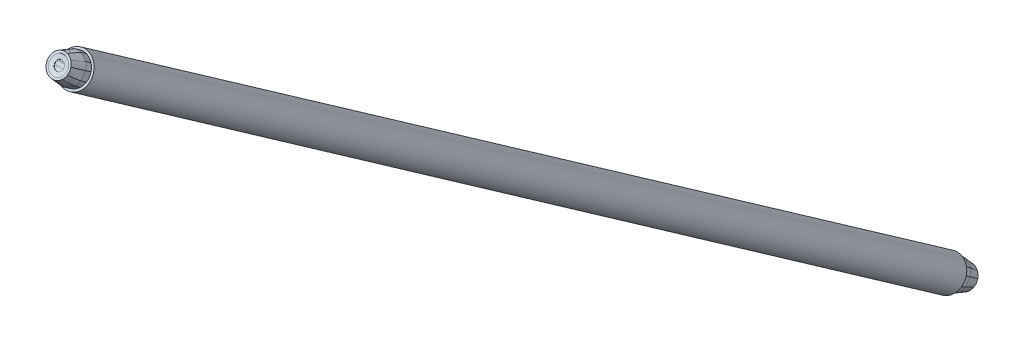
ISO-10303-21;
HEADER;
FILE_DESCRIPTION(('STEP AP214'),'2;1');
FILE_NAME('part.step','',(''),(''),'','','');
FILE_SCHEMA(('AUTOMOTIVE_DESIGN { 1 0 10303 214 1 1 1 1 }'));
ENDSEC;
DATA;
#1=APPLICATION_CONTEXT('core data for automotive mechanical design processes');
#2=APPLICATION_PROTOCOL_DEFINITION('international standard','automotive_design',2000,#1);
#3=PRODUCT_CONTEXT('',#1,'mechanical');
#4=PRODUCT('Part','Part','',(#3));
#5=PRODUCT_RELATED_PRODUCT_CATEGORY('part','',(#4));
#6=PRODUCT_DEFINITION_FORMATION('','',#4);
#7=PRODUCT_DEFINITION_CONTEXT('part definition',#1,'design');
#8=PRODUCT_DEFINITION('design','',#6,#7);
#9=PRODUCT_DEFINITION_SHAPE('','',#8);
#10=(LENGTH_UNIT() NAMED_UNIT(*) SI_UNIT(.MILLI.,.METRE.));
#11=(NAMED_UNIT(*) PLANE_ANGLE_UNIT() SI_UNIT($,.RADIAN.));
#12=(NAMED_UNIT(*) SI_UNIT($,.STERADIAN.) SOLID_ANGLE_UNIT());
#13=UNCERTAINTY_MEASURE_WITH_UNIT(LENGTH_MEASURE(1.E-05),#10,'distance_accuracy_value','');
#14=(GEOMETRIC_REPRESENTATION_CONTEXT(3) GLOBAL_UNCERTAINTY_ASSIGNED_CONTEXT((#13)) GLOBAL_UNIT_ASSIGNED_CONTEXT((#10,
#11,#12)) REPRESENTATION_CONTEXT('',''));
#15=CARTESIAN_POINT('',(0.,0.,0.));
#16=DIRECTION('',(0.,0.,1.));
#17=DIRECTION('',(1.,0.,0.));
#18=AXIS2_PLACEMENT_3D('',#15,#16,#17);
#19=CARTESIAN_POINT('',(-15.8255464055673,10.614087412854,162.067446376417));
#20=DIRECTION('',(0.,0.574518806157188,0.818491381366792));
#21=DIRECTION('',(0.,-0.818491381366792,0.574518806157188));
#22=AXIS2_PLACEMENT_3D('',#19,#20,#21);
#23=PLANE('',#22);
#24=CARTESIAN_POINT('',(-17.442816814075,23.8761400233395,152.758492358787));
#25=DIRECTION('',(0.,0.574518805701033,0.818491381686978));
#26=DIRECTION('',(0.,-0.818491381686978,0.574518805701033));
#27=AXIS2_PLACEMENT_3D('',#24,#25,#26);
#28=CIRCLE('',#27,0.999999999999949);
#29=CARTESIAN_POINT('',(-17.442816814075,23.0576486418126,153.333011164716));
#30=VERTEX_POINT('',#29);
#31=EDGE_CURVE('P0_E35',#30,#30,#28,.T.);
#32=ORIENTED_EDGE('',*,*,#31,.F.);
#33=EDGE_LOOP('',(#32));
#34=FACE_BOUND('',#33,.T.);
#35=ADVANCED_FACE('P0_F16',(#34),#23,.F.);
#36=CARTESIAN_POINT('',(-17.442816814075,23.7037843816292,152.512944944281));
#37=DIRECTION('',(0.,0.574518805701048,0.818491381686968));
#38=DIRECTION('',(0.,-0.818491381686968,0.574518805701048));
#39=AXIS2_PLACEMENT_3D('',#36,#37,#38);
#40=CYLINDRICAL_SURFACE('',#39,0.999999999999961);
#41=ORIENTED_EDGE('',*,*,#31,.T.);
#42=EDGE_LOOP('',(#41));
#43=FACE_BOUND('',#42,.T.);
#44=CARTESIAN_POINT('',(-17.442816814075,23.8306183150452,152.693639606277));
#45=DIRECTION('',(0.,0.574518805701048,0.818491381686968));
#46=DIRECTION('',(0.,-0.818491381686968,0.574518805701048));
#47=AXIS2_PLACEMENT_3D('',#44,#45,#46);
#48=CIRCLE('',#47,0.999999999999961);
#49=CARTESIAN_POINT('',(-17.442816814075,23.0121269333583,153.268158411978));
#50=VERTEX_POINT('',#49);
#51=EDGE_CURVE('P0_E285',#50,#50,#48,.T.);
#52=ORIENTED_EDGE('',*,*,#51,.F.);
#53=EDGE_LOOP('',(#52));
#54=FACE_BOUND('',#53,.T.);
#55=ADVANCED_FACE('P0_F433',(#43,#54),#40,.F.);
#56=CARTESIAN_POINT('',(-19.5615583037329,23.6121301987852,156.242559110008));
#57=CARTESIAN_POINT('',(-18.8619035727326,23.2815040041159,156.474633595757));
#58=CARTESIAN_POINT('',(-18.1622488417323,22.9508778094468,156.706708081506));
#59=CARTESIAN_POINT('',(-19.4047305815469,23.1667316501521,155.33343511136));
#60=CARTESIAN_POINT('',(-18.7914842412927,22.8593050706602,155.631421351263));
#61=CARTESIAN_POINT('',(-18.1213767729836,22.6016204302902,155.840937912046));
#62=CARTESIAN_POINT('',(-19.2479028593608,22.7213331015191,154.424311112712));
#63=CARTESIAN_POINT('',(-18.7161624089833,22.4077132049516,154.72950578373));
#64=CARTESIAN_POINT('',(-18.0766206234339,22.2191730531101,154.892893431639));
#65=CARTESIAN_POINT('',(-19.0910751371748,22.275934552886,153.515187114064));
#66=CARTESIAN_POINT('',(-18.6354076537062,21.9235482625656,153.762535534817));
#67=CARTESIAN_POINT('',(-18.027399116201,21.7985685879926,153.850261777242));
#68=(BOUNDED_SURFACE() B_SPLINE_SURFACE(3,2,((#56,#57,#58),(#59,#60,#61),(#62,#63,#64),(#65,#66,
#67)),.UNSPECIFIED.,.F.,.F.,.F.) B_SPLINE_SURFACE_WITH_KNOTS((4,4),(3,3),(0.,3.08825435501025),
(31.7031388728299,33.3189222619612),
.UNSPECIFIED.) GEOMETRIC_REPRESENTATION_ITEM() RATIONAL_B_SPLINE_SURFACE(((1.,1.,1.),(1.,
0.967456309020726,0.956608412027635),(1.,0.934912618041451,0.913216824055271),(1.,
0.902368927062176,0.869825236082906))) REPRESENTATION_ITEM('') SURFACE());
#69=CARTESIAN_POINT('',(-19.0910751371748,22.275934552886,153.515187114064));
#70=CARTESIAN_POINT('',(-19.0419065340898,22.2379022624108,153.541882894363));
#71=CARTESIAN_POINT('',(-18.9907643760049,22.2015807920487,153.567377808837));
#72=CARTESIAN_POINT('',(-18.8849252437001,22.1326029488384,153.615795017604));
#73=CARTESIAN_POINT('',(-18.8302287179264,22.0999461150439,153.638717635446));
#74=CARTESIAN_POINT('',(-18.7178881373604,22.0386554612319,153.681739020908));
#75=CARTESIAN_POINT('',(-18.6602568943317,22.0100059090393,153.70184883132));
#76=CARTESIAN_POINT('',(-18.5422544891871,21.9567748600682,153.739212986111));
#77=CARTESIAN_POINT('',(-18.4818832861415,21.9321934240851,153.756467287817));
#78=CARTESIAN_POINT('',(-18.3569951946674,21.8866067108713,153.788465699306));
#79=CARTESIAN_POINT('',(-18.2924083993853,21.8657296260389,153.803119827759));
#80=CARTESIAN_POINT('',(-18.161260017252,21.8286235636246,153.829165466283));
#81=CARTESIAN_POINT('',(-18.0946981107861,21.8123953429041,153.840556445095));
#82=CARTESIAN_POINT('',(-18.027399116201,21.7985685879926,153.850261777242));
#83=B_SPLINE_CURVE_WITH_KNOTS('',3,(#69,#70,#71,#72,#73,#74,#75,#76,#77,#78,#79,#80,#81,#82),
.UNSPECIFIED.,.F.,.F.,(4,2,2,2,2,2,4),(0.,0.202891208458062,0.405756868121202,0.607802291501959,
0.809850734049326,1.01791194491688,1.22600701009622),.UNSPECIFIED.);
#84=CARTESIAN_POINT('',(-19.0910751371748,22.275934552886,153.515187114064));
#85=VERTEX_POINT('',#84);
#86=CARTESIAN_POINT('',(-18.027399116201,21.7985685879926,153.850261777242));
#87=VERTEX_POINT('',#86);
#88=EDGE_CURVE('P0_E19',#85,#87,#83,.T.);
#89=DIRECTION('',(0.0437388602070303,-0.37375450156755,-0.926495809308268));
#90=VECTOR('',#89,1.);
#91=CARTESIAN_POINT('',(-18.0995180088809,22.4148343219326,155.377915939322));
#92=LINE('',#91,#90);
#93=CARTESIAN_POINT('',(-18.1622488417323,22.9508778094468,156.706708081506));
#94=VERTEX_POINT('',#93);
#95=EDGE_CURVE('P0_E275',#94,#87,#92,.T.);
#96=DIRECTION('',(-0.866025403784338,0.409245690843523,-0.287259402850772));
#97=VECTOR('',#96,1.);
#98=CARTESIAN_POINT('',(-18.8619035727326,23.281504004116,156.474633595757));
#99=LINE('',#98,#97);
#100=CARTESIAN_POINT('',(-19.561558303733,23.6121301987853,156.242559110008));
#101=VERTEX_POINT('',#100);
#102=EDGE_CURVE('P0_E299',#94,#101,#99,.T.);
#103=DIRECTION('',(-0.153086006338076,0.434771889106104,0.887433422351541));
#104=VECTOR('',#103,1.);
#105=CARTESIAN_POINT('',(-19.3263167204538,22.9440323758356,154.878873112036));
#106=LINE('',#105,#104);
#107=EDGE_CURVE('P0_E279',#85,#101,#106,.T.);
#108=ORIENTED_EDGE('',*,*,#88,.T.);
#109=ORIENTED_EDGE('',*,*,#95,.F.);
#110=ORIENTED_EDGE('',*,*,#102,.T.);
#111=ORIENTED_EDGE('',*,*,#107,.F.);
#112=EDGE_LOOP('',(#108,#109,#110,#111));
#113=FACE_BOUND('',#112,.T.);
#114=ADVANCED_FACE('P0_F418',(#113),#68,.T.);
#115=CARTESIAN_POINT('',(-15.1822488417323,27.1755304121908,153.741322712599));
#116=CARTESIAN_POINT('',(-15.2531620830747,27.2090409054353,153.717800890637));
#117=CARTESIAN_POINT('',(-15.324075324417,27.2425513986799,153.694279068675));
#118=CARTESIAN_POINT('',(-15.3566797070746,26.4810160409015,153.022734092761));
#119=CARTESIAN_POINT('',(-15.4184954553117,26.5103767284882,152.994536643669));
#120=CARTESIAN_POINT('',(-15.4809030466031,26.5389123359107,152.96642030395));
#121=CARTESIAN_POINT('',(-15.5333629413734,25.7775336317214,152.294866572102));
#122=CARTESIAN_POINT('',(-15.5849267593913,25.8070729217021,152.266469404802));
#123=CARTESIAN_POINT('',(-15.6377307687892,25.8352732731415,152.238561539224));
#124=CARTESIAN_POINT('',(-15.7123424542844,25.0649083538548,151.55753925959));
#125=CARTESIAN_POINT('',(-15.752466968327,25.0990831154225,151.5335511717));
#126=CARTESIAN_POINT('',(-15.7945584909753,25.1316342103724,151.510702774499));
#127=(BOUNDED_SURFACE() B_SPLINE_SURFACE(3,2,((#115,#116,#117),(#118,#119,#120),(#121,#122,
#123),(#124,#125,#126)),.UNSPECIFIED.,.F.,.F.,.F.) B_SPLINE_SURFACE_WITH_KNOTS((4,4),(3,3),(0.,
3.08825435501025),(21.8446714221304,22.0084385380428),
.UNSPECIFIED.) GEOMETRIC_REPRESENTATION_ITEM() RATIONAL_B_SPLINE_SURFACE(((1.,1.,1.),
(0.993625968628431,0.996701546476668,1.),(0.987251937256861,0.993403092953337,1.),
(0.980877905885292,0.990104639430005,1.))) REPRESENTATION_ITEM('') SURFACE());
#128=CARTESIAN_POINT('',(-15.7123424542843,25.0649083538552,151.55753925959));
#129=CARTESIAN_POINT('',(-15.7217991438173,25.072962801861,151.551885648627));
#130=CARTESIAN_POINT('',(-15.7313397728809,25.0809511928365,151.546278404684));
#131=CARTESIAN_POINT('',(-15.749757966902,25.0961119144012,151.535636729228));
#132=CARTESIAN_POINT('',(-15.7586219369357,25.1032953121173,151.530594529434));
#133=CARTESIAN_POINT('',(-15.7764878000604,25.1175498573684,151.520588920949));
#134=CARTESIAN_POINT('',(-15.7854897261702,25.1246209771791,151.515625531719));
#135=CARTESIAN_POINT('',(-15.7945584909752,25.1316342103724,151.510702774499));
#136=B_SPLINE_CURVE_WITH_KNOTS('',3,(#128,#129,#130,#131,#132,#133,#134,#135),.UNSPECIFIED.,.F.,
.F.,(4,2,2,4),(0.,0.040943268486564,0.0783630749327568,0.11579198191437),.UNSPECIFIED.);
#137=CARTESIAN_POINT('',(-15.7123424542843,25.0649083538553,151.55753925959));
#138=VERTEX_POINT('',#137);
#139=CARTESIAN_POINT('',(-15.7945584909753,25.1316342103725,151.510702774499));
#140=VERTEX_POINT('',#139);
#141=EDGE_CURVE('P0_E295',#138,#140,#136,.T.);
#142=DIRECTION('',(-0.153086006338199,-0.686851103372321,-0.710492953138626));
#143=VECTOR('',#142,1.);
#144=CARTESIAN_POINT('',(-15.5593169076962,26.1870928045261,152.602490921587));
#145=LINE('',#144,#143);
#146=CARTESIAN_POINT('',(-15.3240753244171,27.24255139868,153.694279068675));
#147=VERTEX_POINT('',#146);
#148=EDGE_CURVE('P0_E294',#147,#140,#145,.T.);
#149=DIRECTION('',(0.866025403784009,-0.409245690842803,0.28725940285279));
#150=VECTOR('',#149,1.);
#151=CARTESIAN_POINT('',(-15.2531620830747,27.2090409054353,153.717800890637));
#152=LINE('',#151,#150);
#153=CARTESIAN_POINT('',(-15.1822488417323,27.1755304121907,153.741322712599));
#154=VERTEX_POINT('',#153);
#155=EDGE_CURVE('P0_E296',#147,#154,#152,.T.);
#156=DIRECTION('',(0.171943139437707,0.684609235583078,0.708340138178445));
#157=VECTOR('',#156,1.);
#158=CARTESIAN_POINT('',(-15.4447370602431,26.1304066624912,152.659971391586));
#159=LINE('',#158,#157);
#160=EDGE_CURVE('P0_E268',#138,#154,#159,.T.);
#161=ORIENTED_EDGE('',*,*,#141,.T.);
#162=ORIENTED_EDGE('',*,*,#148,.F.);
#163=ORIENTED_EDGE('',*,*,#155,.T.);
#164=ORIENTED_EDGE('',*,*,#160,.F.);
#165=EDGE_LOOP('',(#161,#162,#163,#164));
#166=FACE_BOUND('',#165,.T.);
#167=ADVANCED_FACE('P0_F412',(#166),#127,.T.);
#168=CARTESIAN_POINT('',(-15.324075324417,27.2425513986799,153.694279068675));
#169=CARTESIAN_POINT('',(-16.0237300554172,27.573177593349,153.462204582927));
#170=CARTESIAN_POINT('',(-16.7233847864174,27.9038037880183,153.230130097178));
#171=CARTESIAN_POINT('',(-15.4809030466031,26.5389123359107,152.96642030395));
#172=CARTESIAN_POINT('',(-16.0941493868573,26.9236425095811,152.778565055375));
#173=CARTESIAN_POINT('',(-16.7642568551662,27.2082638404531,152.607423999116));
#174=CARTESIAN_POINT('',(-15.6377307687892,25.8352732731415,152.238561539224));
#175=CARTESIAN_POINT('',(-16.1694712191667,26.2288876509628,152.047331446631));
#176=CARTESIAN_POINT('',(-16.8090130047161,26.4466265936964,151.925542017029));
#177=CARTESIAN_POINT('',(-15.7945584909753,25.1316342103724,151.510702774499));
#178=CARTESIAN_POINT('',(-16.250225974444,25.4840205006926,151.263354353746));
#179=CARTESIAN_POINT('',(-16.8582345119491,25.6090001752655,151.175628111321));
#180=(BOUNDED_SURFACE() B_SPLINE_SURFACE(3,2,((#168,#169,#170),(#171,#172,#173),(#174,#175,
#176),(#177,#178,#179)),.UNSPECIFIED.,.F.,.F.,.F.) B_SPLINE_SURFACE_WITH_KNOTS((4,4),(3,3),(0.,
3.08825435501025),(22.0084385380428,23.624221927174),
.UNSPECIFIED.) GEOMETRIC_REPRESENTATION_ITEM() RATIONAL_B_SPLINE_SURFACE(((1.,1.,1.),(1.,
0.967456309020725,0.956608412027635),(1.,0.934912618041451,0.913216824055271),(1.,
0.902368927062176,0.869825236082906))) REPRESENTATION_ITEM('') SURFACE());
#181=CARTESIAN_POINT('',(-15.7945584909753,25.1316342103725,151.510702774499));
#182=CARTESIAN_POINT('',(-15.8437270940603,25.1696665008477,151.4840069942));
#183=CARTESIAN_POINT('',(-15.8948692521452,25.2059879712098,151.458512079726));
#184=CARTESIAN_POINT('',(-16.00070838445,25.27496581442,151.41009487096));
#185=CARTESIAN_POINT('',(-16.0554049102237,25.3076226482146,151.387172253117));
#186=CARTESIAN_POINT('',(-16.1677454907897,25.3689133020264,151.344150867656));
#187=CARTESIAN_POINT('',(-16.2253767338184,25.3975628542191,151.324041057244));
#188=CARTESIAN_POINT('',(-16.343379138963,25.4507939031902,151.286676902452));
#189=CARTESIAN_POINT('',(-16.4037503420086,25.4753753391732,151.269422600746));
#190=CARTESIAN_POINT('',(-16.5286384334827,25.520962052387,151.237424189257));
#191=CARTESIAN_POINT('',(-16.5932252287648,25.5418391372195,151.222770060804));
#192=CARTESIAN_POINT('',(-16.7243736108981,25.5789451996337,151.19672442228));
#193=CARTESIAN_POINT('',(-16.790935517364,25.5951734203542,151.185333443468));
#194=CARTESIAN_POINT('',(-16.8582345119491,25.6090001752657,151.175628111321));
#195=B_SPLINE_CURVE_WITH_KNOTS('',3,(#181,#182,#183,#184,#185,#186,#187,#188,#189,#190,#191,
#192,#193,#194),.UNSPECIFIED.,.F.,.F.,(4,2,2,2,2,2,4),(0.,0.202891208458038,0.405756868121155,
0.607802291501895,0.809850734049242,1.01791194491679,1.22600701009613),.UNSPECIFIED.);
#196=CARTESIAN_POINT('',(-16.8582345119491,25.6090001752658,151.175628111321));
#197=VERTEX_POINT('',#196);
#198=EDGE_CURVE('P0_E304',#140,#197,#195,.T.);
#199=DIRECTION('',(-0.0437388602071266,-0.744325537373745,-0.666383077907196));
#200=VECTOR('',#199,1.);
#201=CARTESIAN_POINT('',(-16.7861156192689,26.8362825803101,152.274394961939));
#202=LINE('',#201,#200);
#203=CARTESIAN_POINT('',(-16.7233847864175,27.9038037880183,153.230130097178));
#204=VERTEX_POINT('',#203);
#205=EDGE_CURVE('P0_E264',#204,#197,#202,.T.);
#206=DIRECTION('',(0.866025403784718,-0.409245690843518,0.287259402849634));
#207=VECTOR('',#206,1.);
#208=CARTESIAN_POINT('',(-16.0237300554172,27.5731775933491,153.462204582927));
#209=LINE('',#208,#207);
#210=EDGE_CURVE('P0_E132',#204,#147,#209,.T.);
#211=ORIENTED_EDGE('',*,*,#198,.T.);
#212=ORIENTED_EDGE('',*,*,#205,.F.);
#213=ORIENTED_EDGE('',*,*,#210,.T.);
#214=ORIENTED_EDGE('',*,*,#148,.T.);
#215=EDGE_LOOP('',(#211,#212,#213,#214));
#216=FACE_BOUND('',#215,.T.);
#217=ADVANCED_FACE('P0_F417',(#216),#180,.T.);
#218=CARTESIAN_POINT('',(-17.4428168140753,20.2279456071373,147.561072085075));
#219=DIRECTION('',(0.,-0.818491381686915,0.574518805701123));
#220=DIRECTION('',(0.,0.574518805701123,0.818491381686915));
#221=AXIS2_PLACEMENT_3D('',#218,#219,#220);
#222=SPHERICAL_SURFACE('',#221,6.35000000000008);
#223=CARTESIAN_POINT('',(-17.4428168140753,20.2279456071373,147.561072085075));
#224=DIRECTION('',(0.,0.574518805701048,0.818491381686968));
#225=DIRECTION('',(0.,-0.818491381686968,0.574518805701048));
#226=AXIS2_PLACEMENT_3D('',#223,#224,#225);
#227=SPHERICAL_SURFACE('',#226,6.35000000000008);
#228=ORIENTED_EDGE('',*,*,#51,.T.);
#229=EDGE_LOOP('',(#228));
#230=FACE_BOUND('',#229,.T.);
#231=CARTESIAN_POINT('',(-17.4428168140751,23.7037843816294,152.512944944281));
#232=DIRECTION('',(0.,-0.574518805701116,-0.81849138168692));
#233=DIRECTION('',(0.,0.81849138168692,-0.574518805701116));
#234=AXIS2_PLACEMENT_3D('',#231,#232,#233);
#235=CIRCLE('',#234,1.92873015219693);
#236=CARTESIAN_POINT('',(-17.4428168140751,25.2824333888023,151.404853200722));
#237=VERTEX_POINT('',#236);
#238=EDGE_CURVE('P0_E259',#237,#237,#235,.F.);
#239=ORIENTED_EDGE('',*,*,#238,.F.);
#240=EDGE_LOOP('',(#239));
#241=FACE_BOUND('',#240,.T.);
#242=ADVANCED_FACE('P0_F464',(#230,#241),#227,.F.);
#243=CARTESIAN_POINT('',(-19.7033847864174,23.6791511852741,156.195515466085));
#244=CARTESIAN_POINT('',(-19.6324715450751,23.6456406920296,156.219037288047));
#245=CARTESIAN_POINT('',(-19.5615583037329,23.6121301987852,156.242559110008));
#246=CARTESIAN_POINT('',(-19.5289539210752,23.2393699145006,155.298123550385));
#247=CARTESIAN_POINT('',(-19.4671381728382,23.2028724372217,155.316153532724));
#248=CARTESIAN_POINT('',(-19.4047305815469,23.1667316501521,155.33343511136));
#249=CARTESIAN_POINT('',(-19.3522706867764,22.793909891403,154.389143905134));
#250=CARTESIAN_POINT('',(-19.3007068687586,22.7571638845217,154.407273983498));
#251=CARTESIAN_POINT('',(-19.2479028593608,22.7213331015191,154.424311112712));
#252=CARTESIAN_POINT('',(-19.1732911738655,22.3426604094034,153.468350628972));
#253=CARTESIAN_POINT('',(-19.1331666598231,22.3084856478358,153.492338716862));
#254=CARTESIAN_POINT('',(-19.0910751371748,22.275934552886,153.515187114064));
#255=(BOUNDED_SURFACE() B_SPLINE_SURFACE(3,2,((#243,#244,#245),(#246,#247,#248),(#249,#250,
#251),(#252,#253,#254)),.UNSPECIFIED.,.F.,.F.,.F.) B_SPLINE_SURFACE_WITH_KNOTS((4,4),(3,3),(0.,
3.08825435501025),(31.5393717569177,31.7031388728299),
.UNSPECIFIED.) GEOMETRIC_REPRESENTATION_ITEM() RATIONAL_B_SPLINE_SURFACE(((1.,1.,1.),
(0.993625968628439,0.996701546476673,1.),(0.987251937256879,0.993403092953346,1.),
(0.980877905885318,0.990104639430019,1.))) REPRESENTATION_ITEM('') SURFACE());
#256=CARTESIAN_POINT('',(-19.0910751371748,22.275934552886,153.515187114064));
#257=CARTESIAN_POINT('',(-19.1009954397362,22.2836063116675,153.50980212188));
#258=CARTESIAN_POINT('',(-19.1108357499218,22.2913473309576,153.504368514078));
#259=CARTESIAN_POINT('',(-19.1295137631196,22.306293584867,153.493877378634));
#260=CARTESIAN_POINT('',(-19.1383648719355,22.3134875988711,153.488827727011));
#261=CARTESIAN_POINT('',(-19.1559311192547,22.3279894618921,153.478648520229));
#262=CARTESIAN_POINT('',(-19.1646462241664,22.3352973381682,153.473518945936));
#263=CARTESIAN_POINT('',(-19.1732911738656,22.3426604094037,153.468350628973));
#264=B_SPLINE_CURVE_WITH_KNOTS('',3,(#256,#257,#258,#259,#260,#261,#262,#263),.UNSPECIFIED.,.F.,
.F.,(4,2,2,4),(0.,0.040943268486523,0.0783630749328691,0.115791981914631),.UNSPECIFIED.);
#265=CARTESIAN_POINT('',(-19.1732911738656,22.3426604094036,153.468350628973));
#266=VERTEX_POINT('',#265);
#267=EDGE_CURVE('P0_E384',#85,#266,#264,.T.);
#268=DIRECTION('',(-0.866025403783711,0.409245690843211,-0.287259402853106));
#269=VECTOR('',#268,1.);
#270=CARTESIAN_POINT('',(-19.6324715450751,23.6456406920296,156.219037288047));
#271=LINE('',#270,#269);
#272=CARTESIAN_POINT('',(-19.7033847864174,23.6791511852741,156.195515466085));
#273=VERTEX_POINT('',#272);
#274=EDGE_CURVE('P0_E282',#101,#273,#271,.T.);
#275=DIRECTION('',(-0.171943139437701,0.433509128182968,0.884593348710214));
#276=VECTOR('',#275,1.);
#277=CARTESIAN_POINT('',(-19.4408965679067,23.0173565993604,154.845096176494));
#278=LINE('',#277,#276);
#279=EDGE_CURVE('P0_E251',#266,#273,#278,.T.);
#280=ORIENTED_EDGE('',*,*,#267,.F.);
#281=ORIENTED_EDGE('',*,*,#107,.T.);
#282=ORIENTED_EDGE('',*,*,#274,.T.);
#283=ORIENTED_EDGE('',*,*,#279,.F.);
#284=EDGE_LOOP('',(#280,#281,#282,#283));
#285=FACE_BOUND('',#284,.T.);
#286=ADVANCED_FACE('P0_F466',(#285),#255,.T.);
#287=CARTESIAN_POINT('',(-18.1622488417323,22.9508778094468,156.706708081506));
#288=CARTESIAN_POINT('',(-17.442816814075,22.8108623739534,156.804988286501));
#289=CARTESIAN_POINT('',(-16.7233847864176,22.9508778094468,156.706708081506));
#290=CARTESIAN_POINT('',(-18.1213767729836,22.6016204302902,155.840937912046));
#291=CARTESIAN_POINT('',(-17.4422239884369,22.4691007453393,155.939137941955));
#292=CARTESIAN_POINT('',(-16.7629475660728,22.6035126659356,155.844897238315));
#293=CARTESIAN_POINT('',(-18.0766206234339,22.2191730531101,154.892893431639));
#294=CARTESIAN_POINT('',(-17.4415720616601,22.0932675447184,154.986967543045));
#295=CARTESIAN_POINT('',(-16.8064583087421,22.2214840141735,154.897086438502));
#296=CARTESIAN_POINT('',(-18.027399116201,21.7985685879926,153.850261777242));
#297=CARTESIAN_POINT('',(-17.4408517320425,21.6780003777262,153.934891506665));
#298=CARTESIAN_POINT('',(-16.8545389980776,21.7993307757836,153.849726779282));
#299=(BOUNDED_SURFACE() B_SPLINE_SURFACE(3,2,((#287,#288,#289),(#290,#291,#292),(#293,#294,
#295),(#296,#297,#298)),.UNSPECIFIED.,.F.,.F.,.F.) B_SPLINE_SURFACE_WITH_KNOTS((4,4),(3,3),(0.,
3.08825435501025),(33.3189222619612,34.7709385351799),
.UNSPECIFIED.) GEOMETRIC_REPRESENTATION_ITEM() RATIONAL_B_SPLINE_SURFACE(((1.,0.972875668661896,
1.),(0.956608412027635,0.928777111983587,0.954632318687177),(0.913216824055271,
0.884678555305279,0.909264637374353),(0.869825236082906,0.84057999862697,0.86389695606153))) REPRESENTATION_ITEM('') SURFACE());
#300=CARTESIAN_POINT('',(-16.8545389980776,21.7993307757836,153.849726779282));
#301=CARTESIAN_POINT('',(-16.9145220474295,21.7869139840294,153.858442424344));
#302=CARTESIAN_POINT('',(-16.9750912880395,21.776403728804,153.865819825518));
#303=CARTESIAN_POINT('',(-17.0970414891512,21.7592408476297,153.877866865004));
#304=CARTESIAN_POINT('',(-17.1584224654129,21.7525882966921,153.882536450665));
#305=CARTESIAN_POINT('',(-17.2865576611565,21.7428100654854,153.889400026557));
#306=CARTESIAN_POINT('',(-17.3533491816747,21.7400088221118,153.89136628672));
#307=CARTESIAN_POINT('',(-17.4869873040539,21.7389762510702,153.892091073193));
#308=CARTESIAN_POINT('',(-17.5538339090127,21.7407452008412,153.890849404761));
#309=CARTESIAN_POINT('',(-17.6890651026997,21.7489621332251,153.885081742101));
#310=CARTESIAN_POINT('',(-17.757437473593,21.7555454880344,153.880460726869));
#311=CARTESIAN_POINT('',(-17.893247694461,21.7734883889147,153.867866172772));
#312=CARTESIAN_POINT('',(-17.9606854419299,21.7848484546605,153.859892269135));
#313=CARTESIAN_POINT('',(-18.0273991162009,21.7985685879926,153.850261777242));
#314=B_SPLINE_CURVE_WITH_KNOTS('',3,(#300,#301,#302,#303,#304,#305,#306,#307,#308,#309,#310,
#311,#312,#313),.UNSPECIFIED.,.F.,.F.,(4,2,2,2,2,2,4),(0.,0.185563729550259,0.371131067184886,
0.571532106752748,0.771945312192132,0.978221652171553,1.18452043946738),.UNSPECIFIED.);
#315=CARTESIAN_POINT('',(-16.8545389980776,21.7993307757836,153.849726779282));
#316=VERTEX_POINT('',#315);
#317=EDGE_CURVE('P0_E391',#316,#87,#314,.T.);
#318=DIRECTION('',(-0.0425394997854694,-0.373501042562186,-0.926653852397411));
#319=VECTOR('',#318,1.);
#320=CARTESIAN_POINT('',(-16.7841734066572,22.4171476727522,155.38252680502));
#321=LINE('',#320,#319);
#322=CARTESIAN_POINT('',(-16.7233847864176,22.9508778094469,156.706708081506));
#323=VERTEX_POINT('',#322);
#324=EDGE_CURVE('P0_E247',#323,#316,#321,.T.);
#325=CARTESIAN_POINT('',(-17.4428168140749,25.4273407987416,154.968419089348));
#326=DIRECTION('',(0.,-0.574518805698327,-0.818491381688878));
#327=DIRECTION('',(0.,0.818491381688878,-0.574518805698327));
#328=AXIS2_PLACEMENT_3D('',#325,#326,#327);
#329=CIRCLE('',#328,3.11000000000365);
#330=EDGE_CURVE('P0_E276',#323,#94,#329,.T.);
#331=ORIENTED_EDGE('',*,*,#317,.F.);
#332=ORIENTED_EDGE('',*,*,#324,.F.);
#333=ORIENTED_EDGE('',*,*,#330,.T.);
#334=ORIENTED_EDGE('',*,*,#95,.T.);
#335=EDGE_LOOP('',(#331,#332,#333,#334));
#336=FACE_BOUND('',#335,.T.);
#337=ADVANCED_FACE('P0_F524',(#336),#299,.T.);
#338=CARTESIAN_POINT('',(-15.1822488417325,23.679151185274,156.195515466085));
#339=CARTESIAN_POINT('',(-14.6743859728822,24.1191015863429,155.886703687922));
#340=CARTESIAN_POINT('',(-14.462816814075,24.699067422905,155.479611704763));
#341=CARTESIAN_POINT('',(-15.3542749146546,23.2376671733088,155.283643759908));
#342=CARTESIAN_POINT('',(-14.8790674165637,23.6617337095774,155.037802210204));
#343=CARTESIAN_POINT('',(-14.6724741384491,24.2182460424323,154.699738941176));
#344=CARTESIAN_POINT('',(-15.5263009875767,22.7961831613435,154.371772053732));
#345=CARTESIAN_POINT('',(-15.0926185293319,23.1845462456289,154.152114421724));
#346=CARTESIAN_POINT('',(-14.9008439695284,23.6945099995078,153.85026033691));
#347=CARTESIAN_POINT('',(-15.6983270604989,22.3546991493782,153.459900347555));
#348=CARTESIAN_POINT('',(-15.3156286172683,22.6862223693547,153.227196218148));
#349=CARTESIAN_POINT('',(-15.1505485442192,23.1218455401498,152.92142182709));
#350=(BOUNDED_SURFACE() B_SPLINE_SURFACE(3,2,((#338,#339,#340),(#341,#342,#343),(#344,#345,
#346),(#347,#348,#349)),.UNSPECIFIED.,.F.,.F.,.F.) B_SPLINE_SURFACE_WITH_KNOTS((4,4),(3,3),(0.,
3.08825435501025),(17.1610883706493,18.6131046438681),
.UNSPECIFIED.) GEOMETRIC_REPRESENTATION_ITEM() RATIONAL_B_SPLINE_SURFACE(((1.,0.972875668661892,
1.),(1.,0.952671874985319,0.959030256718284),(1.,0.932468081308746,0.918060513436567),(1.,
0.912264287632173,0.877090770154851))) REPRESENTATION_ITEM('') SURFACE());
#351=CARTESIAN_POINT('',(-15.150548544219,23.1218455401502,152.921421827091));
#352=CARTESIAN_POINT('',(-15.1688735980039,23.0734738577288,152.955375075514));
#353=CARTESIAN_POINT('',(-15.1894938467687,23.0256847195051,152.98891942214));
#354=CARTESIAN_POINT('',(-15.2351767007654,22.9315578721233,153.054989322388));
#355=CARTESIAN_POINT('',(-15.2602387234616,22.8852199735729,153.087515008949));
#356=CARTESIAN_POINT('',(-15.3136794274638,22.7959111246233,153.150203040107));
#357=CARTESIAN_POINT('',(-15.3419056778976,22.7528790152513,153.180408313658));
#358=CARTESIAN_POINT('',(-15.4021943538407,22.6686546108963,153.239527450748));
#359=CARTESIAN_POINT('',(-15.4342567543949,22.6274623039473,153.268441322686));
#360=CARTESIAN_POINT('',(-15.5028237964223,22.5462201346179,153.325467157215));
#361=CARTESIAN_POINT('',(-15.5394138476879,22.5062185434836,153.353545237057));
#362=CARTESIAN_POINT('',(-15.6162119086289,22.4286064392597,153.408023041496));
#363=CARTESIAN_POINT('',(-15.656420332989,22.390996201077,153.434422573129));
#364=CARTESIAN_POINT('',(-15.6983270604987,22.3546991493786,153.459900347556));
#365=B_SPLINE_CURVE_WITH_KNOTS('',3,(#351,#352,#353,#354,#355,#356,#357,#358,#359,#360,#361,
#362,#363,#364),.UNSPECIFIED.,.F.,.F.,(4,2,2,2,2,2,4),(0.,0.18557769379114,0.371131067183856,
0.549984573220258,0.72883691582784,0.911814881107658,1.09481384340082),.UNSPECIFIED.);
#366=CARTESIAN_POINT('',(-15.150548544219,23.1218455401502,152.921421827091));
#367=VERTEX_POINT('',#366);
#368=CARTESIAN_POINT('',(-15.6983270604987,22.3546991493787,153.459900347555));
#369=VERTEX_POINT('',#368);
#370=EDGE_CURVE('P0_E263',#367,#369,#365,.T.);
#371=DIRECTION('',(-0.223071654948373,-0.511585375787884,-0.829770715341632));
#372=VECTOR('',#371,1.);
#373=CARTESIAN_POINT('',(-14.7841668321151,23.9620936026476,154.28427008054));
#374=LINE('',#373,#372);
#375=CARTESIAN_POINT('',(-14.462816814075,24.699067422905,155.479611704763));
#376=VERTEX_POINT('',#375);
#377=EDGE_CURVE('P0_E236',#376,#367,#374,.T.);
#378=CARTESIAN_POINT('',(-17.4428168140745,25.4273407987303,154.96841908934));
#379=DIRECTION('',(7.41701202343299E-13,-0.574518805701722,-0.818491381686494));
#380=DIRECTION('',(0.,0.818491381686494,-0.574518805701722));
#381=AXIS2_PLACEMENT_3D('',#378,#379,#380);
#382=CIRCLE('',#381,3.10999999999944);
#383=CARTESIAN_POINT('',(-15.1822488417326,23.6791511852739,156.195515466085));
#384=VERTEX_POINT('',#383);
#385=EDGE_CURVE('P0_E272',#376,#384,#382,.T.);
#386=DIRECTION('',(0.167401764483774,0.429616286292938,0.88735928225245));
#387=VECTOR('',#386,1.);
#388=CARTESIAN_POINT('',(-15.4402879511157,23.0169251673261,154.82770790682));
#389=LINE('',#388,#387);
#390=EDGE_CURVE('P0_E252',#369,#384,#389,.T.);
#391=ORIENTED_EDGE('',*,*,#370,.F.);
#392=ORIENTED_EDGE('',*,*,#377,.F.);
#393=ORIENTED_EDGE('',*,*,#385,.T.);
#394=ORIENTED_EDGE('',*,*,#390,.F.);
#395=EDGE_LOOP('',(#391,#392,#393,#394));
#396=FACE_BOUND('',#395,.T.);
#397=ADVANCED_FACE('P0_F561',(#396),#350,.T.);
#398=CARTESIAN_POINT('',(-14.4628168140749,26.1556141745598,154.457226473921));
#399=CARTESIAN_POINT('',(-14.6743859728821,26.7355800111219,154.050134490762));
#400=CARTESIAN_POINT('',(-15.1822488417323,27.1755304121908,153.741322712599));
#401=CARTESIAN_POINT('',(-14.6716970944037,25.5900018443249,153.743321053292));
#402=CARTESIAN_POINT('',(-14.8786020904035,26.102127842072,153.336403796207));
#403=CARTESIAN_POINT('',(-15.3566797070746,26.4810160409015,153.022734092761));
#404=CARTESIAN_POINT('',(-14.9004273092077,24.9706392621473,152.961573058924));
#405=CARTESIAN_POINT('',(-15.0936966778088,25.4349320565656,152.584653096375));
#406=CARTESIAN_POINT('',(-15.5333629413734,25.7775336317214,152.294866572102));
#407=CARTESIAN_POINT('',(-15.151978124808,24.2894823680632,152.101829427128));
#408=CARTESIAN_POINT('',(-15.3205627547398,24.7312226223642,151.791761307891));
#409=CARTESIAN_POINT('',(-15.7123424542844,25.0649083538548,151.55753925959));
#410=(BOUNDED_SURFACE() B_SPLINE_SURFACE(3,2,((#398,#399,#400),(#401,#402,#403),(#404,#405,
#406),(#407,#408,#409)),.UNSPECIFIED.,.F.,.F.,.F.) B_SPLINE_SURFACE_WITH_KNOTS((4,4),(3,3),(0.,
3.08825435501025),(20.3926551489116,21.8446714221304),
.UNSPECIFIED.) GEOMETRIC_REPRESENTATION_ITEM() RATIONAL_B_SPLINE_SURFACE(((1.,0.972875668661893,
1.),(0.956608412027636,0.948273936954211,0.993625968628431),(0.913216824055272,0.92367220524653,
0.987251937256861),(0.869825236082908,0.899070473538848,0.980877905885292))) REPRESENTATION_ITEM('') SURFACE());
#411=CARTESIAN_POINT('',(-15.7123424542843,25.0649083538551,151.55753925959));
#412=CARTESIAN_POINT('',(-15.6694660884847,25.0283958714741,151.583168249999));
#413=CARTESIAN_POINT('',(-15.6283224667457,24.9905208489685,151.609753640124));
#414=CARTESIAN_POINT('',(-15.5497338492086,24.9122884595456,151.664666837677));
#415=CARTESIAN_POINT('',(-15.5122884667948,24.8719313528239,151.692994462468));
#416=CARTESIAN_POINT('',(-15.4418875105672,24.7896327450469,151.750761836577));
#417=CARTESIAN_POINT('',(-15.4088697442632,24.7477268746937,151.780176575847));
#418=CARTESIAN_POINT('',(-15.3468213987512,24.6619820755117,151.84036291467));
#419=CARTESIAN_POINT('',(-15.3177908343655,24.6181431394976,151.871134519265));
#420=CARTESIAN_POINT('',(-15.2632375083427,24.5277085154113,151.934612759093));
#421=CARTESIAN_POINT('',(-15.2378160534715,24.4810718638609,151.967348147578));
#422=CARTESIAN_POINT('',(-15.1914789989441,24.3863162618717,152.033859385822));
#423=CARTESIAN_POINT('',(-15.170563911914,24.3381971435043,152.067635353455));
#424=CARTESIAN_POINT('',(-15.151978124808,24.2894823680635,152.101829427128));
#425=B_SPLINE_CURVE_WITH_KNOTS('',3,(#411,#412,#413,#414,#415,#416,#417,#418,#419,#420,#421,
#422,#423,#424),.UNSPECIFIED.,.F.,.F.,(4,2,2,2,2,2,4),(0.,0.185575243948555,0.371131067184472,
0.553721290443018,0.736312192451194,0.92330009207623,1.11030925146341),.UNSPECIFIED.);
#426=CARTESIAN_POINT('',(-15.1519781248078,24.2894823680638,152.101829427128));
#427=VERTEX_POINT('',#426);
#428=EDGE_CURVE('P0_E365',#138,#427,#425,.T.);
#429=CARTESIAN_POINT('',(-17.4428168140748,25.4273407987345,154.968419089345));
#430=DIRECTION('',(-8.17301600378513E-13,-0.574518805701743,-0.81849138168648));
#431=DIRECTION('',(0.,0.81849138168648,-0.574518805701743));
#432=AXIS2_PLACEMENT_3D('',#429,#430,#431);
#433=CIRCLE('',#432,3.10999999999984);
#434=CARTESIAN_POINT('',(-14.462816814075,26.1556141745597,154.457226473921));
#435=VERTEX_POINT('',#434);
#436=EDGE_CURVE('P0_E269',#154,#435,#433,.T.);
#437=DIRECTION('',(0.22353126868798,0.605284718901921,0.763979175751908));
#438=VECTOR('',#437,1.);
#439=CARTESIAN_POINT('',(-14.7834082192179,25.2875070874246,153.361517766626));
#440=LINE('',#439,#438);
#441=EDGE_CURVE('P0_E241',#427,#435,#440,.T.);
#442=ORIENTED_EDGE('',*,*,#428,.F.);
#443=ORIENTED_EDGE('',*,*,#160,.T.);
#444=ORIENTED_EDGE('',*,*,#436,.T.);
#445=ORIENTED_EDGE('',*,*,#441,.F.);
#446=EDGE_LOOP('',(#442,#443,#444,#445));
#447=FACE_BOUND('',#446,.T.);
#448=ADVANCED_FACE('P0_F555',(#447),#410,.T.);
#449=CARTESIAN_POINT('',(-16.7233847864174,27.9038037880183,153.230130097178));
#450=CARTESIAN_POINT('',(-17.4428168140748,28.0438192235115,153.131849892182));
#451=CARTESIAN_POINT('',(-18.1622488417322,27.9038037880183,153.230130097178));
#452=CARTESIAN_POINT('',(-16.7642568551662,27.2082638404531,152.607423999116));
#453=CARTESIAN_POINT('',(-17.4434096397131,27.3456563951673,152.516166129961));
#454=CARTESIAN_POINT('',(-18.1226860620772,27.2113444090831,152.610549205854));
#455=CARTESIAN_POINT('',(-16.8090130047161,26.4466265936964,151.925542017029));
#456=CARTESIAN_POINT('',(-17.4440615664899,26.5778909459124,151.839102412));
#457=CARTESIAN_POINT('',(-18.0791753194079,26.4497846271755,151.929140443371));
#458=CARTESIAN_POINT('',(-16.8582345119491,25.6090001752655,151.175628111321));
#459=CARTESIAN_POINT('',(-17.4447818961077,25.7295683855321,151.090998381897));
#460=CARTESIAN_POINT('',(-18.0310946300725,25.6082379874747,151.176163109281));
#461=(BOUNDED_SURFACE() B_SPLINE_SURFACE(3,2,((#449,#450,#451),(#452,#453,#454),(#455,#456,
#457),(#458,#459,#460)),.UNSPECIFIED.,.F.,.F.,.F.) B_SPLINE_SURFACE_WITH_KNOTS((4,4),(3,3),(0.,
3.08825435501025),(23.624221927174,25.0762382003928),
.UNSPECIFIED.) GEOMETRIC_REPRESENTATION_ITEM() RATIONAL_B_SPLINE_SURFACE(((1.,0.972875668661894,
1.),(0.956608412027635,0.928777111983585,0.954632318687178),(0.913216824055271,
0.884678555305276,0.909264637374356),(0.869825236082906,0.840579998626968,0.863896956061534))) REPRESENTATION_ITEM('') SURFACE());
#462=CARTESIAN_POINT('',(-18.0310946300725,25.6082379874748,151.176163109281));
#463=CARTESIAN_POINT('',(-17.9711115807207,25.620654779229,151.167447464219));
#464=CARTESIAN_POINT('',(-17.9105423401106,25.6311650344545,151.160070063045));
#465=CARTESIAN_POINT('',(-17.7885921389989,25.6483279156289,151.148023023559));
#466=CARTESIAN_POINT('',(-17.7272111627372,25.6549804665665,151.143353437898));
#467=CARTESIAN_POINT('',(-17.5990759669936,25.6647586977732,151.136489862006));
#468=CARTESIAN_POINT('',(-17.5322844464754,25.6675599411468,151.134523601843));
#469=CARTESIAN_POINT('',(-17.3986463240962,25.6685925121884,151.13379881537));
#470=CARTESIAN_POINT('',(-17.3317997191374,25.6668235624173,151.135040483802));
#471=CARTESIAN_POINT('',(-17.1965685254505,25.6586066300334,151.140808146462));
#472=CARTESIAN_POINT('',(-17.1281961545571,25.6520232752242,151.145429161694));
#473=CARTESIAN_POINT('',(-16.9923859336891,25.6340803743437,151.158023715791));
#474=CARTESIAN_POINT('',(-16.9249481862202,25.6227203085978,151.165997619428));
#475=CARTESIAN_POINT('',(-16.8582345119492,25.6090001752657,151.175628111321));
#476=B_SPLINE_CURVE_WITH_KNOTS('',3,(#462,#463,#464,#465,#466,#467,#468,#469,#470,#471,#472,
#473,#474,#475),.UNSPECIFIED.,.F.,.F.,(4,2,2,2,2,2,4),(0.,0.185563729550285,0.371131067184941,
0.571532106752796,0.771945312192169,0.978221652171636,1.18452043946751),.UNSPECIFIED.);
#477=CARTESIAN_POINT('',(-18.0310946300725,25.6082379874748,151.176163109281));
#478=VERTEX_POINT('',#477);
#479=EDGE_CURVE('P0_E372',#478,#197,#476,.T.);
#480=DIRECTION('',(0.0425394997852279,-0.744560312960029,-0.666198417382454));
#481=VECTOR('',#480,1.);
#482=CARTESIAN_POINT('',(-18.1014602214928,26.8398327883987,152.278137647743));
#483=LINE('',#482,#481);
#484=CARTESIAN_POINT('',(-18.1622488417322,27.9038037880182,153.230130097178));
#485=VERTEX_POINT('',#484);
#486=EDGE_CURVE('P0_E226',#485,#478,#483,.T.);
#487=CARTESIAN_POINT('',(-17.4428168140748,25.4273407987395,154.968419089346));
#488=DIRECTION('',(0.,-0.57451880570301,-0.81849138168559));
#489=DIRECTION('',(0.,0.81849138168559,-0.57451880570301));
#490=AXIS2_PLACEMENT_3D('',#487,#488,#489);
#491=CIRCLE('',#490,3.10999999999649);
#492=EDGE_CURVE('P0_E265',#485,#204,#491,.T.);
#493=ORIENTED_EDGE('',*,*,#479,.F.);
#494=ORIENTED_EDGE('',*,*,#486,.F.);
#495=ORIENTED_EDGE('',*,*,#492,.T.);
#496=ORIENTED_EDGE('',*,*,#205,.T.);
#497=EDGE_LOOP('',(#493,#494,#495,#496));
#498=FACE_BOUND('',#497,.T.);
#499=ADVANCED_FACE('P0_F573',(#498),#461,.T.);
#500=CARTESIAN_POINT('',(-19.7033847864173,27.1755304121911,153.741322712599));
#501=CARTESIAN_POINT('',(-20.2112476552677,26.7355800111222,154.050134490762));
#502=CARTESIAN_POINT('',(-20.4228168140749,26.1556141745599,154.457226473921));
#503=CARTESIAN_POINT('',(-19.5313587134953,26.4679768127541,153.016211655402));
#504=CARTESIAN_POINT('',(-20.0065662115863,26.0926467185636,153.331485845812));
#505=CARTESIAN_POINT('',(-20.2131594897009,25.5855716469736,153.739980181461));
#506=CARTESIAN_POINT('',(-19.3593326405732,25.7604232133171,152.291100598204));
#507=CARTESIAN_POINT('',(-19.7930150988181,25.4218525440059,152.581695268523));
#508=CARTESIAN_POINT('',(-19.9847896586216,24.964651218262,152.958717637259));
#509=CARTESIAN_POINT('',(-19.1873065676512,25.0528696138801,151.565989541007));
#510=CARTESIAN_POINT('',(-19.5700050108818,24.7213463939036,151.798693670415));
#511=CARTESIAN_POINT('',(-19.7350850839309,24.2857232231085,152.104468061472));
#512=(BOUNDED_SURFACE() B_SPLINE_SURFACE(3,2,((#500,#501,#502),(#503,#504,#505),(#506,#507,
#508),(#509,#510,#511)),.UNSPECIFIED.,.F.,.F.,.F.) B_SPLINE_SURFACE_WITH_KNOTS((4,4),(3,3),(0.,
3.08825435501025),(26.8557887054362,28.3078049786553),
.UNSPECIFIED.) GEOMETRIC_REPRESENTATION_ITEM() RATIONAL_B_SPLINE_SURFACE(((1.,0.972875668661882,
1.),(1.,0.952671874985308,0.95903025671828),(1.,0.932468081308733,0.91806051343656),(1.,
0.912264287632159,0.87709077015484))) REPRESENTATION_ITEM('') SURFACE());
#513=CARTESIAN_POINT('',(-19.735085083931,24.2857232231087,152.104468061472));
#514=CARTESIAN_POINT('',(-19.7167600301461,24.3340949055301,152.070514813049));
#515=CARTESIAN_POINT('',(-19.6961397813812,24.3818840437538,152.036970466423));
#516=CARTESIAN_POINT('',(-19.6504569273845,24.4760108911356,151.970900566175));
#517=CARTESIAN_POINT('',(-19.6253949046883,24.522348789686,151.938374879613));
#518=CARTESIAN_POINT('',(-19.5719542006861,24.6116576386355,151.875686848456));
#519=CARTESIAN_POINT('',(-19.5437279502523,24.6546897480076,151.845481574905));
#520=CARTESIAN_POINT('',(-19.4834392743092,24.7389141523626,151.786362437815));
#521=CARTESIAN_POINT('',(-19.451376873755,24.7801064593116,151.757448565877));
#522=CARTESIAN_POINT('',(-19.3828098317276,24.861348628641,151.700422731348));
#523=CARTESIAN_POINT('',(-19.346219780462,24.9013502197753,151.672344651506));
#524=CARTESIAN_POINT('',(-19.2694217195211,24.9789623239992,151.617866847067));
#525=CARTESIAN_POINT('',(-19.229213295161,25.0165725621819,151.591467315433));
#526=CARTESIAN_POINT('',(-19.1873065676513,25.0528696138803,151.565989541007));
#527=B_SPLINE_CURVE_WITH_KNOTS('',3,(#513,#514,#515,#516,#517,#518,#519,#520,#521,#522,#523,
#524,#525,#526),.UNSPECIFIED.,.F.,.F.,(4,2,2,2,2,2,4),(0.,0.185577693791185,0.371131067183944,
0.549984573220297,0.728836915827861,0.911814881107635,1.09481384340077),.UNSPECIFIED.);
#528=CARTESIAN_POINT('',(-19.735085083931,24.2857232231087,152.104468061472));
#529=VERTEX_POINT('',#528);
#530=CARTESIAN_POINT('',(-19.1873065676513,25.0528696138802,151.565989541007));
#531=VERTEX_POINT('',#530);
#532=EDGE_CURVE('P0_E378',#529,#531,#527,.T.);
#533=DIRECTION('',(0.223071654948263,-0.606515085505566,-0.763137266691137));
#534=VECTOR('',#533,1.);
#535=CARTESIAN_POINT('',(-20.1014667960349,25.2818875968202,153.35787490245));
#536=LINE('',#535,#534);
#537=CARTESIAN_POINT('',(-20.4228168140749,26.1556141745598,154.457226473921));
#538=VERTEX_POINT('',#537);
#539=EDGE_CURVE('P0_E218',#538,#529,#536,.T.);
#540=CARTESIAN_POINT('',(-17.442816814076,25.4273407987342,154.968419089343));
#541=DIRECTION('',(4.39729768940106E-13,-0.574518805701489,-0.818491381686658));
#542=DIRECTION('',(0.,0.818491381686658,-0.574518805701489));
#543=AXIS2_PLACEMENT_3D('',#540,#541,#542);
#544=CIRCLE('',#543,3.10999999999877);
#545=CARTESIAN_POINT('',(-19.7033847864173,27.1755304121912,153.741322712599));
#546=VERTEX_POINT('',#545);
#547=EDGE_CURVE('P0_E260',#538,#546,#544,.T.);
#548=DIRECTION('',(-0.167401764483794,0.688533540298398,0.705619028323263));
#549=VECTOR('',#548,1.);
#550=CARTESIAN_POINT('',(-19.4453456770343,26.1142000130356,152.653656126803));
#551=LINE('',#550,#549);
#552=EDGE_CURVE('P0_E231',#531,#546,#551,.T.);
#553=ORIENTED_EDGE('',*,*,#532,.F.);
#554=ORIENTED_EDGE('',*,*,#539,.F.);
#555=ORIENTED_EDGE('',*,*,#547,.T.);
#556=ORIENTED_EDGE('',*,*,#552,.F.);
#557=EDGE_LOOP('',(#553,#554,#555,#556));
#558=FACE_BOUND('',#557,.T.);
#559=ADVANCED_FACE('P0_F326',(#558),#512,.T.);
#560=CARTESIAN_POINT('',(-19.8908168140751,21.7001174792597,153.919366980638));
#561=DIRECTION('',(0.,-0.574518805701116,-0.81849138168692));
#562=DIRECTION('',(0.,0.81849138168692,-0.574518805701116));
#563=AXIS2_PLACEMENT_3D('',#560,#561,#562);
#564=PLANE('',#563);
#565=ORIENTED_EDGE('',*,*,#238,.T.);
#566=EDGE_LOOP('',(#565));
#567=FACE_BOUND('',#566,.T.);
#568=ORIENTED_EDGE('',*,*,#141,.F.);
#569=ORIENTED_EDGE('',*,*,#428,.T.);
#570=CARTESIAN_POINT('',(-15.150548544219,23.1218455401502,152.921421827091));
#571=CARTESIAN_POINT('',(-15.1284375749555,23.180162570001,152.880487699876));
#572=CARTESIAN_POINT('',(-15.109669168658,23.2393296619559,152.838956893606));
#573=CARTESIAN_POINT('',(-15.0789448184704,23.3587985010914,152.755098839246));
#574=CARTESIAN_POINT('',(-15.0669845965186,23.4190995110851,152.712772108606));
#575=CARTESIAN_POINT('',(-15.0508940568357,23.5337999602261,152.63226110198));
#576=CARTESIAN_POINT('',(-15.0460577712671,23.5881336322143,152.594122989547));
#577=CARTESIAN_POINT('',(-15.0419092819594,23.6969470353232,152.51774424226));
#578=CARTESIAN_POINT('',(-15.0425980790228,23.7514267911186,152.479503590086));
#579=CARTESIAN_POINT('',(-15.051264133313,23.8877171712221,152.383838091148));
#580=CARTESIAN_POINT('',(-15.0627564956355,23.9693936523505,152.326507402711));
#581=CARTESIAN_POINT('',(-15.0981173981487,24.1310683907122,152.213024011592));
#582=CARTESIAN_POINT('',(-15.122006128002,24.211063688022,152.156873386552));
#583=CARTESIAN_POINT('',(-15.1519781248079,24.2894823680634,152.101829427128));
#584=B_SPLINE_CURVE_WITH_KNOTS('',3,(#570,#571,#572,#573,#574,#575,#576,#577,#578,#579,#580,
#581,#582,#583),.UNSPECIFIED.,.F.,.F.,(4,2,2,2,2,2,4),(0.,0.223727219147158,0.447313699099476,
0.646759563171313,0.846241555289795,1.1467673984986,1.44778424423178),.UNSPECIFIED.);
#585=EDGE_CURVE('P0_E239',#367,#427,#584,.T.);
#586=ORIENTED_EDGE('',*,*,#585,.F.);
#587=ORIENTED_EDGE('',*,*,#370,.T.);
#588=CARTESIAN_POINT('',(-16.8545389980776,21.7993307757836,153.849726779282));
#589=CARTESIAN_POINT('',(-16.7822149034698,21.8142878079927,153.839228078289));
#590=CARTESIAN_POINT('',(-16.7107466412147,21.8320227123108,153.826779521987));
#591=CARTESIAN_POINT('',(-16.5701704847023,21.8728440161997,153.798126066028));
#592=CARTESIAN_POINT('',(-16.5010613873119,21.8959276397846,153.781923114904));
#593=CARTESIAN_POINT('',(-16.3730798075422,21.9444868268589,153.747838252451));
#594=CARTESIAN_POINT('',(-16.313907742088,21.9694349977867,153.730326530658));
#595=CARTESIAN_POINT('',(-16.1982949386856,22.0232659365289,153.692541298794));
#596=CARTESIAN_POINT('',(-16.1418544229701,22.0521490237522,153.672267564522));
#597=CARTESIAN_POINT('',(-16.0165775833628,22.122355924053,153.622987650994));
#598=CARTESIAN_POINT('',(-15.9487461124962,22.1648887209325,153.593132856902));
#599=CARTESIAN_POINT('',(-15.8189323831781,22.2556511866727,153.529424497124));
#600=CARTESIAN_POINT('',(-15.7569552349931,22.3038857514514,153.495567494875));
#601=CARTESIAN_POINT('',(-15.6983270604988,22.3546991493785,153.459900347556));
#602=B_SPLINE_CURVE_WITH_KNOTS('',3,(#588,#589,#590,#591,#592,#593,#594,#595,#596,#597,#598,
#599,#600,#601),.UNSPECIFIED.,.F.,.F.,(4,2,2,2,2,2,4),(0.,0.223714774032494,0.447313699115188,
0.646769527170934,0.84624155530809,1.10208860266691,1.35815695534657),.UNSPECIFIED.);
#603=EDGE_CURVE('P0_E250',#316,#369,#602,.T.);
#604=ORIENTED_EDGE('',*,*,#603,.F.);
#605=ORIENTED_EDGE('',*,*,#317,.T.);
#606=ORIENTED_EDGE('',*,*,#88,.F.);
#607=ORIENTED_EDGE('',*,*,#267,.T.);
#608=CARTESIAN_POINT('',(-19.733655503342,23.1180863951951,152.924060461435));
#609=CARTESIAN_POINT('',(-19.7152121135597,23.0697452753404,152.957992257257));
#610=CARTESIAN_POINT('',(-19.6944752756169,23.0219907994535,152.991512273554));
#611=CARTESIAN_POINT('',(-19.6485623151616,22.9279392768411,153.057529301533));
#612=CARTESIAN_POINT('',(-19.6233866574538,22.8816420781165,153.090026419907));
#613=CARTESIAN_POINT('',(-19.5691764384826,22.7915051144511,153.15329572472));
#614=CARTESIAN_POINT('',(-19.5402099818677,22.7476378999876,153.18408717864));
#615=CARTESIAN_POINT('',(-19.4782869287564,22.6618324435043,153.244316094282));
#616=CARTESIAN_POINT('',(-19.4453303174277,22.6198942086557,153.27375355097));
#617=CARTESIAN_POINT('',(-19.374775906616,22.5372061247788,153.33179430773));
#618=CARTESIAN_POINT('',(-19.3370854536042,22.4965092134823,153.360360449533));
#619=CARTESIAN_POINT('',(-19.257947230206,22.4176335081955,153.415725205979));
#620=CARTESIAN_POINT('',(-19.2164990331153,22.3794550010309,153.442523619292));
#621=CARTESIAN_POINT('',(-19.1732911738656,22.3426604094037,153.468350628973));
#622=B_SPLINE_CURVE_WITH_KNOTS('',3,(#608,#609,#610,#611,#612,#613,#614,#615,#616,#617,#618,
#619,#620,#621),.UNSPECIFIED.,.F.,.F.,(4,2,2,2,2,2,4),(0.,0.185575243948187,0.371131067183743,
0.553721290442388,0.736312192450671,0.923300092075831,1.11030925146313),.UNSPECIFIED.);
#623=CARTESIAN_POINT('',(-19.7336555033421,23.1180863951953,152.924060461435));
#624=VERTEX_POINT('',#623);
#625=EDGE_CURVE('P0_E258',#624,#266,#622,.T.);
#626=ORIENTED_EDGE('',*,*,#625,.F.);
#627=CARTESIAN_POINT('',(-19.735085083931,24.2857232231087,152.104468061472));
#628=CARTESIAN_POINT('',(-19.7571960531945,24.2274061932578,152.145402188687));
#629=CARTESIAN_POINT('',(-19.775964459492,24.168239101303,152.186932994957));
#630=CARTESIAN_POINT('',(-19.8066888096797,24.0487702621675,152.270791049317));
#631=CARTESIAN_POINT('',(-19.8186490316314,23.9884692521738,152.313117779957));
#632=CARTESIAN_POINT('',(-19.8347395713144,23.8737688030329,152.393628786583));
#633=CARTESIAN_POINT('',(-19.8395758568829,23.8194351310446,152.431766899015));
#634=CARTESIAN_POINT('',(-19.8437243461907,23.7106217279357,152.508145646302));
#635=CARTESIAN_POINT('',(-19.8430355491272,23.6561419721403,152.546386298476));
#636=CARTESIAN_POINT('',(-19.834369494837,23.5198515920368,152.642051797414));
#637=CARTESIAN_POINT('',(-19.8228771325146,23.4381751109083,152.699382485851));
#638=CARTESIAN_POINT('',(-19.7875162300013,23.2765003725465,152.812865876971));
#639=CARTESIAN_POINT('',(-19.7636275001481,23.1965050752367,152.869016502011));
#640=CARTESIAN_POINT('',(-19.7336555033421,23.1180863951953,152.924060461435));
#641=B_SPLINE_CURVE_WITH_KNOTS('',3,(#627,#628,#629,#630,#631,#632,#633,#634,#635,#636,#637,
#638,#639,#640),.UNSPECIFIED.,.F.,.F.,(4,2,2,2,2,2,4),(0.,0.223727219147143,0.44731369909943,
0.646759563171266,0.846241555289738,1.1467673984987,1.44778424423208),.UNSPECIFIED.);
#642=EDGE_CURVE('P0_E221',#529,#624,#641,.T.);
#643=ORIENTED_EDGE('',*,*,#642,.F.);
#644=ORIENTED_EDGE('',*,*,#532,.T.);
#645=CARTESIAN_POINT('',(-18.0310946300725,25.6082379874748,151.176163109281));
#646=CARTESIAN_POINT('',(-18.1034187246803,25.5932809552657,151.186661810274));
#647=CARTESIAN_POINT('',(-18.1748869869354,25.5755460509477,151.199110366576));
#648=CARTESIAN_POINT('',(-18.3154631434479,25.5347247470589,151.227763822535));
#649=CARTESIAN_POINT('',(-18.3845722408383,25.511641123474,151.243966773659));
#650=CARTESIAN_POINT('',(-18.5125538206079,25.4630819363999,151.278051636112));
#651=CARTESIAN_POINT('',(-18.571725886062,25.4381337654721,151.295563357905));
#652=CARTESIAN_POINT('',(-18.6873386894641,25.3843028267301,151.333348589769));
#653=CARTESIAN_POINT('',(-18.7437792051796,25.3554197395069,151.353622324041));
#654=CARTESIAN_POINT('',(-18.8690560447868,25.2852128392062,151.402902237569));
#655=CARTESIAN_POINT('',(-18.9368875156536,25.2426800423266,151.432757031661));
#656=CARTESIAN_POINT('',(-19.0667012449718,25.1519175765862,151.496465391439));
#657=CARTESIAN_POINT('',(-19.1286783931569,25.1036830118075,151.530322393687));
#658=CARTESIAN_POINT('',(-19.1873065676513,25.0528696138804,151.565989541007));
#659=B_SPLINE_CURVE_WITH_KNOTS('',3,(#645,#646,#647,#648,#649,#650,#651,#652,#653,#654,#655,
#656,#657,#658),.UNSPECIFIED.,.F.,.F.,(4,2,2,2,2,2,4),(0.,0.223714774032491,0.447313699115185,
0.646769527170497,0.846241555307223,1.10208860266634,1.35815695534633),.UNSPECIFIED.);
#660=EDGE_CURVE('P0_E229',#478,#531,#659,.T.);
#661=ORIENTED_EDGE('',*,*,#660,.F.);
#662=ORIENTED_EDGE('',*,*,#479,.T.);
#663=ORIENTED_EDGE('',*,*,#198,.F.);
#664=EDGE_LOOP('',(#568,#569,#586,#587,#604,#605,#606,#607,#626,#643,#644,#661,#662,#663));
#665=FACE_BOUND('',#664,.T.);
#666=ADVANCED_FACE('P0_F320',(#567,#665),#564,.T.);
#667=CARTESIAN_POINT('',(-20.4228168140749,24.6990674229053,155.479611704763));
#668=CARTESIAN_POINT('',(-20.2112476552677,24.119101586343,155.886703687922));
#669=CARTESIAN_POINT('',(-19.7033847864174,23.6791511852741,156.195515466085));
#670=CARTESIAN_POINT('',(-20.2139365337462,24.2198824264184,154.705040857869));
#671=CARTESIAN_POINT('',(-20.0070315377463,23.6631367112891,155.048390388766));
#672=CARTESIAN_POINT('',(-19.5289539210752,23.2393699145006,155.298123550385));
#673=CARTESIAN_POINT('',(-19.9852063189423,23.6951603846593,153.856862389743));
#674=CARTESIAN_POINT('',(-19.7919369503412,23.1828828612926,154.165420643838));
#675=CARTESIAN_POINT('',(-19.3522706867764,22.793909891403,154.389143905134));
#676=CARTESIAN_POINT('',(-19.733655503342,23.1180863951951,152.924060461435));
#677=CARTESIAN_POINT('',(-19.5650708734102,22.6763461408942,153.234128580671));
#678=CARTESIAN_POINT('',(-19.1732911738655,22.3426604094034,153.468350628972));
#679=(BOUNDED_SURFACE() B_SPLINE_SURFACE(3,2,((#667,#668,#669),(#670,#671,#672),(#673,#674,
#675),(#676,#677,#678)),.UNSPECIFIED.,.F.,.F.,.F.) B_SPLINE_SURFACE_WITH_KNOTS((4,4),(3,3),(0.,
3.08825435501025),(30.0873554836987,31.5393717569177),
.UNSPECIFIED.) GEOMETRIC_REPRESENTATION_ITEM() RATIONAL_B_SPLINE_SURFACE(((1.,0.972875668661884,
1.),(0.956608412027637,0.948273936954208,0.993625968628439),(0.913216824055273,
0.923672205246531,0.987251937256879),(0.86982523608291,0.899070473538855,0.980877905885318))) REPRESENTATION_ITEM('') SURFACE());
#680=CARTESIAN_POINT('',(-17.4428168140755,25.427340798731,154.968419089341));
#681=DIRECTION('',(-4.84896436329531E-13,-0.574518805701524,-0.818491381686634));
#682=DIRECTION('',(0.,0.818491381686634,-0.574518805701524));
#683=AXIS2_PLACEMENT_3D('',#680,#681,#682);
#684=CIRCLE('',#683,3.10999999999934);
#685=CARTESIAN_POINT('',(-20.4228168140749,24.6990674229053,155.479611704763));
#686=VERTEX_POINT('',#685);
#687=EDGE_CURVE('P0_E255',#273,#686,#684,.T.);
#688=DIRECTION('',(-0.223531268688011,0.512795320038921,0.828899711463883));
#689=VECTOR('',#688,1.);
#690=CARTESIAN_POINT('',(-20.102225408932,23.9636098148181,154.290793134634));
#691=LINE('',#690,#689);
#692=EDGE_CURVE('P0_E222',#624,#686,#691,.T.);
#693=ORIENTED_EDGE('',*,*,#625,.T.);
#694=ORIENTED_EDGE('',*,*,#279,.T.);
#695=ORIENTED_EDGE('',*,*,#687,.T.);
#696=ORIENTED_EDGE('',*,*,#692,.F.);
#697=EDGE_LOOP('',(#693,#694,#695,#696));
#698=FACE_BOUND('',#697,.T.);
#699=ADVANCED_FACE('P0_F325',(#698),#679,.T.);
#700=CARTESIAN_POINT('',(-16.7233847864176,22.9508778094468,156.706708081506));
#701=CARTESIAN_POINT('',(-15.952816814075,23.3150144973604,156.451111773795));
#702=CARTESIAN_POINT('',(-15.1822488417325,23.679151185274,156.195515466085));
#703=CARTESIAN_POINT('',(-16.7629475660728,22.6035126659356,155.844897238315));
#704=CARTESIAN_POINT('',(-16.022220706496,22.8905632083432,155.618121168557));
#705=CARTESIAN_POINT('',(-15.3542749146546,23.2376671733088,155.283643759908));
#706=CARTESIAN_POINT('',(-16.8064583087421,22.2214840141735,154.897086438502));
#707=CARTESIAN_POINT('',(-16.096983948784,22.4333359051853,154.720807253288));
#708=CARTESIAN_POINT('',(-15.5263009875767,22.7961831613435,154.371772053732));
#709=CARTESIAN_POINT('',(-16.8545389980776,21.7993307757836,153.849726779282));
#710=CARTESIAN_POINT('',(-16.1777522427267,21.9393836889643,153.751420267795));
#711=CARTESIAN_POINT('',(-15.6983270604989,22.3546991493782,153.459900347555));
#712=(BOUNDED_SURFACE() B_SPLINE_SURFACE(3,2,((#700,#701,#702),(#703,#704,#705),(#706,#707,
#708),(#709,#710,#711)),.UNSPECIFIED.,.F.,.F.,.F.) B_SPLINE_SURFACE_WITH_KNOTS((4,4),(3,3),(0.,
3.08825435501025),(34.7709385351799,36.5504890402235),
.UNSPECIFIED.) GEOMETRIC_REPRESENTATION_ITEM() RATIONAL_B_SPLINE_SURFACE(((1.,1.,1.),
(0.954632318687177,0.964157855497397,1.),(0.909264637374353,0.928315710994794,1.),
(0.86389695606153,0.892473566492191,1.))) REPRESENTATION_ITEM('') SURFACE());
#713=DIRECTION('',(0.86602540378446,0.409245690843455,-0.287259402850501));
#714=VECTOR('',#713,1.);
#715=CARTESIAN_POINT('',(-16.7233847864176,22.9508778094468,156.706708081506));
#716=LINE('',#715,#714);
#717=EDGE_CURVE('P0_E210',#323,#384,#716,.T.);
#718=ORIENTED_EDGE('',*,*,#390,.T.);
#719=ORIENTED_EDGE('',*,*,#717,.F.);
#720=ORIENTED_EDGE('',*,*,#324,.T.);
#721=ORIENTED_EDGE('',*,*,#603,.T.);
#722=EDGE_LOOP('',(#718,#719,#720,#721));
#723=FACE_BOUND('',#722,.T.);
#724=ADVANCED_FACE('P0_F462',(#723),#712,.T.);
#725=CARTESIAN_POINT('',(-17.442816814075,25.4273407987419,154.968419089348));
#726=DIRECTION('',(0.,0.574518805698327,0.818491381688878));
#727=DIRECTION('',(0.,-0.818491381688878,0.574518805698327));
#728=AXIS2_PLACEMENT_3D('',#725,#726,#727);
#729=CYLINDRICAL_SURFACE('',#728,3.11000000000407);
#730=CARTESIAN_POINT('',(-17.442816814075,33.4706040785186,166.427298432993));
#731=DIRECTION('',(0.,0.574518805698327,0.818491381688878));
#732=DIRECTION('',(0.,-0.818491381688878,0.574518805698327));
#733=AXIS2_PLACEMENT_3D('',#730,#731,#732);
#734=CIRCLE('',#733,3.11000000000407);
#735=CARTESIAN_POINT('',(-16.7233847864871,30.9941410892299,168.165587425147));
#736=VERTEX_POINT('',#735);
#737=CARTESIAN_POINT('',(-18.1622488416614,30.9941410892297,168.165587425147));
#738=VERTEX_POINT('',#737);
#739=EDGE_CURVE('P0_E240',#736,#738,#734,.F.);
#740=ORIENTED_EDGE('',*,*,#739,.T.);
#741=DIRECTION('',(0.,0.57451880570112,0.818491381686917));
#742=VECTOR('',#741,1.);
#743=CARTESIAN_POINT('',(-18.1622488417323,22.9508778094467,156.706708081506));
#744=LINE('',#743,#742);
#745=EDGE_CURVE('P0_E160',#94,#738,#744,.T.);
#746=ORIENTED_EDGE('',*,*,#745,.F.);
#747=ORIENTED_EDGE('',*,*,#330,.F.);
#748=DIRECTION('',(0.,-0.574518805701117,-0.818491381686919));
#749=VECTOR('',#748,1.);
#750=CARTESIAN_POINT('',(-16.7233847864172,30.9941410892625,168.165587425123));
#751=LINE('',#750,#749);
#752=EDGE_CURVE('P0_E204',#736,#323,#751,.T.);
#753=ORIENTED_EDGE('',*,*,#752,.F.);
#754=EDGE_LOOP('',(#740,#746,#747,#753));
#755=FACE_BOUND('',#754,.T.);
#756=ADVANCED_FACE('P0_F459',(#755),#729,.T.);
#757=CARTESIAN_POINT('',(-14.462816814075,24.699067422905,155.479611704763));
#758=CARTESIAN_POINT('',(-14.462816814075,25.4273407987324,154.968419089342));
#759=CARTESIAN_POINT('',(-14.4628168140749,26.1556141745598,154.457226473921));
#760=CARTESIAN_POINT('',(-14.6724741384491,24.2182460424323,154.699738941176));
#761=CARTESIAN_POINT('',(-14.6000757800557,24.9207402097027,154.245397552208));
#762=CARTESIAN_POINT('',(-14.6716970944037,25.5900018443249,153.743321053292));
#763=CARTESIAN_POINT('',(-14.9008439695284,23.6945099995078,153.85026033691));
#764=CARTESIAN_POINT('',(-14.7544169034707,24.3510921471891,153.432394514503));
#765=CARTESIAN_POINT('',(-14.9004273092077,24.9706392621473,152.961573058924));
#766=CARTESIAN_POINT('',(-15.1505485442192,23.1218455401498,152.92142182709));
#767=CARTESIAN_POINT('',(-14.9292406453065,23.705846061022,152.511497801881));
#768=CARTESIAN_POINT('',(-15.151978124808,24.2894823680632,152.101829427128));
#769=(BOUNDED_SURFACE() B_SPLINE_SURFACE(3,2,((#757,#758,#759),(#760,#761,#762),(#763,#764,
#765),(#766,#767,#768)),.UNSPECIFIED.,.F.,.F.,.F.) B_SPLINE_SURFACE_WITH_KNOTS((4,4),(3,3),(0.,
3.08825435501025),(18.6131046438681,20.3926551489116),
.UNSPECIFIED.) GEOMETRIC_REPRESENTATION_ITEM() RATIONAL_B_SPLINE_SURFACE(((1.,1.,1.),
(0.959030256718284,0.94466103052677,0.956608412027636),(0.918060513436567,0.889322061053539,
0.913216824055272),(0.877090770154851,0.833983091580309,0.869825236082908))) REPRESENTATION_ITEM('') SURFACE());
#770=DIRECTION('',(0.,0.818491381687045,-0.574518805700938));
#771=VECTOR('',#770,1.);
#772=CARTESIAN_POINT('',(-14.462816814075,24.699067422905,155.479611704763));
#773=LINE('',#772,#771);
#774=EDGE_CURVE('P0_E203',#376,#435,#773,.T.);
#775=ORIENTED_EDGE('',*,*,#585,.T.);
#776=ORIENTED_EDGE('',*,*,#441,.T.);
#777=ORIENTED_EDGE('',*,*,#774,.F.);
#778=ORIENTED_EDGE('',*,*,#377,.T.);
#779=EDGE_LOOP('',(#775,#776,#777,#778));
#780=FACE_BOUND('',#779,.T.);
#781=ADVANCED_FACE('P0_F457',(#780),#769,.T.);
#782=CARTESIAN_POINT('',(-17.4428168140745,25.4273407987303,154.96841908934));
#783=DIRECTION('',(-7.41701202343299E-13,0.574518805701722,0.818491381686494));
#784=DIRECTION('',(0.,-0.818491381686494,0.574518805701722));
#785=AXIS2_PLACEMENT_3D('',#782,#783,#784);
#786=CYLINDRICAL_SURFACE('',#785,3.10999999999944);
#787=CARTESIAN_POINT('',(-17.4428168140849,33.4706040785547,166.427298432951));
#788=DIRECTION('',(-7.41701202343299E-13,0.574518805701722,0.818491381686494));
#789=DIRECTION('',(0.,-0.818491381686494,0.574518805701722));
#790=AXIS2_PLACEMENT_3D('',#787,#788,#789);
#791=CIRCLE('',#790,3.10999999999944);
#792=CARTESIAN_POINT('',(-14.4628168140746,32.7423307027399,166.938491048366));
#793=VERTEX_POINT('',#792);
#794=CARTESIAN_POINT('',(-15.1822488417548,31.7224144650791,167.65439480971));
#795=VERTEX_POINT('',#794);
#796=EDGE_CURVE('P0_E244',#793,#795,#791,.F.);
#797=ORIENTED_EDGE('',*,*,#796,.T.);
#798=DIRECTION('',(0.,0.574518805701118,0.818491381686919));
#799=VECTOR('',#798,1.);
#800=CARTESIAN_POINT('',(-15.1822488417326,23.6791511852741,156.195515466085));
#801=LINE('',#800,#799);
#802=EDGE_CURVE('P0_E207',#384,#795,#801,.T.);
#803=ORIENTED_EDGE('',*,*,#802,.F.);
#804=ORIENTED_EDGE('',*,*,#385,.F.);
#805=DIRECTION('',(0.,-0.574518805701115,-0.818491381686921));
#806=VECTOR('',#805,1.);
#807=CARTESIAN_POINT('',(-14.462816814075,32.7423307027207,166.93849104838));
#808=LINE('',#807,#806);
#809=EDGE_CURVE('P0_E197',#793,#376,#808,.T.);
#810=ORIENTED_EDGE('',*,*,#809,.F.);
#811=EDGE_LOOP('',(#797,#803,#804,#810));
#812=FACE_BOUND('',#811,.T.);
#813=ADVANCED_FACE('P0_F453',(#812),#786,.T.);
#814=CARTESIAN_POINT('',(-17.4428168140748,25.4273407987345,154.968419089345));
#815=DIRECTION('',(8.17301600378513E-13,0.574518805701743,0.81849138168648));
#816=DIRECTION('',(0.,-0.81849138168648,0.574518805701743));
#817=AXIS2_PLACEMENT_3D('',#814,#815,#816);
#818=CYLINDRICAL_SURFACE('',#817,3.10999999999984);
#819=CARTESIAN_POINT('',(-17.4428168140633,33.4706040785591,166.427298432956));
#820=DIRECTION('',(8.17301600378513E-13,0.574518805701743,0.81849138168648));
#821=DIRECTION('',(0.,-0.81849138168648,0.574518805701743));
#822=AXIS2_PLACEMENT_3D('',#819,#820,#821);
#823=CIRCLE('',#822,3.10999999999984);
#824=CARTESIAN_POINT('',(-15.1822488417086,35.2187936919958,165.200202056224));
#825=VERTEX_POINT('',#824);
#826=CARTESIAN_POINT('',(-14.4628168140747,34.1988774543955,165.916105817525));
#827=VERTEX_POINT('',#826);
#828=EDGE_CURVE('P0_E230',#825,#827,#823,.F.);
#829=ORIENTED_EDGE('',*,*,#828,.T.);
#830=DIRECTION('',(0.,0.574518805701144,0.8184913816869));
#831=VECTOR('',#830,1.);
#832=CARTESIAN_POINT('',(-14.462816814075,26.1556141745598,154.457226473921));
#833=LINE('',#832,#831);
#834=EDGE_CURVE('P0_E200',#435,#827,#833,.T.);
#835=ORIENTED_EDGE('',*,*,#834,.F.);
#836=ORIENTED_EDGE('',*,*,#436,.F.);
#837=DIRECTION('',(0.,-0.574518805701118,-0.818491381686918));
#838=VECTOR('',#837,1.);
#839=CARTESIAN_POINT('',(-15.1822488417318,35.2187936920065,165.200202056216));
#840=LINE('',#839,#838);
#841=EDGE_CURVE('P0_E192',#825,#154,#840,.T.);
#842=ORIENTED_EDGE('',*,*,#841,.F.);
#843=EDGE_LOOP('',(#829,#835,#836,#842));
#844=FACE_BOUND('',#843,.T.);
#845=ADVANCED_FACE('P0_F450',(#844),#818,.T.);
#846=CARTESIAN_POINT('',(-18.1622488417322,27.9038037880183,153.230130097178));
#847=CARTESIAN_POINT('',(-18.9328168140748,27.5396671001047,153.485726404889));
#848=CARTESIAN_POINT('',(-19.7033847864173,27.1755304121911,153.741322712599));
#849=CARTESIAN_POINT('',(-18.1226860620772,27.2113444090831,152.610549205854));
#850=CARTESIAN_POINT('',(-18.863412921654,26.9005107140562,152.803442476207));
#851=CARTESIAN_POINT('',(-19.5313587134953,26.4679768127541,153.016211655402));
#852=CARTESIAN_POINT('',(-18.0791753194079,26.4497846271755,151.929140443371));
#853=CARTESIAN_POINT('',(-18.788649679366,26.2119988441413,152.06847276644));
#854=CARTESIAN_POINT('',(-19.3593326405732,25.7604232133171,152.291100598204));
#855=CARTESIAN_POINT('',(-18.0310946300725,25.6082379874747,151.176163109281));
#856=CARTESIAN_POINT('',(-18.7078813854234,25.468185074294,151.274469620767));
#857=CARTESIAN_POINT('',(-19.1873065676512,25.0528696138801,151.565989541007));
#858=(BOUNDED_SURFACE() B_SPLINE_SURFACE(3,2,((#846,#847,#848),(#849,#850,#851),(#852,#853,
#854),(#855,#856,#857)),.UNSPECIFIED.,.F.,.F.,.F.) B_SPLINE_SURFACE_WITH_KNOTS((4,4),(3,3),(0.,
3.08825435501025),(25.0762382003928,26.8557887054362),
.UNSPECIFIED.) GEOMETRIC_REPRESENTATION_ITEM() RATIONAL_B_SPLINE_SURFACE(((1.,1.,1.),
(0.954632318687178,0.964157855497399,1.),(0.909264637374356,0.928315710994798,1.),
(0.863896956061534,0.892473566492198,1.))) REPRESENTATION_ITEM('') SURFACE());
#859=DIRECTION('',(-0.86602540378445,-0.409245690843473,0.287259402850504));
#860=VECTOR('',#859,1.);
#861=CARTESIAN_POINT('',(-18.1622488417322,27.9038037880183,153.230130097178));
#862=LINE('',#861,#860);
#863=EDGE_CURVE('P0_E167',#485,#546,#862,.T.);
#864=ORIENTED_EDGE('',*,*,#660,.T.);
#865=ORIENTED_EDGE('',*,*,#552,.T.);
#866=ORIENTED_EDGE('',*,*,#863,.F.);
#867=ORIENTED_EDGE('',*,*,#486,.T.);
#868=EDGE_LOOP('',(#864,#865,#866,#867));
#869=FACE_BOUND('',#868,.T.);
#870=ADVANCED_FACE('P0_F448',(#869),#858,.T.);
#871=CARTESIAN_POINT('',(-17.4428168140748,25.4273407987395,154.968419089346));
#872=DIRECTION('',(0.,0.57451880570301,0.81849138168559));
#873=DIRECTION('',(0.,-0.81849138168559,0.57451880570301));
#874=AXIS2_PLACEMENT_3D('',#871,#872,#873);
#875=CYLINDRICAL_SURFACE('',#874,3.10999999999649);
#876=CARTESIAN_POINT('',(-17.4428168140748,33.4706040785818,166.427298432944));
#877=DIRECTION('',(0.,0.57451880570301,0.81849138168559));
#878=DIRECTION('',(0.,-0.81849138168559,0.57451880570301));
#879=AXIS2_PLACEMENT_3D('',#876,#877,#878);
#880=CIRCLE('',#879,3.10999999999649);
#881=CARTESIAN_POINT('',(-18.1622488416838,35.947067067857,164.68900944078));
#882=VERTEX_POINT('',#881);
#883=CARTESIAN_POINT('',(-16.7233847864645,35.9470670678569,164.68900944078));
#884=VERTEX_POINT('',#883);
#885=EDGE_CURVE('P0_E172',#882,#884,#880,.F.);
#886=ORIENTED_EDGE('',*,*,#885,.T.);
#887=DIRECTION('',(0.,0.574518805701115,0.818491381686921));
#888=VECTOR('',#887,1.);
#889=CARTESIAN_POINT('',(-16.7233847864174,27.9038037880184,153.230130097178));
#890=LINE('',#889,#888);
#891=EDGE_CURVE('P0_E195',#204,#884,#890,.T.);
#892=ORIENTED_EDGE('',*,*,#891,.F.);
#893=ORIENTED_EDGE('',*,*,#492,.F.);
#894=DIRECTION('',(0.,-0.574518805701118,-0.818491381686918));
#895=VECTOR('',#894,1.);
#896=CARTESIAN_POINT('',(-18.1622488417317,35.947067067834,164.689009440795));
#897=LINE('',#896,#895);
#898=EDGE_CURVE('P0_E168',#882,#485,#897,.T.);
#899=ORIENTED_EDGE('',*,*,#898,.F.);
#900=EDGE_LOOP('',(#886,#892,#893,#899));
#901=FACE_BOUND('',#900,.T.);
#902=ADVANCED_FACE('P0_F445',(#901),#875,.T.);
#903=CARTESIAN_POINT('',(-20.4228168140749,26.1556141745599,154.457226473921));
#904=CARTESIAN_POINT('',(-20.4228168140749,25.4273407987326,154.968419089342));
#905=CARTESIAN_POINT('',(-20.4228168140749,24.6990674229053,155.479611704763));
#906=CARTESIAN_POINT('',(-20.2131594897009,25.5855716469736,153.739980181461));
#907=CARTESIAN_POINT('',(-20.2855578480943,24.9195267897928,154.246249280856));
#908=CARTESIAN_POINT('',(-20.2139365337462,24.2198824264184,154.705040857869));
#909=CARTESIAN_POINT('',(-19.9847896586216,24.964651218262,152.958717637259));
#910=CARTESIAN_POINT('',(-20.1312167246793,24.3485142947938,153.434203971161));
#911=CARTESIAN_POINT('',(-19.9852063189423,23.6951603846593,153.856862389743));
#912=CARTESIAN_POINT('',(-19.7350850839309,24.2857232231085,152.104468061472));
#913=CARTESIAN_POINT('',(-19.9563929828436,23.7017227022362,152.514392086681));
#914=CARTESIAN_POINT('',(-19.733655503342,23.1180863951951,152.924060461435));
#915=(BOUNDED_SURFACE() B_SPLINE_SURFACE(3,2,((#903,#904,#905),(#906,#907,#908),(#909,#910,
#911),(#912,#913,#914)),.UNSPECIFIED.,.F.,.F.,.F.) B_SPLINE_SURFACE_WITH_KNOTS((4,4),(3,3),(0.,
3.08825435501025),(28.3078049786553,30.0873554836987),
.UNSPECIFIED.) GEOMETRIC_REPRESENTATION_ITEM() RATIONAL_B_SPLINE_SURFACE(((1.,1.,1.),
(0.95903025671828,0.944661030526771,0.956608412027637),(0.91806051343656,0.889322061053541,
0.913216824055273),(0.87709077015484,0.833983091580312,0.86982523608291))) REPRESENTATION_ITEM('') SURFACE());
#916=DIRECTION('',(0.,-0.818491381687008,0.574518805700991));
#917=VECTOR('',#916,1.);
#918=CARTESIAN_POINT('',(-20.4228168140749,26.1556141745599,154.457226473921));
#919=LINE('',#918,#917);
#920=EDGE_CURVE('P0_E190',#538,#686,#919,.T.);
#921=ORIENTED_EDGE('',*,*,#642,.T.);
#922=ORIENTED_EDGE('',*,*,#692,.T.);
#923=ORIENTED_EDGE('',*,*,#920,.F.);
#924=ORIENTED_EDGE('',*,*,#539,.T.);
#925=EDGE_LOOP('',(#921,#922,#923,#924));
#926=FACE_BOUND('',#925,.T.);
#927=ADVANCED_FACE('P0_F314',(#926),#915,.T.);
#928=CARTESIAN_POINT('',(-17.4428168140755,25.427340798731,154.968419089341));
#929=DIRECTION('',(4.84896436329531E-13,0.574518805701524,0.818491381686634));
#930=DIRECTION('',(0.,-0.818491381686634,0.574518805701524));
#931=AXIS2_PLACEMENT_3D('',#928,#929,#930);
#932=CYLINDRICAL_SURFACE('',#931,3.10999999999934);
#933=CARTESIAN_POINT('',(-17.4428168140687,33.4706040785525,166.427298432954));
#934=DIRECTION('',(4.84896436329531E-13,0.574518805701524,0.818491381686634));
#935=DIRECTION('',(0.,-0.818491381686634,0.574518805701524));
#936=AXIS2_PLACEMENT_3D('',#933,#934,#935);
#937=CIRCLE('',#936,3.10999999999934);
#938=CARTESIAN_POINT('',(-19.7033847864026,31.7224144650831,167.654394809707));
#939=VERTEX_POINT('',#938);
#940=CARTESIAN_POINT('',(-20.4228168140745,32.7423307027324,166.938491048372));
#941=VERTEX_POINT('',#940);
#942=EDGE_CURVE('P0_E43',#939,#941,#937,.F.);
#943=ORIENTED_EDGE('',*,*,#942,.T.);
#944=DIRECTION('',(0.,0.574518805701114,0.818491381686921));
#945=VECTOR('',#944,1.);
#946=CARTESIAN_POINT('',(-20.4228168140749,24.6990674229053,155.479611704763));
#947=LINE('',#946,#945);
#948=EDGE_CURVE('P0_E188',#686,#941,#947,.T.);
#949=ORIENTED_EDGE('',*,*,#948,.F.);
#950=ORIENTED_EDGE('',*,*,#687,.F.);
#951=DIRECTION('',(0.,-0.57451880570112,-0.818491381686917));
#952=VECTOR('',#951,1.);
#953=CARTESIAN_POINT('',(-19.7033847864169,31.7224144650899,167.654394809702));
#954=LINE('',#953,#952);
#955=EDGE_CURVE('P0_E211',#939,#273,#954,.T.);
#956=ORIENTED_EDGE('',*,*,#955,.F.);
#957=EDGE_LOOP('',(#943,#949,#950,#956));
#958=FACE_BOUND('',#957,.T.);
#959=ADVANCED_FACE('P0_F442',(#958),#932,.T.);
#960=CARTESIAN_POINT('',(-17.4428168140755,25.4273407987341,154.968419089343));
#961=DIRECTION('',(-4.39729768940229E-13,0.574518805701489,0.818491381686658));
#962=DIRECTION('',(0.,-0.818491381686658,0.574518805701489));
#963=AXIS2_PLACEMENT_3D('',#960,#961,#962);
#964=CYLINDRICAL_SURFACE('',#963,3.1099999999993);
#965=CARTESIAN_POINT('',(-17.4428168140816,33.470604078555,166.427298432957));
#966=DIRECTION('',(-4.39729768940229E-13,0.574518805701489,0.818491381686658));
#967=DIRECTION('',(0.,-0.818491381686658,0.574518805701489));
#968=AXIS2_PLACEMENT_3D('',#965,#966,#967);
#969=CIRCLE('',#968,3.1099999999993);
#970=CARTESIAN_POINT('',(-20.4228168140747,34.1988774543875,165.91610581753));
#971=VERTEX_POINT('',#970);
#972=CARTESIAN_POINT('',(-19.7033847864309,35.2187936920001,165.200202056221));
#973=VERTEX_POINT('',#972);
#974=EDGE_CURVE('P0_E148',#971,#973,#969,.F.);
#975=ORIENTED_EDGE('',*,*,#974,.T.);
#976=DIRECTION('',(0.,0.574518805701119,0.818491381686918));
#977=VECTOR('',#976,1.);
#978=CARTESIAN_POINT('',(-19.7033847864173,27.1755304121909,153.741322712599));
#979=LINE('',#978,#977);
#980=EDGE_CURVE('P0_E153',#546,#973,#979,.T.);
#981=ORIENTED_EDGE('',*,*,#980,.F.);
#982=ORIENTED_EDGE('',*,*,#547,.F.);
#983=DIRECTION('',(0.,-0.574518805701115,-0.818491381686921));
#984=VECTOR('',#983,1.);
#985=CARTESIAN_POINT('',(-20.4228168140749,34.1988774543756,165.916105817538));
#986=LINE('',#985,#984);
#987=EDGE_CURVE('P0_E156',#971,#538,#986,.T.);
#988=ORIENTED_EDGE('',*,*,#987,.F.);
#989=EDGE_LOOP('',(#975,#981,#982,#988));
#990=FACE_BOUND('',#989,.T.);
#991=ADVANCED_FACE('P0_F150',(#990),#964,.T.);
#992=CARTESIAN_POINT('',(-19.7033847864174,23.6791511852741,156.195515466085));
#993=DIRECTION('',(-0.499999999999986,-0.708834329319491,0.497547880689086));
#994=DIRECTION('',(0.817159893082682,-0.576411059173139,0.));
#995=AXIS2_PLACEMENT_3D('',#992,#993,#994);
#996=PLANE('',#995);
#997=DIRECTION('',(0.866025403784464,-0.409245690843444,0.287259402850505));
#998=VECTOR('',#997,1.);
#999=CARTESIAN_POINT('',(-19.7033847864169,31.7224144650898,167.654394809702));
#1000=LINE('',#999,#998);
#1001=EDGE_CURVE('P0_E184',#939,#738,#1000,.T.);
#1002=ORIENTED_EDGE('',*,*,#1001,.F.);
#1003=ORIENTED_EDGE('',*,*,#955,.T.);
#1004=ORIENTED_EDGE('',*,*,#274,.F.);
#1005=ORIENTED_EDGE('',*,*,#102,.F.);
#1006=ORIENTED_EDGE('',*,*,#745,.T.);
#1007=EDGE_LOOP('',(#1002,#1003,#1004,#1005,#1006));
#1008=FACE_BOUND('',#1007,.T.);
#1009=ADVANCED_FACE('P0_F441',(#1008),#996,.T.);
#1010=CARTESIAN_POINT('',(-16.7233847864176,22.9508778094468,156.706708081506));
#1011=DIRECTION('',(0.499999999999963,-0.708834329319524,0.497547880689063));
#1012=DIRECTION('',(0.817159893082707,0.576411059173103,0.));
#1013=AXIS2_PLACEMENT_3D('',#1010,#1011,#1012);
#1014=PLANE('',#1013);
#1015=DIRECTION('',(0.866025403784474,0.409245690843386,-0.287259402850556));
#1016=VECTOR('',#1015,1.);
#1017=CARTESIAN_POINT('',(-16.7233847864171,30.9941410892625,168.165587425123));
#1018=LINE('',#1017,#1016);
#1019=EDGE_CURVE('P0_E181',#736,#795,#1018,.T.);
#1020=ORIENTED_EDGE('',*,*,#1019,.F.);
#1021=ORIENTED_EDGE('',*,*,#752,.T.);
#1022=ORIENTED_EDGE('',*,*,#717,.T.);
#1023=ORIENTED_EDGE('',*,*,#802,.T.);
#1024=EDGE_LOOP('',(#1020,#1021,#1022,#1023));
#1025=FACE_BOUND('',#1024,.T.);
#1026=ADVANCED_FACE('P0_F492',(#1025),#1014,.T.);
#1027=CARTESIAN_POINT('',(-14.462816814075,24.699067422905,155.479611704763));
#1028=DIRECTION('',(1.,0.,0.));
#1029=DIRECTION('',(0.,0.,-1.));
#1030=AXIS2_PLACEMENT_3D('',#1027,#1028,#1029);
#1031=PLANE('',#1030);
#1032=DIRECTION('',(0.,-0.818491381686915,0.574518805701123));
#1033=VECTOR('',#1032,1.);
#1034=CARTESIAN_POINT('',(-14.4628168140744,30.8017960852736,168.300599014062));
#1035=LINE('',#1034,#1033);
#1036=EDGE_CURVE('P0_E176',#793,#827,#1035,.F.);
#1037=ORIENTED_EDGE('',*,*,#1036,.F.);
#1038=ORIENTED_EDGE('',*,*,#809,.T.);
#1039=ORIENTED_EDGE('',*,*,#774,.T.);
#1040=ORIENTED_EDGE('',*,*,#834,.T.);
#1041=EDGE_LOOP('',(#1037,#1038,#1039,#1040));
#1042=FACE_BOUND('',#1041,.T.);
#1043=ADVANCED_FACE('P0_F489',(#1042),#1031,.T.);
#1044=CARTESIAN_POINT('',(-15.1822488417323,27.1755304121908,153.741322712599));
#1045=DIRECTION('',(0.500000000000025,0.708834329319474,-0.497547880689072));
#1046=DIRECTION('',(-0.817159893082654,0.576411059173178,0.));
#1047=AXIS2_PLACEMENT_3D('',#1044,#1045,#1046);
#1048=PLANE('',#1047);
#1049=DIRECTION('',(-0.866025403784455,0.409245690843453,-0.287259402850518));
#1050=VECTOR('',#1049,1.);
#1051=CARTESIAN_POINT('',(-15.1822488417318,35.2187936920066,165.200202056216));
#1052=LINE('',#1051,#1050);
#1053=EDGE_CURVE('P0_E174',#825,#884,#1052,.T.);
#1054=ORIENTED_EDGE('',*,*,#1053,.F.);
#1055=ORIENTED_EDGE('',*,*,#841,.T.);
#1056=ORIENTED_EDGE('',*,*,#155,.F.);
#1057=ORIENTED_EDGE('',*,*,#210,.F.);
#1058=ORIENTED_EDGE('',*,*,#891,.T.);
#1059=EDGE_LOOP('',(#1054,#1055,#1056,#1057,#1058));
#1060=FACE_BOUND('',#1059,.T.);
#1061=ADVANCED_FACE('P0_F486',(#1060),#1048,.T.);
#1062=CARTESIAN_POINT('',(-18.1622488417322,27.9038037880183,153.230130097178));
#1063=DIRECTION('',(-0.49999999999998,0.708834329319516,-0.497547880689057));
#1064=DIRECTION('',(-0.817159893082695,-0.576411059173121,0.));
#1065=AXIS2_PLACEMENT_3D('',#1062,#1063,#1064);
#1066=PLANE('',#1065);
#1067=DIRECTION('',(-0.866025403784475,-0.409245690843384,0.287259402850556));
#1068=VECTOR('',#1067,1.);
#1069=CARTESIAN_POINT('',(-18.1622488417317,35.9470670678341,164.689009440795));
#1070=LINE('',#1069,#1068);
#1071=EDGE_CURVE('P0_E29',#882,#973,#1070,.T.);
#1072=ORIENTED_EDGE('',*,*,#1071,.F.);
#1073=ORIENTED_EDGE('',*,*,#898,.T.);
#1074=ORIENTED_EDGE('',*,*,#863,.T.);
#1075=ORIENTED_EDGE('',*,*,#980,.T.);
#1076=EDGE_LOOP('',(#1072,#1073,#1074,#1075));
#1077=FACE_BOUND('',#1076,.T.);
#1078=ADVANCED_FACE('P0_F164',(#1077),#1066,.T.);
#1079=CARTESIAN_POINT('',(-20.4228168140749,26.1556141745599,154.457226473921));
#1080=DIRECTION('',(-1.,0.,0.));
#1081=DIRECTION('',(0.,0.,1.));
#1082=AXIS2_PLACEMENT_3D('',#1079,#1080,#1081);
#1083=PLANE('',#1082);
#1084=DIRECTION('',(0.,-0.818491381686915,0.574518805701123));
#1085=VECTOR('',#1084,1.);
#1086=CARTESIAN_POINT('',(-20.4228168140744,30.8017960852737,168.300599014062));
#1087=LINE('',#1086,#1085);
#1088=EDGE_CURVE('P0_E11',#971,#941,#1087,.T.);
#1089=ORIENTED_EDGE('',*,*,#1088,.F.);
#1090=ORIENTED_EDGE('',*,*,#987,.T.);
#1091=ORIENTED_EDGE('',*,*,#920,.T.);
#1092=ORIENTED_EDGE('',*,*,#948,.T.);
#1093=EDGE_LOOP('',(#1089,#1090,#1091,#1092));
#1094=FACE_BOUND('',#1093,.T.);
#1095=ADVANCED_FACE('P0_F476',(#1094),#1083,.T.);
#1096=CARTESIAN_POINT('',(-20.4824168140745,30.8017960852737,168.300599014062));
#1097=DIRECTION('',(0.,0.574518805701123,0.818491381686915));
#1098=DIRECTION('',(0.,-0.818491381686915,0.574518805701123));
#1099=AXIS2_PLACEMENT_3D('',#1096,#1097,#1098);
#1100=PLANE('',#1099);
#1101=ORIENTED_EDGE('',*,*,#1088,.T.);
#1102=ORIENTED_EDGE('',*,*,#942,.F.);
#1103=ORIENTED_EDGE('',*,*,#1001,.T.);
#1104=ORIENTED_EDGE('',*,*,#739,.F.);
#1105=ORIENTED_EDGE('',*,*,#1019,.T.);
#1106=ORIENTED_EDGE('',*,*,#796,.F.);
#1107=ORIENTED_EDGE('',*,*,#1036,.T.);
#1108=ORIENTED_EDGE('',*,*,#828,.F.);
#1109=ORIENTED_EDGE('',*,*,#1053,.T.);
#1110=ORIENTED_EDGE('',*,*,#885,.F.);
#1111=ORIENTED_EDGE('',*,*,#1071,.T.);
#1112=ORIENTED_EDGE('',*,*,#974,.F.);
#1113=EDGE_LOOP('',(#1101,#1102,#1103,#1104,#1105,#1106,#1107,#1108,#1109,#1110,#1111,#1112));
#1114=FACE_BOUND('',#1113,.T.);
#1115=ADVANCED_FACE('P0_F170',(#1114),#1100,.T.);
#1116=CLOSED_SHELL('',(#35,#55,#114,#167,#217,#242,#286,#337,#397,#448,#499,#559,#666,#699,#724,
#756,#781,#813,#845,#870,#902,#927,#959,#991,#1009,#1026,#1043,#1061,#1078,#1095,#1115));
#1117=MANIFOLD_SOLID_BREP('P0_B1',#1116);
#1118=CARTESIAN_POINT('',(-15.8255464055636,150.571067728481,361.457929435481));
#1119=DIRECTION('',(0.,0.57451880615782,0.818491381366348));
#1120=DIRECTION('',(0.,-0.818491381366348,0.57451880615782));
#1121=AXIS2_PLACEMENT_3D('',#1118,#1119,#1120);
#1122=PLANE('',#1121);
#1123=CARTESIAN_POINT('',(-17.4428168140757,163.83312033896,352.148975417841));
#1124=DIRECTION('',(0.,-0.574518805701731,-0.818491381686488));
#1125=DIRECTION('',(0.,0.818491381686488,-0.574518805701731));
#1126=AXIS2_PLACEMENT_3D('',#1123,#1124,#1125);
#1127=CIRCLE('',#1126,1.0000000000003);
#1128=CARTESIAN_POINT('',(-17.4428168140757,164.651611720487,351.574456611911));
#1129=VERTEX_POINT('',#1128);
#1130=EDGE_CURVE('P1_E35',#1129,#1129,#1127,.T.);
#1131=ORIENTED_EDGE('',*,*,#1130,.F.);
#1132=EDGE_LOOP('',(#1131));
#1133=FACE_BOUND('',#1132,.T.);
#1134=ADVANCED_FACE('P1_F16',(#1133),#1122,.T.);
#1135=CARTESIAN_POINT('',(-17.4428168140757,164.00547598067,352.394522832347));
#1136=DIRECTION('',(0.,-0.574518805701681,-0.818491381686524));
#1137=DIRECTION('',(0.,0.818491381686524,-0.574518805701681));
#1138=AXIS2_PLACEMENT_3D('',#1135,#1136,#1137);
#1139=CYLINDRICAL_SURFACE('',#1138,1.0000000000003);
#1140=ORIENTED_EDGE('',*,*,#1130,.T.);
#1141=EDGE_LOOP('',(#1140));
#1142=FACE_BOUND('',#1141,.T.);
#1143=CARTESIAN_POINT('',(-17.4428168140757,163.878642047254,352.213828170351));
#1144=DIRECTION('',(0.,-0.574518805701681,-0.818491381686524));
#1145=DIRECTION('',(0.,0.818491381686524,-0.574518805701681));
#1146=AXIS2_PLACEMENT_3D('',#1143,#1144,#1145);
#1147=CIRCLE('',#1146,1.0000000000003);
#1148=CARTESIAN_POINT('',(-17.4428168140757,164.697133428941,351.639309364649));
#1149=VERTEX_POINT('',#1148);
#1150=EDGE_CURVE('P1_E285',#1149,#1149,#1147,.T.);
#1151=ORIENTED_EDGE('',*,*,#1150,.F.);
#1152=EDGE_LOOP('',(#1151));
#1153=FACE_BOUND('',#1152,.T.);
#1154=ADVANCED_FACE('P1_F433',(#1142,#1153),#1139,.F.);
#1155=CARTESIAN_POINT('',(-15.3240753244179,160.466708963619,351.213188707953));
#1156=CARTESIAN_POINT('',(-16.0237300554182,160.13608276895,351.445263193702));
#1157=CARTESIAN_POINT('',(-16.7233847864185,159.805456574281,351.677337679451));
#1158=CARTESIAN_POINT('',(-15.4809030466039,161.170348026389,351.941047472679));
#1159=CARTESIAN_POINT('',(-16.0941493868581,160.785617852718,352.128902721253));
#1160=CARTESIAN_POINT('',(-16.7642568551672,160.500996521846,352.300043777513));
#1161=CARTESIAN_POINT('',(-15.6377307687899,161.873987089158,352.668906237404));
#1162=CARTESIAN_POINT('',(-16.1694712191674,161.480372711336,352.860136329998));
#1163=CARTESIAN_POINT('',(-16.8090130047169,161.262633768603,352.9819257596));
#1164=CARTESIAN_POINT('',(-15.7945584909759,162.577626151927,353.39676500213));
#1165=CARTESIAN_POINT('',(-16.2502259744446,162.225239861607,353.644113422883));
#1166=CARTESIAN_POINT('',(-16.8582345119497,162.100260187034,353.731839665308));
#1167=(BOUNDED_SURFACE() B_SPLINE_SURFACE(3,2,((#1155,#1156,#1157),(#1158,#1159,#1160),(#1161,
#1162,#1163),(#1164,#1165,#1166)),.UNSPECIFIED.,.F.,.F.,.F.) B_SPLINE_SURFACE_WITH_KNOTS((4,4),
(3,3),(0.,3.08825435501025),(31.7031388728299,33.3189222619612),
.UNSPECIFIED.) GEOMETRIC_REPRESENTATION_ITEM() RATIONAL_B_SPLINE_SURFACE(((1.,1.,1.),(1.,
0.967456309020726,0.956608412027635),(1.,0.934912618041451,0.913216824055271),(1.,
0.902368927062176,0.869825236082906))) REPRESENTATION_ITEM('') SURFACE());
#1168=CARTESIAN_POINT('',(-15.7945584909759,162.577626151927,353.39676500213));
#1169=CARTESIAN_POINT('',(-15.843727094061,162.539593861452,353.423460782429));
#1170=CARTESIAN_POINT('',(-15.8948692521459,162.50327239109,353.448955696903));
#1171=CARTESIAN_POINT('',(-16.0007083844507,162.43429454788,353.49737290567));
#1172=CARTESIAN_POINT('',(-16.0554049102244,162.401637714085,353.520295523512));
#1173=CARTESIAN_POINT('',(-16.1677454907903,162.340347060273,353.563316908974));
#1174=CARTESIAN_POINT('',(-16.2253767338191,162.311697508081,353.583426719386));
#1175=CARTESIAN_POINT('',(-16.3433791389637,162.25846645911,353.620790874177));
#1176=CARTESIAN_POINT('',(-16.4037503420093,162.233885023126,353.638045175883));
#1177=CARTESIAN_POINT('',(-16.5286384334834,162.188298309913,353.670043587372));
#1178=CARTESIAN_POINT('',(-16.5932252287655,162.16742122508,353.684697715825));
#1179=CARTESIAN_POINT('',(-16.7243736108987,162.130315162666,353.710743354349));
#1180=CARTESIAN_POINT('',(-16.7909355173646,162.114086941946,353.722134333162));
#1181=CARTESIAN_POINT('',(-16.8582345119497,162.100260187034,353.731839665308));
#1182=B_SPLINE_CURVE_WITH_KNOTS('',3,(#1168,#1169,#1170,#1171,#1172,#1173,#1174,#1175,#1176,
#1177,#1178,#1179,#1180,#1181),.UNSPECIFIED.,.F.,.F.,(4,2,2,2,2,2,4),(0.,0.202891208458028,
0.405756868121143,0.607802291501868,0.809850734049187,1.01791194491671,1.22600701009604),.UNSPECIFIED.);
#1183=CARTESIAN_POINT('',(-15.7945584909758,162.577626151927,353.39676500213));
#1184=VERTEX_POINT('',#1183);
#1185=CARTESIAN_POINT('',(-16.8582345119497,162.100260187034,353.731839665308));
#1186=VERTEX_POINT('',#1185);
#1187=EDGE_CURVE('P1_E19',#1184,#1186,#1182,.T.);
#1188=DIRECTION('',(-0.04373886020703,0.74432553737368,0.666383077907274));
#1189=VECTOR('',#1188,1.);
#1190=CARTESIAN_POINT('',(-16.7861156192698,160.872977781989,352.63307281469));
#1191=LINE('',#1190,#1189);
#1192=CARTESIAN_POINT('',(-16.7233847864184,159.805456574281,351.677337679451));
#1193=VERTEX_POINT('',#1192);
#1194=EDGE_CURVE('P1_E275',#1193,#1186,#1191,.T.);
#1195=DIRECTION('',(0.866025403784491,0.409245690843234,-0.287259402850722));
#1196=VECTOR('',#1195,1.);
#1197=CARTESIAN_POINT('',(-16.0237300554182,160.13608276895,351.445263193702));
#1198=LINE('',#1197,#1196);
#1199=CARTESIAN_POINT('',(-15.3240753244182,160.466708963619,351.213188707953));
#1200=VERTEX_POINT('',#1199);
#1201=EDGE_CURVE('P1_E299',#1193,#1200,#1198,.T.);
#1202=DIRECTION('',(0.153086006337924,-0.686851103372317,-0.71049295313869));
#1203=VECTOR('',#1202,1.);
#1204=CARTESIAN_POINT('',(-15.5593169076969,161.522167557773,352.304976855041));
#1205=LINE('',#1204,#1203);
#1206=EDGE_CURVE('P1_E279',#1184,#1200,#1205,.T.);
#1207=ORIENTED_EDGE('',*,*,#1187,.T.);
#1208=ORIENTED_EDGE('',*,*,#1194,.F.);
#1209=ORIENTED_EDGE('',*,*,#1201,.T.);
#1210=ORIENTED_EDGE('',*,*,#1206,.F.);
#1211=EDGE_LOOP('',(#1207,#1208,#1209,#1210));
#1212=FACE_BOUND('',#1211,.T.);
#1213=ADVANCED_FACE('P1_F418',(#1212),#1167,.T.);
#1214=CARTESIAN_POINT('',(-19.7033847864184,164.030109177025,348.711952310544));
#1215=CARTESIAN_POINT('',(-19.6324715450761,164.06361967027,348.688430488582));
#1216=CARTESIAN_POINT('',(-19.5615583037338,164.097130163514,348.66490866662));
#1217=CARTESIAN_POINT('',(-19.5289539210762,164.469890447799,349.609344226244));
#1218=CARTESIAN_POINT('',(-19.4671381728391,164.506387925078,349.591314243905));
#1219=CARTESIAN_POINT('',(-19.4047305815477,164.542528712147,349.574032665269));
#1220=CARTESIAN_POINT('',(-19.3522706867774,164.915350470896,350.518323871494));
#1221=CARTESIAN_POINT('',(-19.3007068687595,164.952096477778,350.500193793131));
#1222=CARTESIAN_POINT('',(-19.2479028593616,164.98792726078,350.483156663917));
#1223=CARTESIAN_POINT('',(-19.1732911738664,165.366599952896,351.439117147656));
#1224=CARTESIAN_POINT('',(-19.1331666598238,165.400774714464,351.415129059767));
#1225=CARTESIAN_POINT('',(-19.0910751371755,165.433325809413,351.392280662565));
#1226=(BOUNDED_SURFACE() B_SPLINE_SURFACE(3,2,((#1214,#1215,#1216),(#1217,#1218,#1219),(#1220,
#1221,#1222),(#1223,#1224,#1225)),.UNSPECIFIED.,.F.,.F.,.F.) B_SPLINE_SURFACE_WITH_KNOTS((4,4),
(3,3),(0.,3.08825435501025),(21.8446714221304,22.0084385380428),
.UNSPECIFIED.) GEOMETRIC_REPRESENTATION_ITEM() RATIONAL_B_SPLINE_SURFACE(((1.,1.,1.),
(0.993625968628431,0.996701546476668,1.),(0.987251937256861,0.993403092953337,1.),
(0.980877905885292,0.990104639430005,1.))) REPRESENTATION_ITEM('') SURFACE());
#1227=CARTESIAN_POINT('',(-19.1732911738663,165.366599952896,351.439117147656));
#1228=CARTESIAN_POINT('',(-19.1638344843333,165.374654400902,351.433463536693));
#1229=CARTESIAN_POINT('',(-19.1542938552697,165.382642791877,351.42785629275));
#1230=CARTESIAN_POINT('',(-19.1358756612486,165.397803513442,351.417214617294));
#1231=CARTESIAN_POINT('',(-19.1270116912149,165.404986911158,351.4121724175));
#1232=CARTESIAN_POINT('',(-19.1091458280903,165.419241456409,351.402166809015));
#1233=CARTESIAN_POINT('',(-19.1001439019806,165.42631257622,351.397203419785));
#1234=CARTESIAN_POINT('',(-19.0910751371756,165.433325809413,351.392280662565));
#1235=B_SPLINE_CURVE_WITH_KNOTS('',3,(#1227,#1228,#1229,#1230,#1231,#1232,#1233,#1234),
.UNSPECIFIED.,.F.,.F.,(4,2,2,4),(0.,0.0409432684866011,0.0783630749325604,0.115791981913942),.UNSPECIFIED.);
#1236=CARTESIAN_POINT('',(-19.1732911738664,165.366599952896,351.439117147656));
#1237=VERTEX_POINT('',#1236);
#1238=CARTESIAN_POINT('',(-19.0910751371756,165.433325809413,351.392280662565));
#1239=VERTEX_POINT('',#1238);
#1240=EDGE_CURVE('P1_E295',#1237,#1239,#1235,.T.);
#1241=DIRECTION('',(0.153086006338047,0.434771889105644,0.887433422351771));
#1242=VECTOR('',#1241,1.);
#1243=CARTESIAN_POINT('',(-19.3263167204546,164.765227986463,350.028594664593));
#1244=LINE('',#1243,#1242);
#1245=CARTESIAN_POINT('',(-19.5615583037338,164.097130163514,348.66490866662));
#1246=VERTEX_POINT('',#1245);
#1247=EDGE_CURVE('P1_E294',#1246,#1239,#1244,.T.);
#1248=DIRECTION('',(-0.866025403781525,-0.409245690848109,0.28725940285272));
#1249=VECTOR('',#1248,1.);
#1250=CARTESIAN_POINT('',(-19.6324715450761,164.06361967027,348.688430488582));
#1251=LINE('',#1250,#1249);
#1252=CARTESIAN_POINT('',(-19.7033847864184,164.030109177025,348.711952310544));
#1253=VERTEX_POINT('',#1252);
#1254=EDGE_CURVE('P1_E296',#1246,#1253,#1251,.T.);
#1255=DIRECTION('',(-0.171943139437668,-0.433509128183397,-0.88459334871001));
#1256=VECTOR('',#1255,1.);
#1257=CARTESIAN_POINT('',(-19.4408965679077,164.691903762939,350.062371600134));
#1258=LINE('',#1257,#1256);
#1259=EDGE_CURVE('P1_E268',#1237,#1253,#1258,.T.);
#1260=ORIENTED_EDGE('',*,*,#1240,.T.);
#1261=ORIENTED_EDGE('',*,*,#1247,.F.);
#1262=ORIENTED_EDGE('',*,*,#1254,.T.);
#1263=ORIENTED_EDGE('',*,*,#1259,.F.);
#1264=EDGE_LOOP('',(#1260,#1261,#1262,#1263));
#1265=FACE_BOUND('',#1264,.T.);
#1266=ADVANCED_FACE('P1_F412',(#1265),#1226,.T.);
#1267=CARTESIAN_POINT('',(-19.5615583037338,164.097130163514,348.66490866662));
#1268=CARTESIAN_POINT('',(-18.8619035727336,164.427756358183,348.432834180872));
#1269=CARTESIAN_POINT('',(-18.1622488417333,164.758382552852,348.200759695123));
#1270=CARTESIAN_POINT('',(-19.4047305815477,164.542528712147,349.574032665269));
#1271=CARTESIAN_POINT('',(-18.7914842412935,164.849955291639,349.276046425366));
#1272=CARTESIAN_POINT('',(-18.1213767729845,165.107639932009,349.066529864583));
#1273=CARTESIAN_POINT('',(-19.2479028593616,164.98792726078,350.483156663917));
#1274=CARTESIAN_POINT('',(-18.7161624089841,165.301547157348,350.177961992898));
#1275=CARTESIAN_POINT('',(-18.0766206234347,165.490087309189,350.01457434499));
#1276=CARTESIAN_POINT('',(-19.0910751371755,165.433325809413,351.392280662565));
#1277=CARTESIAN_POINT('',(-18.6354076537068,165.785712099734,351.144932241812));
#1278=CARTESIAN_POINT('',(-18.0273991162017,165.910691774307,351.057205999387));
#1279=(BOUNDED_SURFACE() B_SPLINE_SURFACE(3,2,((#1267,#1268,#1269),(#1270,#1271,#1272),(#1273,
#1274,#1275),(#1276,#1277,#1278)),.UNSPECIFIED.,.F.,.F.,.F.) B_SPLINE_SURFACE_WITH_KNOTS((4,4),
(3,3),(0.,3.08825435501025),(22.0084385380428,23.624221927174),
.UNSPECIFIED.) GEOMETRIC_REPRESENTATION_ITEM() RATIONAL_B_SPLINE_SURFACE(((1.,1.,1.),(1.,
0.967456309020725,0.956608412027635),(1.,0.934912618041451,0.913216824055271),(1.,
0.902368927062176,0.869825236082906))) REPRESENTATION_ITEM('') SURFACE());
#1280=CARTESIAN_POINT('',(-19.0910751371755,165.433325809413,351.392280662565));
#1281=CARTESIAN_POINT('',(-19.0419065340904,165.471358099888,351.365584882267));
#1282=CARTESIAN_POINT('',(-18.9907643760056,165.507679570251,351.340089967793));
#1283=CARTESIAN_POINT('',(-18.8849252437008,165.576657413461,351.291672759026));
#1284=CARTESIAN_POINT('',(-18.8302287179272,165.609314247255,351.268750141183));
#1285=CARTESIAN_POINT('',(-18.7178881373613,165.670604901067,351.225728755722));
#1286=CARTESIAN_POINT('',(-18.6602568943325,165.69925445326,351.20561894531));
#1287=CARTESIAN_POINT('',(-18.5422544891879,165.752485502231,351.168254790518));
#1288=CARTESIAN_POINT('',(-18.4818832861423,165.777066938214,351.151000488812));
#1289=CARTESIAN_POINT('',(-18.3569951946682,165.822653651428,351.119002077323));
#1290=CARTESIAN_POINT('',(-18.2924083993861,165.843530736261,351.10434794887));
#1291=CARTESIAN_POINT('',(-18.1612600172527,165.880636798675,351.078302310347));
#1292=CARTESIAN_POINT('',(-18.0946981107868,165.896865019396,351.066911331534));
#1293=CARTESIAN_POINT('',(-18.0273991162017,165.910691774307,351.057205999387));
#1294=B_SPLINE_CURVE_WITH_KNOTS('',3,(#1280,#1281,#1282,#1283,#1284,#1285,#1286,#1287,#1288,
#1289,#1290,#1291,#1292,#1293),.UNSPECIFIED.,.F.,.F.,(4,2,2,2,2,2,4),(0.,0.202891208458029,
0.40575686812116,0.607802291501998,0.809850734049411,1.01791194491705,1.22600701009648),.UNSPECIFIED.);
#1295=CARTESIAN_POINT('',(-18.0273991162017,165.910691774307,351.057205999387));
#1296=VERTEX_POINT('',#1295);
#1297=EDGE_CURVE('P1_E304',#1239,#1296,#1294,.T.);
#1298=DIRECTION('',(0.0437388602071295,0.373754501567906,0.92649580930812));
#1299=VECTOR('',#1298,1.);
#1300=CARTESIAN_POINT('',(-18.0995180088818,165.294426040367,349.529551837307));
#1301=LINE('',#1300,#1299);
#1302=CARTESIAN_POINT('',(-18.1622488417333,164.758382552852,348.200759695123));
#1303=VERTEX_POINT('',#1302);
#1304=EDGE_CURVE('P1_E264',#1303,#1296,#1301,.T.);
#1305=DIRECTION('',(-0.866025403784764,-0.409245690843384,0.287259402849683));
#1306=VECTOR('',#1305,1.);
#1307=CARTESIAN_POINT('',(-18.8619035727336,164.427756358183,348.432834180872));
#1308=LINE('',#1307,#1306);
#1309=EDGE_CURVE('P1_E132',#1303,#1246,#1308,.T.);
#1310=ORIENTED_EDGE('',*,*,#1297,.T.);
#1311=ORIENTED_EDGE('',*,*,#1304,.F.);
#1312=ORIENTED_EDGE('',*,*,#1309,.T.);
#1313=ORIENTED_EDGE('',*,*,#1247,.T.);
#1314=EDGE_LOOP('',(#1310,#1311,#1312,#1313));
#1315=FACE_BOUND('',#1314,.T.);
#1316=ADVANCED_FACE('P1_F417',(#1315),#1279,.T.);
#1317=CARTESIAN_POINT('',(-17.4428168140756,167.481314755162,357.346395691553));
#1318=DIRECTION('',(0.,-0.818491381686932,0.574518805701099));
#1319=DIRECTION('',(0.,-0.574518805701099,-0.818491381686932));
#1320=AXIS2_PLACEMENT_3D('',#1317,#1318,#1319);
#1321=SPHERICAL_SURFACE('',#1320,6.35000000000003);
#1322=CARTESIAN_POINT('',(-17.4428168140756,167.481314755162,357.346395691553));
#1323=DIRECTION('',(0.,-0.574518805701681,-0.818491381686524));
#1324=DIRECTION('',(0.,0.818491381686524,-0.574518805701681));
#1325=AXIS2_PLACEMENT_3D('',#1322,#1323,#1324);
#1326=SPHERICAL_SURFACE('',#1325,6.35000000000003);
#1327=ORIENTED_EDGE('',*,*,#1150,.T.);
#1328=EDGE_LOOP('',(#1327));
#1329=FACE_BOUND('',#1328,.T.);
#1330=CARTESIAN_POINT('',(-17.4428168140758,164.00547598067,352.394522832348));
#1331=DIRECTION('',(0.,0.574518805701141,0.818491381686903));
#1332=DIRECTION('',(0.,-0.818491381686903,0.574518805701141));
#1333=AXIS2_PLACEMENT_3D('',#1330,#1331,#1332);
#1334=CIRCLE('',#1333,1.92873015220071);
#1335=CARTESIAN_POINT('',(-17.4428168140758,162.426826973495,353.50261457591));
#1336=VERTEX_POINT('',#1335);
#1337=EDGE_CURVE('P1_E259',#1336,#1336,#1334,.F.);
#1338=ORIENTED_EDGE('',*,*,#1337,.F.);
#1339=EDGE_LOOP('',(#1338));
#1340=FACE_BOUND('',#1339,.T.);
#1341=ADVANCED_FACE('P1_F464',(#1329,#1340),#1326,.F.);
#1342=CARTESIAN_POINT('',(-15.1822488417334,160.533729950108,351.16614506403));
#1343=CARTESIAN_POINT('',(-15.2531620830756,160.500219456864,351.189666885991));
#1344=CARTESIAN_POINT('',(-15.3240753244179,160.466708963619,351.213188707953));
#1345=CARTESIAN_POINT('',(-15.3566797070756,161.228244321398,351.884733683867));
#1346=CARTESIAN_POINT('',(-15.4184954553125,161.198883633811,351.912931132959));
#1347=CARTESIAN_POINT('',(-15.4809030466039,161.170348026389,351.941047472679));
#1348=CARTESIAN_POINT('',(-15.5333629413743,161.931726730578,352.612601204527));
#1349=CARTESIAN_POINT('',(-15.5849267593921,161.902187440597,352.640998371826));
#1350=CARTESIAN_POINT('',(-15.6377307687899,161.873987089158,352.668906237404));
#1351=CARTESIAN_POINT('',(-15.7123424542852,162.644352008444,353.349928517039));
#1352=CARTESIAN_POINT('',(-15.7524669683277,162.610177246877,353.373916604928));
#1353=CARTESIAN_POINT('',(-15.7945584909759,162.577626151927,353.39676500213));
#1354=(BOUNDED_SURFACE() B_SPLINE_SURFACE(3,2,((#1342,#1343,#1344),(#1345,#1346,#1347),(#1348,
#1349,#1350),(#1351,#1352,#1353)),.UNSPECIFIED.,.F.,.F.,.F.) B_SPLINE_SURFACE_WITH_KNOTS((4,4),
(3,3),(0.,3.08825435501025),(31.5393717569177,31.7031388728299),
.UNSPECIFIED.) GEOMETRIC_REPRESENTATION_ITEM() RATIONAL_B_SPLINE_SURFACE(((1.,1.,1.),
(0.993625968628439,0.996701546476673,1.),(0.987251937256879,0.993403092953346,1.),
(0.980877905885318,0.990104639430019,1.))) REPRESENTATION_ITEM('') SURFACE());
#1355=CARTESIAN_POINT('',(-15.7945584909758,162.577626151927,353.39676500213));
#1356=CARTESIAN_POINT('',(-15.7846381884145,162.585297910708,353.391380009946));
#1357=CARTESIAN_POINT('',(-15.7747978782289,162.593038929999,353.385946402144));
#1358=CARTESIAN_POINT('',(-15.7561198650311,162.607985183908,353.375455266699));
#1359=CARTESIAN_POINT('',(-15.7472687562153,162.615179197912,353.370405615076));
#1360=CARTESIAN_POINT('',(-15.7297025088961,162.629681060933,353.360226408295));
#1361=CARTESIAN_POINT('',(-15.7209874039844,162.636988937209,353.355096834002));
#1362=CARTESIAN_POINT('',(-15.7123424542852,162.644352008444,353.349928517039));
#1363=B_SPLINE_CURVE_WITH_KNOTS('',3,(#1355,#1356,#1357,#1358,#1359,#1360,#1361,#1362),
.UNSPECIFIED.,.F.,.F.,(4,2,2,4),(0.,0.0409432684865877,0.0783630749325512,0.115791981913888),.UNSPECIFIED.);
#1364=CARTESIAN_POINT('',(-15.7123424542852,162.644352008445,353.349928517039));
#1365=VERTEX_POINT('',#1364);
#1366=EDGE_CURVE('P1_E384',#1184,#1365,#1363,.T.);
#1367=DIRECTION('',(0.866025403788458,0.409245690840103,-0.287259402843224));
#1368=VECTOR('',#1367,1.);
#1369=CARTESIAN_POINT('',(-15.2531620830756,160.500219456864,351.189666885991));
#1370=LINE('',#1369,#1368);
#1371=CARTESIAN_POINT('',(-15.1822488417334,160.533729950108,351.16614506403));
#1372=VERTEX_POINT('',#1371);
#1373=EDGE_CURVE('P1_E282',#1200,#1372,#1370,.T.);
#1374=DIRECTION('',(0.171943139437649,-0.684609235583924,-0.708340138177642));
#1375=VECTOR('',#1374,1.);
#1376=CARTESIAN_POINT('',(-15.4447370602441,161.578853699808,352.247496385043));
#1377=LINE('',#1376,#1375);
#1378=EDGE_CURVE('P1_E251',#1365,#1372,#1377,.T.);
#1379=ORIENTED_EDGE('',*,*,#1366,.F.);
#1380=ORIENTED_EDGE('',*,*,#1206,.T.);
#1381=ORIENTED_EDGE('',*,*,#1373,.T.);
#1382=ORIENTED_EDGE('',*,*,#1378,.F.);
#1383=EDGE_LOOP('',(#1379,#1380,#1381,#1382));
#1384=FACE_BOUND('',#1383,.T.);
#1385=ADVANCED_FACE('P1_F466',(#1384),#1354,.T.);
#1386=CARTESIAN_POINT('',(-16.7233847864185,159.805456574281,351.677337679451));
#1387=CARTESIAN_POINT('',(-17.4428168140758,159.665441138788,351.775617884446));
#1388=CARTESIAN_POINT('',(-18.1622488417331,159.805456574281,351.677337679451));
#1389=CARTESIAN_POINT('',(-16.7642568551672,160.500996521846,352.300043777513));
#1390=CARTESIAN_POINT('',(-17.4434096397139,160.363603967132,352.391301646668));
#1391=CARTESIAN_POINT('',(-18.122686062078,160.497915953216,352.296918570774));
#1392=CARTESIAN_POINT('',(-16.8090130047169,161.262633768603,352.9819257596));
#1393=CARTESIAN_POINT('',(-17.4440615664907,161.131369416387,353.068365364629));
#1394=CARTESIAN_POINT('',(-18.0791753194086,161.259475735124,352.978327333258));
#1395=CARTESIAN_POINT('',(-16.8582345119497,162.100260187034,353.731839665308));
#1396=CARTESIAN_POINT('',(-17.4447818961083,161.979691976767,353.816469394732));
#1397=CARTESIAN_POINT('',(-18.0310946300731,162.101022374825,353.731304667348));
#1398=(BOUNDED_SURFACE() B_SPLINE_SURFACE(3,2,((#1386,#1387,#1388),(#1389,#1390,#1391),(#1392,
#1393,#1394),(#1395,#1396,#1397)),.UNSPECIFIED.,.F.,.F.,.F.) B_SPLINE_SURFACE_WITH_KNOTS((4,4),
(3,3),(0.,3.08825435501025),(33.3189222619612,34.7709385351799),
.UNSPECIFIED.) GEOMETRIC_REPRESENTATION_ITEM() RATIONAL_B_SPLINE_SURFACE(((1.,0.972875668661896,
1.),(0.956608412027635,0.928777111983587,0.954632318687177),(0.913216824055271,
0.884678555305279,0.909264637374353),(0.869825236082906,0.84057999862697,0.86389695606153))) REPRESENTATION_ITEM('') SURFACE());
#1399=CARTESIAN_POINT('',(-18.0310946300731,162.101022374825,353.731304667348));
#1400=CARTESIAN_POINT('',(-17.9711115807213,162.088605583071,353.740020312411));
#1401=CARTESIAN_POINT('',(-17.9105423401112,162.078095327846,353.747397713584));
#1402=CARTESIAN_POINT('',(-17.7885921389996,162.060932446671,353.759444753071));
#1403=CARTESIAN_POINT('',(-17.7272111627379,162.054279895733,353.764114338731));
#1404=CARTESIAN_POINT('',(-17.5990759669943,162.044501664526,353.770977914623));
#1405=CARTESIAN_POINT('',(-17.5322844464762,162.041700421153,353.772944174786));
#1406=CARTESIAN_POINT('',(-17.3986463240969,162.040667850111,353.773668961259));
#1407=CARTESIAN_POINT('',(-17.3317997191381,162.042436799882,353.772427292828));
#1408=CARTESIAN_POINT('',(-17.1965685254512,162.050653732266,353.766659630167));
#1409=CARTESIAN_POINT('',(-17.1281961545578,162.057237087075,353.762038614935));
#1410=CARTESIAN_POINT('',(-16.9923859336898,162.075179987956,353.749444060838));
#1411=CARTESIAN_POINT('',(-16.9249481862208,162.086540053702,353.741470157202));
#1412=CARTESIAN_POINT('',(-16.8582345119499,162.100260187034,353.731839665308));
#1413=B_SPLINE_CURVE_WITH_KNOTS('',3,(#1399,#1400,#1401,#1402,#1403,#1404,#1405,#1406,#1407,
#1408,#1409,#1410,#1411,#1412),.UNSPECIFIED.,.F.,.F.,(4,2,2,2,2,2,4),(0.,0.185563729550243,
0.371131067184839,0.571532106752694,0.771945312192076,0.978221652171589,1.1845204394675),.UNSPECIFIED.);
#1414=CARTESIAN_POINT('',(-18.0310946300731,162.101022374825,353.731304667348));
#1415=VERTEX_POINT('',#1414);
#1416=EDGE_CURVE('P1_E391',#1415,#1186,#1413,.T.);
#1417=DIRECTION('',(0.0425394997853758,0.744560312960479,0.666198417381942));
#1418=VECTOR('',#1417,1.);
#1419=CARTESIAN_POINT('',(-18.1014602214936,160.869427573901,352.629330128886));
#1420=LINE('',#1419,#1418);
#1421=CARTESIAN_POINT('',(-18.1622488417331,159.805456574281,351.677337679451));
#1422=VERTEX_POINT('',#1421);
#1423=EDGE_CURVE('P1_E247',#1422,#1415,#1420,.T.);
#1424=CARTESIAN_POINT('',(-17.4428168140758,162.281919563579,349.939048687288));
#1425=DIRECTION('',(0.,0.574518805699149,0.818491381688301));
#1426=DIRECTION('',(0.,-0.818491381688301,0.574518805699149));
#1427=AXIS2_PLACEMENT_3D('',#1424,#1425,#1426);
#1428=CIRCLE('',#1427,3.1100000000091);
#1429=EDGE_CURVE('P1_E276',#1422,#1193,#1428,.T.);
#1430=ORIENTED_EDGE('',*,*,#1416,.F.);
#1431=ORIENTED_EDGE('',*,*,#1423,.F.);
#1432=ORIENTED_EDGE('',*,*,#1429,.T.);
#1433=ORIENTED_EDGE('',*,*,#1194,.T.);
#1434=EDGE_LOOP('',(#1430,#1431,#1432,#1433));
#1435=FACE_BOUND('',#1434,.T.);
#1436=ADVANCED_FACE('P1_F524',(#1435),#1398,.T.);
#1437=CARTESIAN_POINT('',(-19.7033847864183,160.533729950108,351.16614506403));
#1438=CARTESIAN_POINT('',(-20.2112476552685,160.973680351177,350.857333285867));
#1439=CARTESIAN_POINT('',(-20.4228168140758,161.553646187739,350.450241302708));
#1440=CARTESIAN_POINT('',(-19.5313587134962,161.241283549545,351.891256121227));
#1441=CARTESIAN_POINT('',(-20.006566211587,161.616613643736,351.575981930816));
#1442=CARTESIAN_POINT('',(-20.2131594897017,162.123688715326,351.167487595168));
#1443=CARTESIAN_POINT('',(-19.359332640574,161.948837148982,352.616367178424));
#1444=CARTESIAN_POINT('',(-19.7930150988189,162.287407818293,352.325772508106));
#1445=CARTESIAN_POINT('',(-19.9847896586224,162.744609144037,351.94875013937));
#1446=CARTESIAN_POINT('',(-19.1873065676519,162.656390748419,353.341478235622));
#1447=CARTESIAN_POINT('',(-19.5700050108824,162.987913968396,353.108774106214));
#1448=CARTESIAN_POINT('',(-19.7350850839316,163.423537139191,352.802999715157));
#1449=(BOUNDED_SURFACE() B_SPLINE_SURFACE(3,2,((#1437,#1438,#1439),(#1440,#1441,#1442),(#1443,
#1444,#1445),(#1446,#1447,#1448)),.UNSPECIFIED.,.F.,.F.,.F.) B_SPLINE_SURFACE_WITH_KNOTS((4,4),
(3,3),(0.,3.08825435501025),(17.1610883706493,18.6131046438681),
.UNSPECIFIED.) GEOMETRIC_REPRESENTATION_ITEM() RATIONAL_B_SPLINE_SURFACE(((1.,0.972875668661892,
1.),(1.,0.952671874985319,0.959030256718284),(1.,0.932468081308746,0.918060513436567),(1.,
0.912264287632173,0.877090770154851))) REPRESENTATION_ITEM('') SURFACE());
#1450=CARTESIAN_POINT('',(-19.7350850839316,163.423537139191,352.802999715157));
#1451=CARTESIAN_POINT('',(-19.7167600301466,163.37516545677,352.83695296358));
#1452=CARTESIAN_POINT('',(-19.6961397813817,163.327376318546,352.870497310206));
#1453=CARTESIAN_POINT('',(-19.6504569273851,163.233249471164,352.936567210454));
#1454=CARTESIAN_POINT('',(-19.6253949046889,163.186911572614,352.969092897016));
#1455=CARTESIAN_POINT('',(-19.5719542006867,163.097602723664,353.031780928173));
#1456=CARTESIAN_POINT('',(-19.5437279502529,163.054570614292,353.061986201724));
#1457=CARTESIAN_POINT('',(-19.4834392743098,162.970346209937,353.121105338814));
#1458=CARTESIAN_POINT('',(-19.4513768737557,162.929153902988,353.150019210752));
#1459=CARTESIAN_POINT('',(-19.3828098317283,162.847911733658,353.207045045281));
#1460=CARTESIAN_POINT('',(-19.3462197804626,162.807910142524,353.235123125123));
#1461=CARTESIAN_POINT('',(-19.2694217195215,162.730298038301,353.289600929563));
#1462=CARTESIAN_POINT('',(-19.2292132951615,162.692687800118,353.316000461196));
#1463=CARTESIAN_POINT('',(-19.1873065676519,162.656390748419,353.341478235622));
#1464=B_SPLINE_CURVE_WITH_KNOTS('',3,(#1450,#1451,#1452,#1453,#1454,#1455,#1456,#1457,#1458,
#1459,#1460,#1461,#1462,#1463),.UNSPECIFIED.,.F.,.F.,(4,2,2,2,2,2,4),(0.,0.185577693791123,
0.371131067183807,0.549984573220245,0.728836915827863,0.911814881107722,1.09481384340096),.UNSPECIFIED.);
#1465=CARTESIAN_POINT('',(-19.7350850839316,163.423537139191,352.802999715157));
#1466=VERTEX_POINT('',#1465);
#1467=CARTESIAN_POINT('',(-19.1873065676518,162.656390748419,353.341478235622));
#1468=VERTEX_POINT('',#1467);
#1469=EDGE_CURVE('P1_E263',#1466,#1468,#1464,.T.);
#1470=DIRECTION('',(0.223071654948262,0.606515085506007,0.763137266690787));
#1471=VECTOR('',#1470,1.);
#1472=CARTESIAN_POINT('',(-20.1014667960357,162.427372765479,351.549592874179));
#1473=LINE('',#1472,#1471);
#1474=CARTESIAN_POINT('',(-20.4228168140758,161.553646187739,350.450241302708));
#1475=VERTEX_POINT('',#1474);
#1476=EDGE_CURVE('P1_E236',#1475,#1466,#1473,.T.);
#1477=CARTESIAN_POINT('',(-17.4428168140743,162.281919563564,349.939048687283));
#1478=DIRECTION('',(1.20143335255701E-12,0.574518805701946,0.818491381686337));
#1479=DIRECTION('',(0.,-0.818491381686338,0.574518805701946));
#1480=AXIS2_PLACEMENT_3D('',#1477,#1478,#1479);
#1481=CIRCLE('',#1480,3.11000000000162);
#1482=CARTESIAN_POINT('',(-19.7033847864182,160.533729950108,351.16614506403));
#1483=VERTEX_POINT('',#1482);
#1484=EDGE_CURVE('P1_E272',#1475,#1483,#1481,.T.);
#1485=DIRECTION('',(-0.167401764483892,-0.688533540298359,-0.705619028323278));
#1486=VECTOR('',#1485,1.);
#1487=CARTESIAN_POINT('',(-19.4453456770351,161.595060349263,352.253811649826));
#1488=LINE('',#1487,#1486);
#1489=EDGE_CURVE('P1_E252',#1468,#1483,#1488,.T.);
#1490=ORIENTED_EDGE('',*,*,#1469,.F.);
#1491=ORIENTED_EDGE('',*,*,#1476,.F.);
#1492=ORIENTED_EDGE('',*,*,#1484,.T.);
#1493=ORIENTED_EDGE('',*,*,#1489,.F.);
#1494=EDGE_LOOP('',(#1490,#1491,#1492,#1493));
#1495=FACE_BOUND('',#1494,.T.);
#1496=ADVANCED_FACE('P1_F561',(#1495),#1449,.T.);
#1497=CARTESIAN_POINT('',(-20.4228168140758,163.010192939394,349.427856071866));
#1498=CARTESIAN_POINT('',(-20.2112476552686,163.590158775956,349.020764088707));
#1499=CARTESIAN_POINT('',(-19.7033847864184,164.030109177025,348.711952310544));
#1500=CARTESIAN_POINT('',(-20.213936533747,163.489377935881,350.20242691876));
#1501=CARTESIAN_POINT('',(-20.0070315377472,164.04612365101,349.859077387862));
#1502=CARTESIAN_POINT('',(-19.5289539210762,164.469890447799,349.609344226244));
#1503=CARTESIAN_POINT('',(-19.9852063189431,164.01409997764,351.050605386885));
#1504=CARTESIAN_POINT('',(-19.791936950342,164.526377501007,350.742047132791));
#1505=CARTESIAN_POINT('',(-19.3522706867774,164.915350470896,350.518323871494));
#1506=CARTESIAN_POINT('',(-19.7336555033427,164.591173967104,351.983407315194));
#1507=CARTESIAN_POINT('',(-19.5650708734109,165.032914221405,351.673339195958));
#1508=CARTESIAN_POINT('',(-19.1732911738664,165.366599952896,351.439117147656));
#1509=(BOUNDED_SURFACE() B_SPLINE_SURFACE(3,2,((#1497,#1498,#1499),(#1500,#1501,#1502),(#1503,
#1504,#1505),(#1506,#1507,#1508)),.UNSPECIFIED.,.F.,.F.,.F.) B_SPLINE_SURFACE_WITH_KNOTS((4,4),
(3,3),(0.,3.08825435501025),(20.3926551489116,21.8446714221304),
.UNSPECIFIED.) GEOMETRIC_REPRESENTATION_ITEM() RATIONAL_B_SPLINE_SURFACE(((1.,0.972875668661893,
1.),(0.956608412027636,0.948273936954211,0.993625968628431),(0.913216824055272,0.92367220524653,
0.987251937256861),(0.869825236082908,0.899070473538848,0.980877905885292))) REPRESENTATION_ITEM('') SURFACE());
#1510=CARTESIAN_POINT('',(-19.1732911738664,165.366599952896,351.439117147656));
#1511=CARTESIAN_POINT('',(-19.2161675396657,165.330087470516,351.464746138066));
#1512=CARTESIAN_POINT('',(-19.2573111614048,165.29221244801,351.49133152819));
#1513=CARTESIAN_POINT('',(-19.3358997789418,165.213980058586,351.546244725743));
#1514=CARTESIAN_POINT('',(-19.3733451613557,165.173622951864,351.574572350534));
#1515=CARTESIAN_POINT('',(-19.4437461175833,165.091324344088,351.632339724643));
#1516=CARTESIAN_POINT('',(-19.4767638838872,165.049418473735,351.661754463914));
#1517=CARTESIAN_POINT('',(-19.5388122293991,164.963673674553,351.721940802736));
#1518=CARTESIAN_POINT('',(-19.567842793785,164.919834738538,351.752712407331));
#1519=CARTESIAN_POINT('',(-19.6223961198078,164.829400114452,351.816190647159));
#1520=CARTESIAN_POINT('',(-19.647817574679,164.782763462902,351.848926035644));
#1521=CARTESIAN_POINT('',(-19.6941546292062,164.688007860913,351.915437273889));
#1522=CARTESIAN_POINT('',(-19.7150697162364,164.639888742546,351.949213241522));
#1523=CARTESIAN_POINT('',(-19.7336555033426,164.591173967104,351.983407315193));
#1524=B_SPLINE_CURVE_WITH_KNOTS('',3,(#1510,#1511,#1512,#1513,#1514,#1515,#1516,#1517,#1518,
#1519,#1520,#1521,#1522,#1523),.UNSPECIFIED.,.F.,.F.,(4,2,2,2,2,2,4),(0.,0.185575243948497,
0.371131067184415,0.553721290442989,0.73631219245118,0.923300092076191,1.11030925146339),.UNSPECIFIED.);
#1525=CARTESIAN_POINT('',(-19.7336555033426,164.591173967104,351.983407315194));
#1526=VERTEX_POINT('',#1525);
#1527=EDGE_CURVE('P1_E365',#1237,#1526,#1524,.T.);
#1528=CARTESIAN_POINT('',(-17.4428168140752,162.28191956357,349.939048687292));
#1529=DIRECTION('',(-1.47738018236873E-12,0.574518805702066,0.818491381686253));
#1530=DIRECTION('',(0.,-0.818491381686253,0.574518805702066));
#1531=AXIS2_PLACEMENT_3D('',#1528,#1529,#1530);
#1532=CIRCLE('',#1531,3.1100000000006);
#1533=CARTESIAN_POINT('',(-20.4228168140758,163.010192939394,349.427856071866));
#1534=VERTEX_POINT('',#1533);
#1535=EDGE_CURVE('P1_E269',#1253,#1534,#1532,.T.);
#1536=DIRECTION('',(-0.223531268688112,-0.512795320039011,-0.8288997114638));
#1537=VECTOR('',#1536,1.);
#1538=CARTESIAN_POINT('',(-20.1022254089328,163.745650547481,350.616674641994));
#1539=LINE('',#1538,#1537);
#1540=EDGE_CURVE('P1_E241',#1526,#1534,#1539,.T.);
#1541=ORIENTED_EDGE('',*,*,#1527,.F.);
#1542=ORIENTED_EDGE('',*,*,#1259,.T.);
#1543=ORIENTED_EDGE('',*,*,#1535,.T.);
#1544=ORIENTED_EDGE('',*,*,#1540,.F.);
#1545=EDGE_LOOP('',(#1541,#1542,#1543,#1544));
#1546=FACE_BOUND('',#1545,.T.);
#1547=ADVANCED_FACE('P1_F555',(#1546),#1509,.T.);
#1548=CARTESIAN_POINT('',(-18.1622488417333,164.758382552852,348.200759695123));
#1549=CARTESIAN_POINT('',(-17.4428168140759,164.898397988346,348.102479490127));
#1550=CARTESIAN_POINT('',(-16.7233847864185,164.758382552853,348.200759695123));
#1551=CARTESIAN_POINT('',(-18.1213767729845,165.107639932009,349.066529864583));
#1552=CARTESIAN_POINT('',(-17.4422239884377,165.24015961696,348.968329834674));
#1553=CARTESIAN_POINT('',(-16.7629475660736,165.105747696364,349.062570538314));
#1554=CARTESIAN_POINT('',(-18.0766206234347,165.490087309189,350.01457434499));
#1555=CARTESIAN_POINT('',(-17.4415720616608,165.615992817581,349.920500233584));
#1556=CARTESIAN_POINT('',(-16.8064583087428,165.487776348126,350.010381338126));
#1557=CARTESIAN_POINT('',(-18.0273991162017,165.910691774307,351.057205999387));
#1558=CARTESIAN_POINT('',(-17.4408517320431,166.031259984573,350.972576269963));
#1559=CARTESIAN_POINT('',(-16.8545389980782,165.909929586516,351.057740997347));
#1560=(BOUNDED_SURFACE() B_SPLINE_SURFACE(3,2,((#1548,#1549,#1550),(#1551,#1552,#1553),(#1554,
#1555,#1556),(#1557,#1558,#1559)),.UNSPECIFIED.,.F.,.F.,.F.) B_SPLINE_SURFACE_WITH_KNOTS((4,4),
(3,3),(0.,3.08825435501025),(23.624221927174,25.0762382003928),
.UNSPECIFIED.) GEOMETRIC_REPRESENTATION_ITEM() RATIONAL_B_SPLINE_SURFACE(((1.,0.972875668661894,
1.),(0.956608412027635,0.928777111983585,0.954632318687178),(0.913216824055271,
0.884678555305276,0.909264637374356),(0.869825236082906,0.840579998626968,0.863896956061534))) REPRESENTATION_ITEM('') SURFACE());
#1561=CARTESIAN_POINT('',(-16.8545389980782,165.909929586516,351.057740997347));
#1562=CARTESIAN_POINT('',(-16.9145220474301,165.922346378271,351.049025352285));
#1563=CARTESIAN_POINT('',(-16.9750912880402,165.932856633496,351.041647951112));
#1564=CARTESIAN_POINT('',(-17.0970414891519,165.95001951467,351.029600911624));
#1565=CARTESIAN_POINT('',(-17.1584224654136,165.956672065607,351.024931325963));
#1566=CARTESIAN_POINT('',(-17.2865576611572,165.966450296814,351.018067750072));
#1567=CARTESIAN_POINT('',(-17.3533491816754,165.969251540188,351.016101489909));
#1568=CARTESIAN_POINT('',(-17.4869873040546,165.970284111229,351.015376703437));
#1569=CARTESIAN_POINT('',(-17.5538339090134,165.968515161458,351.016618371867));
#1570=CARTESIAN_POINT('',(-17.6890651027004,165.960298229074,351.022386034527));
#1571=CARTESIAN_POINT('',(-17.7574374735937,165.953714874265,351.02700704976));
#1572=CARTESIAN_POINT('',(-17.8932476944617,165.935771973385,351.039601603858));
#1573=CARTESIAN_POINT('',(-17.9606854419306,165.924411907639,351.047575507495));
#1574=CARTESIAN_POINT('',(-18.0273991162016,165.910691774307,351.057205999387));
#1575=B_SPLINE_CURVE_WITH_KNOTS('',3,(#1561,#1562,#1563,#1564,#1565,#1566,#1567,#1568,#1569,
#1570,#1571,#1572,#1573,#1574),.UNSPECIFIED.,.F.,.F.,(4,2,2,2,2,2,4),(0.,0.185563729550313,
0.37113106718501,0.571532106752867,0.771945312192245,0.978221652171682,1.18452043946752),.UNSPECIFIED.);
#1576=CARTESIAN_POINT('',(-16.8545389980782,165.909929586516,351.057740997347));
#1577=VERTEX_POINT('',#1576);
#1578=EDGE_CURVE('P1_E372',#1577,#1296,#1575,.T.);
#1579=DIRECTION('',(-0.0425394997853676,0.373501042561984,0.926653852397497));
#1580=VECTOR('',#1579,1.);
#1581=CARTESIAN_POINT('',(-16.7841734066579,165.292112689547,349.524940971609));
#1582=LINE('',#1581,#1580);
#1583=CARTESIAN_POINT('',(-16.7233847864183,164.758382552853,348.200759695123));
#1584=VERTEX_POINT('',#1583);
#1585=EDGE_CURVE('P1_E226',#1584,#1577,#1582,.T.);
#1586=CARTESIAN_POINT('',(-17.4428168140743,162.281919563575,349.939048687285));
#1587=DIRECTION('',(-3.98972228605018E-13,0.574518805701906,0.818491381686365));
#1588=DIRECTION('',(0.,-0.818491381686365,0.574518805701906));
#1589=AXIS2_PLACEMENT_3D('',#1586,#1587,#1588);
#1590=CIRCLE('',#1589,3.10999999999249);
#1591=EDGE_CURVE('P1_E265',#1584,#1303,#1590,.T.);
#1592=ORIENTED_EDGE('',*,*,#1578,.F.);
#1593=ORIENTED_EDGE('',*,*,#1585,.F.);
#1594=ORIENTED_EDGE('',*,*,#1591,.T.);
#1595=ORIENTED_EDGE('',*,*,#1304,.T.);
#1596=EDGE_LOOP('',(#1592,#1593,#1594,#1595));
#1597=FACE_BOUND('',#1596,.T.);
#1598=ADVANCED_FACE('P1_F573',(#1597),#1560,.T.);
#1599=CARTESIAN_POINT('',(-15.1822488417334,164.030109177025,348.711952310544));
#1600=CARTESIAN_POINT('',(-14.6743859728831,163.590158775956,349.020764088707));
#1601=CARTESIAN_POINT('',(-14.4628168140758,163.010192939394,349.427856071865));
#1602=CARTESIAN_POINT('',(-15.3542749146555,164.47159318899,349.62382401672));
#1603=CARTESIAN_POINT('',(-14.8790674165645,164.047526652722,349.869665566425));
#1604=CARTESIAN_POINT('',(-14.6724741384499,163.491014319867,350.207728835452));
#1605=CARTESIAN_POINT('',(-15.5263009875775,164.913077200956,350.535695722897));
#1606=CARTESIAN_POINT('',(-15.0926185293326,164.52471411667,350.755353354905));
#1607=CARTESIAN_POINT('',(-14.9008439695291,164.014750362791,351.057207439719));
#1608=CARTESIAN_POINT('',(-15.6983270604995,165.354561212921,351.447567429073));
#1609=CARTESIAN_POINT('',(-15.3156286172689,165.023037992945,351.680271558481));
#1610=CARTESIAN_POINT('',(-15.1505485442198,164.587414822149,351.986045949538));
#1611=(BOUNDED_SURFACE() B_SPLINE_SURFACE(3,2,((#1599,#1600,#1601),(#1602,#1603,#1604),(#1605,
#1606,#1607),(#1608,#1609,#1610)),.UNSPECIFIED.,.F.,.F.,.F.) B_SPLINE_SURFACE_WITH_KNOTS((4,4),
(3,3),(0.,3.08825435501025),(26.8557887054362,28.3078049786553),
.UNSPECIFIED.) GEOMETRIC_REPRESENTATION_ITEM() RATIONAL_B_SPLINE_SURFACE(((1.,0.972875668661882,
1.),(1.,0.952671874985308,0.95903025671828),(1.,0.932468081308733,0.91806051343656),(1.,
0.912264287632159,0.87709077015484))) REPRESENTATION_ITEM('') SURFACE());
#1612=CARTESIAN_POINT('',(-15.1505485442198,164.587414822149,351.986045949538));
#1613=CARTESIAN_POINT('',(-15.1688735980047,164.635786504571,351.952092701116));
#1614=CARTESIAN_POINT('',(-15.1894938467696,164.683575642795,351.91854835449));
#1615=CARTESIAN_POINT('',(-15.2351767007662,164.777702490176,351.852478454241));
#1616=CARTESIAN_POINT('',(-15.2602387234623,164.824040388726,351.819952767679));
#1617=CARTESIAN_POINT('',(-15.3136794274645,164.913349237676,351.757264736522));
#1618=CARTESIAN_POINT('',(-15.3419056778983,164.956381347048,351.727059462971));
#1619=CARTESIAN_POINT('',(-15.4021943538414,165.040605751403,351.667940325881));
#1620=CARTESIAN_POINT('',(-15.4342567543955,165.081798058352,351.639026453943));
#1621=CARTESIAN_POINT('',(-15.5028237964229,165.163040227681,351.582000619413));
#1622=CARTESIAN_POINT('',(-15.5394138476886,165.203041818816,351.553922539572));
#1623=CARTESIAN_POINT('',(-15.6162119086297,165.28065392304,351.499444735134));
#1624=CARTESIAN_POINT('',(-15.6564203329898,165.318264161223,351.4730452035));
#1625=CARTESIAN_POINT('',(-15.6983270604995,165.354561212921,351.447567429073));
#1626=B_SPLINE_CURVE_WITH_KNOTS('',3,(#1612,#1613,#1614,#1615,#1616,#1617,#1618,#1619,#1620,
#1621,#1622,#1623,#1624,#1625),.UNSPECIFIED.,.F.,.F.,(4,2,2,2,2,2,4),(0.,0.185577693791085,
0.371131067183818,0.549984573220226,0.728836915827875,0.911814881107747,1.09481384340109),.UNSPECIFIED.);
#1627=CARTESIAN_POINT('',(-15.1505485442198,164.587414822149,351.986045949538));
#1628=VERTEX_POINT('',#1627);
#1629=CARTESIAN_POINT('',(-15.6983270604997,165.354561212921,351.447567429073));
#1630=VERTEX_POINT('',#1629);
#1631=EDGE_CURVE('P1_E378',#1628,#1630,#1626,.T.);
#1632=DIRECTION('',(-0.223071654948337,0.511585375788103,0.829770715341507));
#1633=VECTOR('',#1632,1.);
#1634=CARTESIAN_POINT('',(-14.7841668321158,163.747166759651,350.623197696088));
#1635=LINE('',#1634,#1633);
#1636=CARTESIAN_POINT('',(-14.4628168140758,163.010192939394,349.427856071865));
#1637=VERTEX_POINT('',#1636);
#1638=EDGE_CURVE('P1_E218',#1637,#1628,#1635,.T.);
#1639=CARTESIAN_POINT('',(-17.4428168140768,162.281919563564,349.939048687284));
#1640=DIRECTION('',(-7.99342473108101E-13,0.574518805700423,0.818491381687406));
#1641=DIRECTION('',(0.,-0.818491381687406,0.574518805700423));
#1642=AXIS2_PLACEMENT_3D('',#1639,#1640,#1641);
#1643=CIRCLE('',#1642,3.11000000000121);
#1644=CARTESIAN_POINT('',(-15.1822488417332,164.030109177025,348.711952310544));
#1645=VERTEX_POINT('',#1644);
#1646=EDGE_CURVE('P1_E260',#1637,#1645,#1643,.T.);
#1647=DIRECTION('',(0.167401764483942,-0.42961628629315,-0.887359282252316));
#1648=VECTOR('',#1647,1.);
#1649=CARTESIAN_POINT('',(-15.4402879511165,164.692335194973,350.079759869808));
#1650=LINE('',#1649,#1648);
#1651=EDGE_CURVE('P1_E231',#1630,#1645,#1650,.T.);
#1652=ORIENTED_EDGE('',*,*,#1631,.F.);
#1653=ORIENTED_EDGE('',*,*,#1638,.F.);
#1654=ORIENTED_EDGE('',*,*,#1646,.T.);
#1655=ORIENTED_EDGE('',*,*,#1651,.F.);
#1656=EDGE_LOOP('',(#1652,#1653,#1654,#1655));
#1657=FACE_BOUND('',#1656,.T.);
#1658=ADVANCED_FACE('P1_F326',(#1657),#1611,.T.);
#1659=CARTESIAN_POINT('',(-14.9948168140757,162.001809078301,353.800944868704));
#1660=DIRECTION('',(0.,0.574518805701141,0.818491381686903));
#1661=DIRECTION('',(0.,-0.818491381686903,0.574518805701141));
#1662=AXIS2_PLACEMENT_3D('',#1659,#1660,#1661);
#1663=PLANE('',#1662);
#1664=ORIENTED_EDGE('',*,*,#1337,.T.);
#1665=EDGE_LOOP('',(#1664));
#1666=FACE_BOUND('',#1665,.T.);
#1667=ORIENTED_EDGE('',*,*,#1240,.F.);
#1668=ORIENTED_EDGE('',*,*,#1527,.T.);
#1669=CARTESIAN_POINT('',(-19.7350850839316,163.423537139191,352.802999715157));
#1670=CARTESIAN_POINT('',(-19.7571960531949,163.481854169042,352.762065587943));
#1671=CARTESIAN_POINT('',(-19.7759644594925,163.541021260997,352.720534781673));
#1672=CARTESIAN_POINT('',(-19.8066888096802,163.660490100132,352.636676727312));
#1673=CARTESIAN_POINT('',(-19.818649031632,163.720791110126,352.594349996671));
#1674=CARTESIAN_POINT('',(-19.8347395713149,163.835491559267,352.513838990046));
#1675=CARTESIAN_POINT('',(-19.8395758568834,163.889825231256,352.475700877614));
#1676=CARTESIAN_POINT('',(-19.8437243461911,163.998638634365,352.399322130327));
#1677=CARTESIAN_POINT('',(-19.8430355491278,164.05311839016,352.361081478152));
#1678=CARTESIAN_POINT('',(-19.8343694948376,164.189408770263,352.265415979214));
#1679=CARTESIAN_POINT('',(-19.8228771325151,164.271085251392,352.208085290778));
#1680=CARTESIAN_POINT('',(-19.7875162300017,164.432759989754,352.094601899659));
#1681=CARTESIAN_POINT('',(-19.7636275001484,164.512755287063,352.038451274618));
#1682=CARTESIAN_POINT('',(-19.7336555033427,164.591173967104,351.983407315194));
#1683=B_SPLINE_CURVE_WITH_KNOTS('',3,(#1669,#1670,#1671,#1672,#1673,#1674,#1675,#1676,#1677,
#1678,#1679,#1680,#1681,#1682),.UNSPECIFIED.,.F.,.F.,(4,2,2,2,2,2,4),(0.,0.223727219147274,
0.447313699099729,0.646759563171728,0.846241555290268,1.14676739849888,1.44778424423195),.UNSPECIFIED.);
#1684=EDGE_CURVE('P1_E239',#1466,#1526,#1683,.T.);
#1685=ORIENTED_EDGE('',*,*,#1684,.F.);
#1686=ORIENTED_EDGE('',*,*,#1469,.T.);
#1687=CARTESIAN_POINT('',(-18.0310946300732,162.101022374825,353.731304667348));
#1688=CARTESIAN_POINT('',(-18.1034187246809,162.115979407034,353.720805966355));
#1689=CARTESIAN_POINT('',(-18.174886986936,162.133714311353,353.708357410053));
#1690=CARTESIAN_POINT('',(-18.3154631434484,162.174535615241,353.679703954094));
#1691=CARTESIAN_POINT('',(-18.3845722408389,162.197619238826,353.66350100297));
#1692=CARTESIAN_POINT('',(-18.5125538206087,162.2461784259,353.629416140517));
#1693=CARTESIAN_POINT('',(-18.5717258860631,162.271126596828,353.611904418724));
#1694=CARTESIAN_POINT('',(-18.6873386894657,162.324957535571,353.57411918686));
#1695=CARTESIAN_POINT('',(-18.7437792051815,162.353840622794,353.553845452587));
#1696=CARTESIAN_POINT('',(-18.8690560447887,162.424047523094,353.50456553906));
#1697=CARTESIAN_POINT('',(-18.9368875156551,162.466580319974,353.474710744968));
#1698=CARTESIAN_POINT('',(-19.0667012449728,162.557342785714,353.41100238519));
#1699=CARTESIAN_POINT('',(-19.1286783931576,162.605577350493,353.377145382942));
#1700=CARTESIAN_POINT('',(-19.1873065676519,162.656390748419,353.341478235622));
#1701=B_SPLINE_CURVE_WITH_KNOTS('',3,(#1687,#1688,#1689,#1690,#1691,#1692,#1693,#1694,#1695,
#1696,#1697,#1698,#1699,#1700),.UNSPECIFIED.,.F.,.F.,(4,2,2,2,2,2,4),(0.,0.223714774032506,
0.447313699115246,0.646769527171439,0.846241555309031,1.10208860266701,1.35815695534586),.UNSPECIFIED.);
#1702=EDGE_CURVE('P1_E250',#1415,#1468,#1701,.T.);
#1703=ORIENTED_EDGE('',*,*,#1702,.F.);
#1704=ORIENTED_EDGE('',*,*,#1416,.T.);
#1705=ORIENTED_EDGE('',*,*,#1187,.F.);
#1706=ORIENTED_EDGE('',*,*,#1366,.T.);
#1707=CARTESIAN_POINT('',(-15.1519781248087,163.419777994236,352.805638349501));
#1708=CARTESIAN_POINT('',(-15.1704215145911,163.371436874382,352.839570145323));
#1709=CARTESIAN_POINT('',(-15.1911583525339,163.323682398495,352.87309016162));
#1710=CARTESIAN_POINT('',(-15.2370713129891,163.229630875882,352.939107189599));
#1711=CARTESIAN_POINT('',(-15.2622469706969,163.183333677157,352.971604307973));
#1712=CARTESIAN_POINT('',(-15.3164571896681,163.093196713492,353.034873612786));
#1713=CARTESIAN_POINT('',(-15.3454236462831,163.049329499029,353.065665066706));
#1714=CARTESIAN_POINT('',(-15.4073466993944,162.963524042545,353.125893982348));
#1715=CARTESIAN_POINT('',(-15.440303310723,162.921585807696,353.155331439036));
#1716=CARTESIAN_POINT('',(-15.5108577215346,162.838897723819,353.213372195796));
#1717=CARTESIAN_POINT('',(-15.5485481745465,162.798200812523,353.241938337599));
#1718=CARTESIAN_POINT('',(-15.6276863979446,162.719325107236,353.297303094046));
#1719=CARTESIAN_POINT('',(-15.6691345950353,162.681146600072,353.324101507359));
#1720=CARTESIAN_POINT('',(-15.7123424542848,162.644352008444,353.349928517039));
#1721=B_SPLINE_CURVE_WITH_KNOTS('',3,(#1707,#1708,#1709,#1710,#1711,#1712,#1713,#1714,#1715,
#1716,#1717,#1718,#1719,#1720),.UNSPECIFIED.,.F.,.F.,(4,2,2,2,2,2,4),(0.,0.185575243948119,
0.371131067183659,0.553721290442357,0.736312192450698,0.923300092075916,1.11030925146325),.UNSPECIFIED.);
#1722=CARTESIAN_POINT('',(-15.1519781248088,163.419777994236,352.805638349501));
#1723=VERTEX_POINT('',#1722);
#1724=EDGE_CURVE('P1_E258',#1723,#1365,#1721,.T.);
#1725=ORIENTED_EDGE('',*,*,#1724,.F.);
#1726=CARTESIAN_POINT('',(-15.1505485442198,164.587414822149,351.986045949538));
#1727=CARTESIAN_POINT('',(-15.1284375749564,164.529097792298,352.026980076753));
#1728=CARTESIAN_POINT('',(-15.1096691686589,164.469930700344,352.068510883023));
#1729=CARTESIAN_POINT('',(-15.0789448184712,164.350461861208,352.152368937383));
#1730=CARTESIAN_POINT('',(-15.0669845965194,164.290160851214,352.194695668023));
#1731=CARTESIAN_POINT('',(-15.0508940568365,164.175460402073,352.275206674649));
#1732=CARTESIAN_POINT('',(-15.0460577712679,164.121126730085,352.313344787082));
#1733=CARTESIAN_POINT('',(-15.0419092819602,164.012313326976,352.389723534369));
#1734=CARTESIAN_POINT('',(-15.0425980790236,163.957833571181,352.427964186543));
#1735=CARTESIAN_POINT('',(-15.0512641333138,163.821543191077,352.523629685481));
#1736=CARTESIAN_POINT('',(-15.0627564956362,163.739866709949,352.580960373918));
#1737=CARTESIAN_POINT('',(-15.0981173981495,163.578191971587,352.694443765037));
#1738=CARTESIAN_POINT('',(-15.1220061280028,163.498196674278,352.750594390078));
#1739=CARTESIAN_POINT('',(-15.1519781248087,163.419777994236,352.805638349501));
#1740=B_SPLINE_CURVE_WITH_KNOTS('',3,(#1726,#1727,#1728,#1729,#1730,#1731,#1732,#1733,#1734,
#1735,#1736,#1737,#1738,#1739),.UNSPECIFIED.,.F.,.F.,(4,2,2,2,2,2,4),(0.,0.223727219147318,
0.447313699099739,0.646759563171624,0.846241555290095,1.14676739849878,1.44778424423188),.UNSPECIFIED.);
#1741=EDGE_CURVE('P1_E221',#1628,#1723,#1740,.T.);
#1742=ORIENTED_EDGE('',*,*,#1741,.F.);
#1743=ORIENTED_EDGE('',*,*,#1631,.T.);
#1744=CARTESIAN_POINT('',(-16.8545389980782,165.909929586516,351.057740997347));
#1745=CARTESIAN_POINT('',(-16.7822149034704,165.894972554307,351.06823969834));
#1746=CARTESIAN_POINT('',(-16.7107466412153,165.877237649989,351.080688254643));
#1747=CARTESIAN_POINT('',(-16.5701704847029,165.8364163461,351.109341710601));
#1748=CARTESIAN_POINT('',(-16.5010613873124,165.813332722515,351.125544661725));
#1749=CARTESIAN_POINT('',(-16.3730798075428,165.764773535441,351.159629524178));
#1750=CARTESIAN_POINT('',(-16.3139077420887,165.739825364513,351.177141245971));
#1751=CARTESIAN_POINT('',(-16.1982949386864,165.685994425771,351.214926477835));
#1752=CARTESIAN_POINT('',(-16.1418544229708,165.657111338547,351.235200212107));
#1753=CARTESIAN_POINT('',(-16.0165775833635,165.586904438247,351.284480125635));
#1754=CARTESIAN_POINT('',(-15.948746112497,165.544371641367,351.314334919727));
#1755=CARTESIAN_POINT('',(-15.8189323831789,165.453609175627,351.378043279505));
#1756=CARTESIAN_POINT('',(-15.756955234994,165.405374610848,351.411900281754));
#1757=CARTESIAN_POINT('',(-15.6983270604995,165.354561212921,351.447567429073));
#1758=B_SPLINE_CURVE_WITH_KNOTS('',3,(#1744,#1745,#1746,#1747,#1748,#1749,#1750,#1751,#1752,
#1753,#1754,#1755,#1756,#1757),.UNSPECIFIED.,.F.,.F.,(4,2,2,2,2,2,4),(0.,0.223714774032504,
0.447313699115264,0.646769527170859,0.846241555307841,1.10208860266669,1.3581569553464),.UNSPECIFIED.);
#1759=EDGE_CURVE('P1_E229',#1577,#1630,#1758,.T.);
#1760=ORIENTED_EDGE('',*,*,#1759,.F.);
#1761=ORIENTED_EDGE('',*,*,#1578,.T.);
#1762=ORIENTED_EDGE('',*,*,#1297,.F.);
#1763=EDGE_LOOP('',(#1667,#1668,#1685,#1686,#1703,#1704,#1705,#1706,#1725,#1742,#1743,#1760,
#1761,#1762));
#1764=FACE_BOUND('',#1763,.T.);
#1765=ADVANCED_FACE('P1_F320',(#1666,#1764),#1663,.T.);
#1766=CARTESIAN_POINT('',(-14.4628168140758,161.553646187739,350.450241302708));
#1767=CARTESIAN_POINT('',(-14.6743859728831,160.973680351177,350.857333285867));
#1768=CARTESIAN_POINT('',(-15.1822488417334,160.533729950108,351.16614506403));
#1769=CARTESIAN_POINT('',(-14.6716970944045,162.119258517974,351.164146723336));
#1770=CARTESIAN_POINT('',(-14.8786020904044,161.607132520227,351.571063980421));
#1771=CARTESIAN_POINT('',(-15.3566797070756,161.228244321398,351.884733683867));
#1772=CARTESIAN_POINT('',(-14.9004273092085,162.738621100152,351.945894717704));
#1773=CARTESIAN_POINT('',(-15.0936966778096,162.274328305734,352.322814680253));
#1774=CARTESIAN_POINT('',(-15.5333629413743,161.931726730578,352.612601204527));
#1775=CARTESIAN_POINT('',(-15.1519781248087,163.419777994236,352.805638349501));
#1776=CARTESIAN_POINT('',(-15.3205627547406,162.978037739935,353.115706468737));
#1777=CARTESIAN_POINT('',(-15.7123424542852,162.644352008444,353.349928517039));
#1778=(BOUNDED_SURFACE() B_SPLINE_SURFACE(3,2,((#1766,#1767,#1768),(#1769,#1770,#1771),(#1772,
#1773,#1774),(#1775,#1776,#1777)),.UNSPECIFIED.,.F.,.F.,.F.) B_SPLINE_SURFACE_WITH_KNOTS((4,4),
(3,3),(0.,3.08825435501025),(30.0873554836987,31.5393717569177),
.UNSPECIFIED.) GEOMETRIC_REPRESENTATION_ITEM() RATIONAL_B_SPLINE_SURFACE(((1.,0.972875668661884,
1.),(0.956608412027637,0.948273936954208,0.993625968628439),(0.913216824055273,
0.923672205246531,0.987251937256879),(0.86982523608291,0.899070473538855,0.980877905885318))) REPRESENTATION_ITEM('') SURFACE());
#1779=CARTESIAN_POINT('',(-17.4428168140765,162.281919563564,349.939048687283));
#1780=DIRECTION('',(-1.12067104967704E-12,0.574518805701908,0.818491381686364));
#1781=DIRECTION('',(0.,-0.818491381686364,0.574518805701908));
#1782=AXIS2_PLACEMENT_3D('',#1779,#1780,#1781);
#1783=CIRCLE('',#1782,3.1100000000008);
#1784=CARTESIAN_POINT('',(-14.4628168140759,161.553646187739,350.450241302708));
#1785=VERTEX_POINT('',#1784);
#1786=EDGE_CURVE('P1_E255',#1372,#1785,#1783,.T.);
#1787=DIRECTION('',(0.223531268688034,-0.605284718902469,-0.763979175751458));
#1788=VECTOR('',#1787,1.);
#1789=CARTESIAN_POINT('',(-14.7834082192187,162.421753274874,351.545950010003));
#1790=LINE('',#1789,#1788);
#1791=EDGE_CURVE('P1_E222',#1723,#1785,#1790,.T.);
#1792=ORIENTED_EDGE('',*,*,#1724,.T.);
#1793=ORIENTED_EDGE('',*,*,#1378,.T.);
#1794=ORIENTED_EDGE('',*,*,#1786,.T.);
#1795=ORIENTED_EDGE('',*,*,#1791,.F.);
#1796=EDGE_LOOP('',(#1792,#1793,#1794,#1795));
#1797=FACE_BOUND('',#1796,.T.);
#1798=ADVANCED_FACE('P1_F325',(#1797),#1778,.T.);
#1799=CARTESIAN_POINT('',(-18.1622488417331,159.805456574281,351.677337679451));
#1800=CARTESIAN_POINT('',(-18.9328168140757,160.169593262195,351.42174137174));
#1801=CARTESIAN_POINT('',(-19.7033847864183,160.533729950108,351.16614506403));
#1802=CARTESIAN_POINT('',(-18.122686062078,160.497915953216,352.296918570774));
#1803=CARTESIAN_POINT('',(-18.8634129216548,160.808749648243,352.104025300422));
#1804=CARTESIAN_POINT('',(-19.5313587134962,161.241283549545,351.891256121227));
#1805=CARTESIAN_POINT('',(-18.0791753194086,161.259475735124,352.978327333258));
#1806=CARTESIAN_POINT('',(-18.7886496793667,161.497261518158,352.838995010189));
#1807=CARTESIAN_POINT('',(-19.359332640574,161.948837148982,352.616367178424));
#1808=CARTESIAN_POINT('',(-18.0310946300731,162.101022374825,353.731304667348));
#1809=CARTESIAN_POINT('',(-18.7078813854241,162.241075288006,353.632998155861));
#1810=CARTESIAN_POINT('',(-19.1873065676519,162.656390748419,353.341478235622));
#1811=(BOUNDED_SURFACE() B_SPLINE_SURFACE(3,2,((#1799,#1800,#1801),(#1802,#1803,#1804),(#1805,
#1806,#1807),(#1808,#1809,#1810)),.UNSPECIFIED.,.F.,.F.,.F.) B_SPLINE_SURFACE_WITH_KNOTS((4,4),
(3,3),(0.,3.08825435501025),(34.7709385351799,36.5504890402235),
.UNSPECIFIED.) GEOMETRIC_REPRESENTATION_ITEM() RATIONAL_B_SPLINE_SURFACE(((1.,1.,1.),
(0.954632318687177,0.964157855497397,1.),(0.909264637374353,0.928315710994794,1.),
(0.86389695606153,0.892473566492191,1.))) REPRESENTATION_ITEM('') SURFACE());
#1812=DIRECTION('',(-0.866025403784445,0.409245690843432,-0.287259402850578));
#1813=VECTOR('',#1812,1.);
#1814=CARTESIAN_POINT('',(-18.1622488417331,159.805456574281,351.677337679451));
#1815=LINE('',#1814,#1813);
#1816=EDGE_CURVE('P1_E210',#1422,#1483,#1815,.T.);
#1817=ORIENTED_EDGE('',*,*,#1489,.T.);
#1818=ORIENTED_EDGE('',*,*,#1816,.F.);
#1819=ORIENTED_EDGE('',*,*,#1423,.T.);
#1820=ORIENTED_EDGE('',*,*,#1702,.T.);
#1821=EDGE_LOOP('',(#1817,#1818,#1819,#1820));
#1822=FACE_BOUND('',#1821,.T.);
#1823=ADVANCED_FACE('P1_F462',(#1822),#1811,.T.);
#1824=CARTESIAN_POINT('',(-17.4428168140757,162.281919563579,349.939048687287));
#1825=DIRECTION('',(0.,-0.574518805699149,-0.818491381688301));
#1826=DIRECTION('',(0.,0.818491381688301,-0.574518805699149));
#1827=AXIS2_PLACEMENT_3D('',#1824,#1825,#1826);
#1828=CYLINDRICAL_SURFACE('',#1827,3.11000000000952);
#1829=CARTESIAN_POINT('',(-17.4428168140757,154.238656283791,338.480169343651));
#1830=DIRECTION('',(0.,-0.574518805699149,-0.818491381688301));
#1831=DIRECTION('',(0.,0.818491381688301,-0.574518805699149));
#1832=AXIS2_PLACEMENT_3D('',#1829,#1830,#1831);
#1833=CIRCLE('',#1832,3.11000000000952);
#1834=CARTESIAN_POINT('',(-18.1622488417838,151.762193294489,340.218458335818));
#1835=VERTEX_POINT('',#1834);
#1836=CARTESIAN_POINT('',(-16.7233847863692,151.762193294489,340.218458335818));
#1837=VERTEX_POINT('',#1836);
#1838=EDGE_CURVE('P1_E240',#1835,#1837,#1833,.F.);
#1839=ORIENTED_EDGE('',*,*,#1838,.T.);
#1840=DIRECTION('',(0.,-0.574518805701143,-0.818491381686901));
#1841=VECTOR('',#1840,1.);
#1842=CARTESIAN_POINT('',(-16.7233847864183,159.805456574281,351.677337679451));
#1843=LINE('',#1842,#1841);
#1844=EDGE_CURVE('P1_E160',#1193,#1837,#1843,.T.);
#1845=ORIENTED_EDGE('',*,*,#1844,.F.);
#1846=ORIENTED_EDGE('',*,*,#1429,.F.);
#1847=DIRECTION('',(0.,0.574518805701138,0.818491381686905));
#1848=VECTOR('',#1847,1.);
#1849=CARTESIAN_POINT('',(-18.1622488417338,151.762193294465,340.218458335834));
#1850=LINE('',#1849,#1848);
#1851=EDGE_CURVE('P1_E204',#1835,#1422,#1850,.T.);
#1852=ORIENTED_EDGE('',*,*,#1851,.F.);
#1853=EDGE_LOOP('',(#1839,#1845,#1846,#1852));
#1854=FACE_BOUND('',#1853,.T.);
#1855=ADVANCED_FACE('P1_F459',(#1854),#1828,.T.);
#1856=CARTESIAN_POINT('',(-20.4228168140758,161.553646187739,350.450241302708));
#1857=CARTESIAN_POINT('',(-20.4228168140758,162.281919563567,349.939048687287));
#1858=CARTESIAN_POINT('',(-20.4228168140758,163.010192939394,349.427856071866));
#1859=CARTESIAN_POINT('',(-20.2131594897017,162.123688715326,351.167487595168));
#1860=CARTESIAN_POINT('',(-20.2855578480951,162.789733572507,350.661218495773));
#1861=CARTESIAN_POINT('',(-20.213936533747,163.489377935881,350.20242691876));
#1862=CARTESIAN_POINT('',(-19.9847896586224,162.744609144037,351.94875013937));
#1863=CARTESIAN_POINT('',(-20.1312167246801,163.360746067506,351.473263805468));
#1864=CARTESIAN_POINT('',(-19.9852063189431,164.01409997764,351.050605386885));
#1865=CARTESIAN_POINT('',(-19.7350850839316,163.423537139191,352.802999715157));
#1866=CARTESIAN_POINT('',(-19.9563929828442,164.007537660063,352.393075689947));
#1867=CARTESIAN_POINT('',(-19.7336555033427,164.591173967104,351.983407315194));
#1868=(BOUNDED_SURFACE() B_SPLINE_SURFACE(3,2,((#1856,#1857,#1858),(#1859,#1860,#1861),(#1862,
#1863,#1864),(#1865,#1866,#1867)),.UNSPECIFIED.,.F.,.F.,.F.) B_SPLINE_SURFACE_WITH_KNOTS((4,4),
(3,3),(0.,3.08825435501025),(18.6131046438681,20.3926551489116),
.UNSPECIFIED.) GEOMETRIC_REPRESENTATION_ITEM() RATIONAL_B_SPLINE_SURFACE(((1.,1.,1.),
(0.959030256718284,0.94466103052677,0.956608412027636),(0.918060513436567,0.889322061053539,
0.913216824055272),(0.877090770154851,0.833983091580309,0.869825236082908))) REPRESENTATION_ITEM('') SURFACE());
#1869=DIRECTION('',(0.,0.818491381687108,-0.574518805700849));
#1870=VECTOR('',#1869,1.);
#1871=CARTESIAN_POINT('',(-20.4228168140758,161.553646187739,350.450241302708));
#1872=LINE('',#1871,#1870);
#1873=EDGE_CURVE('P1_E203',#1475,#1534,#1872,.T.);
#1874=ORIENTED_EDGE('',*,*,#1684,.T.);
#1875=ORIENTED_EDGE('',*,*,#1540,.T.);
#1876=ORIENTED_EDGE('',*,*,#1873,.F.);
#1877=ORIENTED_EDGE('',*,*,#1476,.T.);
#1878=EDGE_LOOP('',(#1874,#1875,#1876,#1877));
#1879=FACE_BOUND('',#1878,.T.);
#1880=ADVANCED_FACE('P1_F457',(#1879),#1868,.T.);
#1881=CARTESIAN_POINT('',(-17.4428168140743,162.281919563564,349.939048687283));
#1882=DIRECTION('',(-1.20143335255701E-12,-0.574518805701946,-0.818491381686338));
#1883=DIRECTION('',(0.,0.818491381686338,-0.574518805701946));
#1884=AXIS2_PLACEMENT_3D('',#1881,#1882,#1883);
#1885=CYLINDRICAL_SURFACE('',#1884,3.11000000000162);
#1886=CARTESIAN_POINT('',(-17.4428168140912,154.238656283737,338.480169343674));
#1887=DIRECTION('',(-1.20143335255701E-12,-0.574518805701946,-0.818491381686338));
#1888=DIRECTION('',(0.,0.818491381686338,-0.574518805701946));
#1889=AXIS2_PLACEMENT_3D('',#1886,#1887,#1888);
#1890=CIRCLE('',#1889,3.11000000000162);
#1891=CARTESIAN_POINT('',(-20.4228168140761,153.510382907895,338.991361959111));
#1892=VERTEX_POINT('',#1891);
#1893=CARTESIAN_POINT('',(-19.7033847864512,152.490466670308,339.707265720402));
#1894=VERTEX_POINT('',#1893);
#1895=EDGE_CURVE('P1_E244',#1892,#1894,#1890,.F.);
#1896=ORIENTED_EDGE('',*,*,#1895,.T.);
#1897=DIRECTION('',(0.,-0.57451880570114,-0.818491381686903));
#1898=VECTOR('',#1897,1.);
#1899=CARTESIAN_POINT('',(-19.7033847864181,160.533729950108,351.16614506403));
#1900=LINE('',#1899,#1898);
#1901=EDGE_CURVE('P1_E207',#1483,#1894,#1900,.T.);
#1902=ORIENTED_EDGE('',*,*,#1901,.F.);
#1903=ORIENTED_EDGE('',*,*,#1484,.F.);
#1904=DIRECTION('',(0.,0.57451880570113,0.81849138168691));
#1905=VECTOR('',#1904,1.);
#1906=CARTESIAN_POINT('',(-20.4228168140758,153.510382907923,338.991361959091));
#1907=LINE('',#1906,#1905);
#1908=EDGE_CURVE('P1_E197',#1892,#1475,#1907,.T.);
#1909=ORIENTED_EDGE('',*,*,#1908,.F.);
#1910=EDGE_LOOP('',(#1896,#1902,#1903,#1909));
#1911=FACE_BOUND('',#1910,.T.);
#1912=ADVANCED_FACE('P1_F453',(#1911),#1885,.T.);
#1913=CARTESIAN_POINT('',(-17.4428168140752,162.28191956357,349.939048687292));
#1914=DIRECTION('',(1.47738018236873E-12,-0.574518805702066,-0.818491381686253));
#1915=DIRECTION('',(0.,0.818491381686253,-0.574518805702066));
#1916=AXIS2_PLACEMENT_3D('',#1913,#1914,#1915);
#1917=CYLINDRICAL_SURFACE('',#1916,3.1100000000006);
#1918=CARTESIAN_POINT('',(-17.4428168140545,154.238656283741,338.480169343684));
#1919=DIRECTION('',(1.47738018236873E-12,-0.574518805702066,-0.818491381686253));
#1920=DIRECTION('',(0.,0.818491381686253,-0.574518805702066));
#1921=AXIS2_PLACEMENT_3D('',#1918,#1919,#1920);
#1922=CIRCLE('',#1921,3.1100000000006);
#1923=CARTESIAN_POINT('',(-19.7033847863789,155.986845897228,337.253072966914));
#1924=VERTEX_POINT('',#1923);
#1925=CARTESIAN_POINT('',(-20.4228168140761,154.966929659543,337.968976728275));
#1926=VERTEX_POINT('',#1925);
#1927=EDGE_CURVE('P1_E230',#1924,#1926,#1922,.F.);
#1928=ORIENTED_EDGE('',*,*,#1927,.T.);
#1929=DIRECTION('',(0.,-0.574518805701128,-0.818491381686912));
#1930=VECTOR('',#1929,1.);
#1931=CARTESIAN_POINT('',(-20.4228168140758,163.010192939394,349.427856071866));
#1932=LINE('',#1931,#1930);
#1933=EDGE_CURVE('P1_E200',#1534,#1926,#1932,.T.);
#1934=ORIENTED_EDGE('',*,*,#1933,.F.);
#1935=ORIENTED_EDGE('',*,*,#1535,.F.);
#1936=DIRECTION('',(0.,0.574518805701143,0.818491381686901));
#1937=VECTOR('',#1936,1.);
#1938=CARTESIAN_POINT('',(-19.7033847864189,155.986845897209,337.253072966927));
#1939=LINE('',#1938,#1937);
#1940=EDGE_CURVE('P1_E192',#1924,#1253,#1939,.T.);
#1941=ORIENTED_EDGE('',*,*,#1940,.F.);
#1942=EDGE_LOOP('',(#1928,#1934,#1935,#1941));
#1943=FACE_BOUND('',#1942,.T.);
#1944=ADVANCED_FACE('P1_F450',(#1943),#1917,.T.);
#1945=CARTESIAN_POINT('',(-16.7233847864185,164.758382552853,348.200759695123));
#1946=CARTESIAN_POINT('',(-15.952816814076,164.394245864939,348.456356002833));
#1947=CARTESIAN_POINT('',(-15.1822488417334,164.030109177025,348.711952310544));
#1948=CARTESIAN_POINT('',(-16.7629475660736,165.105747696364,349.062570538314));
#1949=CARTESIAN_POINT('',(-16.0222207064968,164.818697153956,349.289346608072));
#1950=CARTESIAN_POINT('',(-15.3542749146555,164.47159318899,349.62382401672));
#1951=CARTESIAN_POINT('',(-16.8064583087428,165.487776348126,350.010381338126));
#1952=CARTESIAN_POINT('',(-16.0969839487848,165.275924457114,350.186660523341));
#1953=CARTESIAN_POINT('',(-15.5263009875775,164.913077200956,350.535695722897));
#1954=CARTESIAN_POINT('',(-16.8545389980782,165.909929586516,351.057740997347));
#1955=CARTESIAN_POINT('',(-16.1777522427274,165.769876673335,351.156047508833));
#1956=CARTESIAN_POINT('',(-15.6983270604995,165.354561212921,351.447567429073));
#1957=(BOUNDED_SURFACE() B_SPLINE_SURFACE(3,2,((#1945,#1946,#1947),(#1948,#1949,#1950),(#1951,
#1952,#1953),(#1954,#1955,#1956)),.UNSPECIFIED.,.F.,.F.,.F.) B_SPLINE_SURFACE_WITH_KNOTS((4,4),
(3,3),(0.,3.08825435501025),(25.0762382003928,26.8557887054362),
.UNSPECIFIED.) GEOMETRIC_REPRESENTATION_ITEM() RATIONAL_B_SPLINE_SURFACE(((1.,1.,1.),
(0.954632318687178,0.964157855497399,1.),(0.909264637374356,0.928315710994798,1.),
(0.863896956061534,0.892473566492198,1.))) REPRESENTATION_ITEM('') SURFACE());
#1958=DIRECTION('',(0.866025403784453,-0.409245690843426,0.287259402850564));
#1959=VECTOR('',#1958,1.);
#1960=CARTESIAN_POINT('',(-16.7233847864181,164.758382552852,348.200759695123));
#1961=LINE('',#1960,#1959);
#1962=EDGE_CURVE('P1_E167',#1584,#1645,#1961,.T.);
#1963=ORIENTED_EDGE('',*,*,#1759,.T.);
#1964=ORIENTED_EDGE('',*,*,#1651,.T.);
#1965=ORIENTED_EDGE('',*,*,#1962,.F.);
#1966=ORIENTED_EDGE('',*,*,#1585,.T.);
#1967=EDGE_LOOP('',(#1963,#1964,#1965,#1966));
#1968=FACE_BOUND('',#1967,.T.);
#1969=ADVANCED_FACE('P1_F448',(#1968),#1957,.T.);
#1970=CARTESIAN_POINT('',(-17.4428168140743,162.281919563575,349.939048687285));
#1971=DIRECTION('',(3.98972228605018E-13,-0.574518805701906,-0.818491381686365));
#1972=DIRECTION('',(0.,0.818491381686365,-0.574518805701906));
#1973=AXIS2_PLACEMENT_3D('',#1970,#1971,#1972);
#1974=CYLINDRICAL_SURFACE('',#1973,3.10999999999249);
#1975=CARTESIAN_POINT('',(-17.4428168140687,154.238656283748,338.480169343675));
#1976=DIRECTION('',(3.98972228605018E-13,-0.574518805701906,-0.818491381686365));
#1977=DIRECTION('',(0.,0.818491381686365,-0.574518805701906));
#1978=AXIS2_PLACEMENT_3D('',#1975,#1976,#1977);
#1979=CIRCLE('',#1978,3.10999999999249);
#1980=CARTESIAN_POINT('',(-16.7233847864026,156.715119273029,336.741880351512));
#1981=VERTEX_POINT('',#1980);
#1982=CARTESIAN_POINT('',(-18.1622488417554,156.715119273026,336.741880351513));
#1983=VERTEX_POINT('',#1982);
#1984=EDGE_CURVE('P1_E172',#1981,#1983,#1979,.F.);
#1985=ORIENTED_EDGE('',*,*,#1984,.T.);
#1986=DIRECTION('',(0.,-0.574518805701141,-0.818491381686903));
#1987=VECTOR('',#1986,1.);
#1988=CARTESIAN_POINT('',(-18.1622488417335,164.758382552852,348.200759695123));
#1989=LINE('',#1988,#1987);
#1990=EDGE_CURVE('P1_E195',#1303,#1983,#1989,.T.);
#1991=ORIENTED_EDGE('',*,*,#1990,.F.);
#1992=ORIENTED_EDGE('',*,*,#1591,.F.);
#1993=DIRECTION('',(0.,0.574518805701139,0.818491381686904));
#1994=VECTOR('',#1993,1.);
#1995=CARTESIAN_POINT('',(-16.7233847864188,156.715119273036,336.741880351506));
#1996=LINE('',#1995,#1994);
#1997=EDGE_CURVE('P1_E168',#1981,#1584,#1996,.T.);
#1998=ORIENTED_EDGE('',*,*,#1997,.F.);
#1999=EDGE_LOOP('',(#1985,#1991,#1992,#1998));
#2000=FACE_BOUND('',#1999,.T.);
#2001=ADVANCED_FACE('P1_F445',(#2000),#1974,.T.);
#2002=CARTESIAN_POINT('',(-14.4628168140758,163.010192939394,349.427856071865));
#2003=CARTESIAN_POINT('',(-14.4628168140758,162.281919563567,349.939048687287));
#2004=CARTESIAN_POINT('',(-14.4628168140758,161.553646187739,350.450241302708));
#2005=CARTESIAN_POINT('',(-14.6724741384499,163.491014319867,350.207728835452));
#2006=CARTESIAN_POINT('',(-14.6000757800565,162.788520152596,350.662070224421));
#2007=CARTESIAN_POINT('',(-14.6716970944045,162.119258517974,351.164146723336));
#2008=CARTESIAN_POINT('',(-14.9008439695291,164.014750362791,351.057207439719));
#2009=CARTESIAN_POINT('',(-14.7544169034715,163.35816821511,351.475073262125));
#2010=CARTESIAN_POINT('',(-14.9004273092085,162.738621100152,351.945894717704));
#2011=CARTESIAN_POINT('',(-15.1505485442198,164.587414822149,351.986045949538));
#2012=CARTESIAN_POINT('',(-14.9292406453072,164.003414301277,352.395969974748));
#2013=CARTESIAN_POINT('',(-15.1519781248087,163.419777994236,352.805638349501));
#2014=(BOUNDED_SURFACE() B_SPLINE_SURFACE(3,2,((#2002,#2003,#2004),(#2005,#2006,#2007),(#2008,
#2009,#2010),(#2011,#2012,#2013)),.UNSPECIFIED.,.F.,.F.,.F.) B_SPLINE_SURFACE_WITH_KNOTS((4,4),
(3,3),(0.,3.08825435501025),(28.3078049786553,30.0873554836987),
.UNSPECIFIED.) GEOMETRIC_REPRESENTATION_ITEM() RATIONAL_B_SPLINE_SURFACE(((1.,1.,1.),
(0.95903025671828,0.944661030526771,0.956608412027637),(0.91806051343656,0.889322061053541,
0.913216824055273),(0.87709077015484,0.833983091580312,0.86982523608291))) REPRESENTATION_ITEM('') SURFACE());
#2015=DIRECTION('',(0.,-0.818491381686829,0.574518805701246));
#2016=VECTOR('',#2015,1.);
#2017=CARTESIAN_POINT('',(-14.4628168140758,163.010192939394,349.427856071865));
#2018=LINE('',#2017,#2016);
#2019=EDGE_CURVE('P1_E190',#1637,#1785,#2018,.T.);
#2020=ORIENTED_EDGE('',*,*,#1741,.T.);
#2021=ORIENTED_EDGE('',*,*,#1791,.T.);
#2022=ORIENTED_EDGE('',*,*,#2019,.F.);
#2023=ORIENTED_EDGE('',*,*,#1638,.T.);
#2024=EDGE_LOOP('',(#2020,#2021,#2022,#2023));
#2025=FACE_BOUND('',#2024,.T.);
#2026=ADVANCED_FACE('P1_F314',(#2025),#2014,.T.);
#2027=CARTESIAN_POINT('',(-17.4428168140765,162.281919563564,349.939048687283));
#2028=DIRECTION('',(1.12067104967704E-12,-0.574518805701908,-0.818491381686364));
#2029=DIRECTION('',(0.,0.818491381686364,-0.574518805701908));
#2030=AXIS2_PLACEMENT_3D('',#2027,#2028,#2029);
#2031=CYLINDRICAL_SURFACE('',#2030,3.1100000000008);
#2032=CARTESIAN_POINT('',(-17.4428168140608,154.238656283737,338.480169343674));
#2033=DIRECTION('',(1.12067104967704E-12,-0.574518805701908,-0.818491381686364));
#2034=DIRECTION('',(0.,0.818491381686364,-0.574518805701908));
#2035=AXIS2_PLACEMENT_3D('',#2032,#2033,#2034);
#2036=CIRCLE('',#2035,3.1100000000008);
#2037=CARTESIAN_POINT('',(-15.1822488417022,152.490466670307,339.707265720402));
#2038=VERTEX_POINT('',#2037);
#2039=CARTESIAN_POINT('',(-14.462816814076,153.510382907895,338.99136195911));
#2040=VERTEX_POINT('',#2039);
#2041=EDGE_CURVE('P1_E43',#2038,#2040,#2036,.F.);
#2042=ORIENTED_EDGE('',*,*,#2041,.T.);
#2043=DIRECTION('',(0.,-0.57451880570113,-0.81849138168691));
#2044=VECTOR('',#2043,1.);
#2045=CARTESIAN_POINT('',(-14.4628168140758,161.553646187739,350.450241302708));
#2046=LINE('',#2045,#2044);
#2047=EDGE_CURVE('P1_E188',#1785,#2040,#2046,.T.);
#2048=ORIENTED_EDGE('',*,*,#2047,.F.);
#2049=ORIENTED_EDGE('',*,*,#1786,.F.);
#2050=DIRECTION('',(0.,0.57451880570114,0.818491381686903));
#2051=VECTOR('',#2050,1.);
#2052=CARTESIAN_POINT('',(-15.1822488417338,152.490466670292,339.707265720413));
#2053=LINE('',#2052,#2051);
#2054=EDGE_CURVE('P1_E211',#2038,#1372,#2053,.T.);
#2055=ORIENTED_EDGE('',*,*,#2054,.F.);
#2056=EDGE_LOOP('',(#2042,#2048,#2049,#2055));
#2057=FACE_BOUND('',#2056,.T.);
#2058=ADVANCED_FACE('P1_F442',(#2057),#2031,.T.);
#2059=CARTESIAN_POINT('',(-17.4428168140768,162.281919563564,349.939048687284));
#2060=DIRECTION('',(7.99342473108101E-13,-0.574518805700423,-0.818491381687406));
#2061=DIRECTION('',(0.,0.818491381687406,-0.574518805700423));
#2062=AXIS2_PLACEMENT_3D('',#2059,#2060,#2061);
#2063=CYLINDRICAL_SURFACE('',#2062,3.11000000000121);
#2064=CARTESIAN_POINT('',(-17.4428168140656,154.238656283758,338.480169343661));
#2065=DIRECTION('',(7.99342473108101E-13,-0.574518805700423,-0.818491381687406));
#2066=DIRECTION('',(0.,0.818491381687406,-0.574518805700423));
#2067=AXIS2_PLACEMENT_3D('',#2064,#2065,#2066);
#2068=CIRCLE('',#2067,3.11000000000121);
#2069=CARTESIAN_POINT('',(-14.462816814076,154.966929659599,337.968976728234));
#2070=VERTEX_POINT('',#2069);
#2071=CARTESIAN_POINT('',(-15.1822488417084,155.986845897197,337.253072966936));
#2072=VERTEX_POINT('',#2071);
#2073=EDGE_CURVE('P1_E148',#2070,#2072,#2068,.F.);
#2074=ORIENTED_EDGE('',*,*,#2073,.T.);
#2075=DIRECTION('',(0.,-0.574518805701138,-0.818491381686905));
#2076=VECTOR('',#2075,1.);
#2077=CARTESIAN_POINT('',(-15.1822488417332,164.030109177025,348.711952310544));
#2078=LINE('',#2077,#2076);
#2079=EDGE_CURVE('P1_E153',#1645,#2072,#2078,.T.);
#2080=ORIENTED_EDGE('',*,*,#2079,.F.);
#2081=ORIENTED_EDGE('',*,*,#1646,.F.);
#2082=DIRECTION('',(0.,0.574518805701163,0.818491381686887));
#2083=VECTOR('',#2082,1.);
#2084=CARTESIAN_POINT('',(-14.4628168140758,154.966929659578,337.968976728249));
#2085=LINE('',#2084,#2083);
#2086=EDGE_CURVE('P1_E156',#2070,#1637,#2085,.T.);
#2087=ORIENTED_EDGE('',*,*,#2086,.F.);
#2088=EDGE_LOOP('',(#2074,#2080,#2081,#2087));
#2089=FACE_BOUND('',#2088,.T.);
#2090=ADVANCED_FACE('P1_F150',(#2089),#2063,.T.);
#2091=CARTESIAN_POINT('',(-15.1822488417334,160.533729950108,351.16614506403));
#2092=DIRECTION('',(0.499999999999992,-0.708834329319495,0.497547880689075));
#2093=DIRECTION('',(0.81715989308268,0.576411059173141,0.));
#2094=AXIS2_PLACEMENT_3D('',#2091,#2092,#2093);
#2095=PLANE('',#2094);
#2096=DIRECTION('',(-0.866025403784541,-0.409245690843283,0.2872594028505));
#2097=VECTOR('',#2096,1.);
#2098=CARTESIAN_POINT('',(-15.1822488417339,152.490466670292,339.707265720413));
#2099=LINE('',#2098,#2097);
#2100=EDGE_CURVE('P1_E184',#2038,#1837,#2099,.T.);
#2101=ORIENTED_EDGE('',*,*,#2100,.F.);
#2102=ORIENTED_EDGE('',*,*,#2054,.T.);
#2103=ORIENTED_EDGE('',*,*,#1373,.F.);
#2104=ORIENTED_EDGE('',*,*,#1201,.F.);
#2105=ORIENTED_EDGE('',*,*,#1844,.T.);
#2106=EDGE_LOOP('',(#2101,#2102,#2103,#2104,#2105));
#2107=FACE_BOUND('',#2106,.T.);
#2108=ADVANCED_FACE('P1_F441',(#2107),#2095,.T.);
#2109=CARTESIAN_POINT('',(-18.1622488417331,159.805456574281,351.677337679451));
#2110=DIRECTION('',(-0.499999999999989,-0.708834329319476,0.497547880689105));
#2111=DIRECTION('',(0.817159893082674,-0.57641105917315,0.));
#2112=AXIS2_PLACEMENT_3D('',#2109,#2110,#2111);
#2113=PLANE('',#2112);
#2114=DIRECTION('',(-0.866025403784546,0.409245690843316,-0.287259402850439));
#2115=VECTOR('',#2114,1.);
#2116=CARTESIAN_POINT('',(-18.1622488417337,151.762193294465,340.218458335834));
#2117=LINE('',#2116,#2115);
#2118=EDGE_CURVE('P1_E181',#1835,#1894,#2117,.T.);
#2119=ORIENTED_EDGE('',*,*,#2118,.F.);
#2120=ORIENTED_EDGE('',*,*,#1851,.T.);
#2121=ORIENTED_EDGE('',*,*,#1816,.T.);
#2122=ORIENTED_EDGE('',*,*,#1901,.T.);
#2123=EDGE_LOOP('',(#2119,#2120,#2121,#2122));
#2124=FACE_BOUND('',#2123,.T.);
#2125=ADVANCED_FACE('P1_F492',(#2124),#2113,.T.);
#2126=CARTESIAN_POINT('',(-20.4228168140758,161.553646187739,350.450241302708));
#2127=DIRECTION('',(-1.,0.,0.));
#2128=DIRECTION('',(0.,0.,1.));
#2129=AXIS2_PLACEMENT_3D('',#2126,#2127,#2128);
#2130=PLANE('',#2129);
#2131=DIRECTION('',(0.,0.8184913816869,-0.574518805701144));
#2132=VECTOR('',#2131,1.);
#2133=CARTESIAN_POINT('',(-20.4228168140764,151.569848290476,340.353469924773));
#2134=LINE('',#2133,#2132);
#2135=EDGE_CURVE('P1_E176',#1892,#1926,#2134,.T.);
#2136=ORIENTED_EDGE('',*,*,#2135,.F.);
#2137=ORIENTED_EDGE('',*,*,#1908,.T.);
#2138=ORIENTED_EDGE('',*,*,#1873,.T.);
#2139=ORIENTED_EDGE('',*,*,#1933,.T.);
#2140=EDGE_LOOP('',(#2136,#2137,#2138,#2139));
#2141=FACE_BOUND('',#2140,.T.);
#2142=ADVANCED_FACE('P1_F489',(#2141),#2130,.T.);
#2143=CARTESIAN_POINT('',(-19.7033847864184,164.030109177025,348.711952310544));
#2144=DIRECTION('',(-0.500000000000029,0.708834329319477,-0.497547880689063));
#2145=DIRECTION('',(-0.817159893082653,-0.57641105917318,0.));
#2146=AXIS2_PLACEMENT_3D('',#2143,#2144,#2145);
#2147=PLANE('',#2146);
#2148=DIRECTION('',(0.86602540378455,0.409245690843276,-0.287259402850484));
#2149=VECTOR('',#2148,1.);
#2150=CARTESIAN_POINT('',(-19.703384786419,155.986845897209,337.253072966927));
#2151=LINE('',#2150,#2149);
#2152=EDGE_CURVE('P1_E174',#1924,#1983,#2151,.T.);
#2153=ORIENTED_EDGE('',*,*,#2152,.F.);
#2154=ORIENTED_EDGE('',*,*,#1940,.T.);
#2155=ORIENTED_EDGE('',*,*,#1254,.F.);
#2156=ORIENTED_EDGE('',*,*,#1309,.F.);
#2157=ORIENTED_EDGE('',*,*,#1990,.T.);
#2158=EDGE_LOOP('',(#2153,#2154,#2155,#2156,#2157));
#2159=FACE_BOUND('',#2158,.T.);
#2160=ADVANCED_FACE('P1_F486',(#2159),#2147,.T.);
#2161=CARTESIAN_POINT('',(-16.7233847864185,164.758382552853,348.200759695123));
#2162=DIRECTION('',(0.499999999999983,0.708834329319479,-0.497547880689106));
#2163=DIRECTION('',(-0.817159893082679,0.576411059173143,0.));
#2164=AXIS2_PLACEMENT_3D('',#2161,#2162,#2163);
#2165=PLANE('',#2164);
#2166=DIRECTION('',(0.866025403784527,-0.409245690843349,0.287259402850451));
#2167=VECTOR('',#2166,1.);
#2168=CARTESIAN_POINT('',(-16.723384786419,156.715119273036,336.741880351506));
#2169=LINE('',#2168,#2167);
#2170=EDGE_CURVE('P1_E29',#1981,#2072,#2169,.T.);
#2171=ORIENTED_EDGE('',*,*,#2170,.F.);
#2172=ORIENTED_EDGE('',*,*,#1997,.T.);
#2173=ORIENTED_EDGE('',*,*,#1962,.T.);
#2174=ORIENTED_EDGE('',*,*,#2079,.T.);
#2175=EDGE_LOOP('',(#2171,#2172,#2173,#2174));
#2176=FACE_BOUND('',#2175,.T.);
#2177=ADVANCED_FACE('P1_F164',(#2176),#2165,.T.);
#2178=CARTESIAN_POINT('',(-14.4628168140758,163.010192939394,349.427856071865));
#2179=DIRECTION('',(1.,0.,0.));
#2180=DIRECTION('',(0.,0.,-1.));
#2181=AXIS2_PLACEMENT_3D('',#2178,#2179,#2180);
#2182=PLANE('',#2181);
#2183=DIRECTION('',(0.,0.8184913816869,-0.574518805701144));
#2184=VECTOR('',#2183,1.);
#2185=CARTESIAN_POINT('',(-14.4628168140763,151.569848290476,340.353469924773));
#2186=LINE('',#2185,#2184);
#2187=EDGE_CURVE('P1_E11',#2070,#2040,#2186,.F.);
#2188=ORIENTED_EDGE('',*,*,#2187,.F.);
#2189=ORIENTED_EDGE('',*,*,#2086,.T.);
#2190=ORIENTED_EDGE('',*,*,#2019,.T.);
#2191=ORIENTED_EDGE('',*,*,#2047,.T.);
#2192=EDGE_LOOP('',(#2188,#2189,#2190,#2191));
#2193=FACE_BOUND('',#2192,.T.);
#2194=ADVANCED_FACE('P1_F476',(#2193),#2182,.T.);
#2195=CARTESIAN_POINT('',(-14.4032168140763,151.569848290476,340.353469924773));
#2196=DIRECTION('',(0.,-0.574518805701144,-0.8184913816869));
#2197=DIRECTION('',(0.,0.8184913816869,-0.574518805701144));
#2198=AXIS2_PLACEMENT_3D('',#2195,#2196,#2197);
#2199=PLANE('',#2198);
#2200=ORIENTED_EDGE('',*,*,#2187,.T.);
#2201=ORIENTED_EDGE('',*,*,#2041,.F.);
#2202=ORIENTED_EDGE('',*,*,#2100,.T.);
#2203=ORIENTED_EDGE('',*,*,#1838,.F.);
#2204=ORIENTED_EDGE('',*,*,#2118,.T.);
#2205=ORIENTED_EDGE('',*,*,#1895,.F.);
#2206=ORIENTED_EDGE('',*,*,#2135,.T.);
#2207=ORIENTED_EDGE('',*,*,#1927,.F.);
#2208=ORIENTED_EDGE('',*,*,#2152,.T.);
#2209=ORIENTED_EDGE('',*,*,#1984,.F.);
#2210=ORIENTED_EDGE('',*,*,#2170,.T.);
#2211=ORIENTED_EDGE('',*,*,#2073,.F.);
#2212=EDGE_LOOP('',(#2200,#2201,#2202,#2203,#2204,#2205,#2206,#2207,#2208,#2209,#2210,#2211));
#2213=FACE_BOUND('',#2212,.T.);
#2214=ADVANCED_FACE('P1_F170',(#2213),#2199,.T.);
#2215=CLOSED_SHELL('',(#1134,#1154,#1213,#1266,#1316,#1341,#1385,#1436,#1496,#1547,#1598,#1658,
#1765,#1798,#1823,#1855,#1880,#1912,#1944,#1969,#2001,#2026,#2058,#2090,#2108,#2125,#2142,#2160,
#2177,#2194,#2214));
#2216=MANIFOLD_SOLID_BREP('P1_B1',#2215);
#2217=CARTESIAN_POINT('',(-19.9428168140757,165.879348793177,350.712678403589));
#2218=DIRECTION('',(0.,0.574518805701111,0.818491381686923));
#2219=DIRECTION('',(0.,-0.818491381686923,0.574518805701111));
#2220=AXIS2_PLACEMENT_3D('',#2217,#2218,#2219);
#2221=PLANE('',#2220);
#2222=CARTESIAN_POINT('',(-17.4428168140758,163.83312033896,352.148975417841));
#2223=DIRECTION('',(0.,-0.574518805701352,-0.818491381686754));
#2224=DIRECTION('',(0.,0.818491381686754,-0.574518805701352));
#2225=AXIS2_PLACEMENT_3D('',#2222,#2223,#2224);
#2226=CIRCLE('',#2225,2.00000000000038);
#2227=CARTESIAN_POINT('',(-17.4428168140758,165.470103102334,350.999937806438));
#2228=VERTEX_POINT('',#2227);
#2229=EDGE_CURVE('P2_E18',#2228,#2228,#2226,.T.);
#2230=ORIENTED_EDGE('',*,*,#2229,.F.);
#2231=EDGE_LOOP('',(#2230));
#2232=FACE_BOUND('',#2231,.T.);
#2233=ADVANCED_FACE('P2_F14',(#2232),#2221,.T.);
#2234=CARTESIAN_POINT('',(-19.9428168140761,160.306516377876,342.773312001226));
#2235=DIRECTION('',(0.,-0.574518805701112,-0.818491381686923));
#2236=DIRECTION('',(0.,0.818491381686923,-0.574518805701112));
#2237=AXIS2_PLACEMENT_3D('',#2234,#2235,#2236);
#2238=PLANE('',#2237);
#2239=CARTESIAN_POINT('',(-17.4428168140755,158.260287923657,344.20960901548));
#2240=DIRECTION('',(0.,-0.574518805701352,-0.818491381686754));
#2241=DIRECTION('',(0.,0.818491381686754,-0.574518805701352));
#2242=AXIS2_PLACEMENT_3D('',#2239,#2240,#2241);
#2243=CIRCLE('',#2242,2.00000000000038);
#2244=CARTESIAN_POINT('',(-17.4428168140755,159.897270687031,343.060571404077));
#2245=VERTEX_POINT('',#2244);
#2246=EDGE_CURVE('P2_E10',#2245,#2245,#2243,.F.);
#2247=ORIENTED_EDGE('',*,*,#2246,.F.);
#2248=EDGE_LOOP('',(#2247));
#2249=FACE_BOUND('',#2248,.T.);
#2250=ADVANCED_FACE('P2_F29',(#2249),#2238,.T.);
#2251=CARTESIAN_POINT('',(-17.4428168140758,163.83312033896,352.148975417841));
#2252=DIRECTION('',(0.,-0.574518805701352,-0.818491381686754));
#2253=DIRECTION('',(0.,0.818491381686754,-0.574518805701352));
#2254=AXIS2_PLACEMENT_3D('',#2251,#2252,#2253);
#2255=CYLINDRICAL_SURFACE('',#2254,2.00000000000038);
#2256=ORIENTED_EDGE('',*,*,#2246,.T.);
#2257=EDGE_LOOP('',(#2256));
#2258=FACE_BOUND('',#2257,.T.);
#2259=ORIENTED_EDGE('',*,*,#2229,.T.);
#2260=EDGE_LOOP('',(#2259));
#2261=FACE_BOUND('',#2260,.T.);
#2262=ADVANCED_FACE('P2_F16',(#2258,#2261),#2255,.T.);
#2263=CLOSED_SHELL('',(#2233,#2250,#2262));
#2264=MANIFOLD_SOLID_BREP('P2_B1',#2263);
#2265=CARTESIAN_POINT('',(-17.4428168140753,26.4048853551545,156.368185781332));
#2266=DIRECTION('',(0.,0.57451880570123,0.81849138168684));
#2267=DIRECTION('',(0.,-0.81849138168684,0.57451880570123));
#2268=AXIS2_PLACEMENT_3D('',#2265,#2266,#2267);
#2269=CYLINDRICAL_SURFACE('',#2268,3.10000000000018);
#2270=CARTESIAN_POINT('',(-17.4428168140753,161.416804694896,348.713660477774));
#2271=DIRECTION('',(0.,0.574518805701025,0.818491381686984));
#2272=DIRECTION('',(0.,-0.818491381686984,0.574518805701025));
#2273=AXIS2_PLACEMENT_3D('',#2270,#2271,#2272);
#2274=CIRCLE('',#2273,3.09999999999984);
#2275=CARTESIAN_POINT('',(-17.4428168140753,158.879481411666,350.494668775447));
#2276=VERTEX_POINT('',#2275);
#2277=EDGE_CURVE('P3_E18',#2276,#2276,#2274,.F.);
#2278=ORIENTED_EDGE('',*,*,#2277,.F.);
#2279=EDGE_LOOP('',(#2278));
#2280=FACE_BOUND('',#2279,.T.);
#2281=CARTESIAN_POINT('',(-17.4428168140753,26.4048853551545,156.368185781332));
#2282=DIRECTION('',(0.,0.57451880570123,0.81849138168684));
#2283=DIRECTION('',(0.,-0.81849138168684,0.57451880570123));
#2284=AXIS2_PLACEMENT_3D('',#2281,#2282,#2283);
#2285=CIRCLE('',#2284,3.10000000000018);
#2286=CARTESIAN_POINT('',(-17.4428168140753,23.8675620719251,158.149194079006));
#2287=VERTEX_POINT('',#2286);
#2288=EDGE_CURVE('P3_E27',#2287,#2287,#2285,.T.);
#2289=ORIENTED_EDGE('',*,*,#2288,.F.);
#2290=EDGE_LOOP('',(#2289));
#2291=FACE_BOUND('',#2290,.T.);
#2292=ADVANCED_FACE('P3_F14',(#2280,#2291),#2269,.F.);
#2293=CARTESIAN_POINT('',(-21.9428168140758,157.733593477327,351.298995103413));
#2294=DIRECTION('',(0.,0.57451880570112,0.818491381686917));
#2295=DIRECTION('',(0.,-0.818491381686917,0.57451880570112));
#2296=AXIS2_PLACEMENT_3D('',#2293,#2294,#2295);
#2297=PLANE('',#2296);
#2298=ORIENTED_EDGE('',*,*,#2277,.T.);
#2299=EDGE_LOOP('',(#2298));
#2300=FACE_BOUND('',#2299,.T.);
#2301=CARTESIAN_POINT('',(-17.4428168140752,161.416804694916,348.713660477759));
#2302=DIRECTION('',(0.,0.574518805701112,0.818491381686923));
#2303=DIRECTION('',(0.,-0.818491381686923,0.574518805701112));
#2304=AXIS2_PLACEMENT_3D('',#2301,#2302,#2303);
#2305=CIRCLE('',#2304,3.59999999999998);
#2306=CARTESIAN_POINT('',(-17.4428168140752,158.470235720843,350.781928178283));
#2307=VERTEX_POINT('',#2306);
#2308=EDGE_CURVE('P3_E22',#2307,#2307,#2305,.F.);
#2309=ORIENTED_EDGE('',*,*,#2308,.F.);
#2310=EDGE_LOOP('',(#2309));
#2311=FACE_BOUND('',#2310,.T.);
#2312=ADVANCED_FACE('P3_F35',(#2300,#2311),#2297,.T.);
#2313=CARTESIAN_POINT('',(-21.9428168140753,22.7216741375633,158.953520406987));
#2314=DIRECTION('',(0.,-0.574518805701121,-0.818491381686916));
#2315=DIRECTION('',(0.,0.818491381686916,-0.574518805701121));
#2316=AXIS2_PLACEMENT_3D('',#2313,#2314,#2315);
#2317=PLANE('',#2316);
#2318=ORIENTED_EDGE('',*,*,#2288,.T.);
#2319=EDGE_LOOP('',(#2318));
#2320=FACE_BOUND('',#2319,.T.);
#2321=CARTESIAN_POINT('',(-17.4428168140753,26.4048853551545,156.368185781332));
#2322=DIRECTION('',(0.,0.574518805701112,0.818491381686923));
#2323=DIRECTION('',(0.,-0.818491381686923,0.574518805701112));
#2324=AXIS2_PLACEMENT_3D('',#2321,#2322,#2323);
#2325=CIRCLE('',#2324,3.59999999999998);
#2326=CARTESIAN_POINT('',(-17.4428168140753,23.4583163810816,158.436453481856));
#2327=VERTEX_POINT('',#2326);
#2328=EDGE_CURVE('P3_E10',#2327,#2327,#2325,.T.);
#2329=ORIENTED_EDGE('',*,*,#2328,.F.);
#2330=EDGE_LOOP('',(#2329));
#2331=FACE_BOUND('',#2330,.T.);
#2332=ADVANCED_FACE('P3_F44',(#2320,#2331),#2317,.T.);
#2333=CARTESIAN_POINT('',(-17.4428168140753,26.4048853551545,156.368185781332));
#2334=DIRECTION('',(0.,0.574518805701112,0.818491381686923));
#2335=DIRECTION('',(0.,-0.818491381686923,0.574518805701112));
#2336=AXIS2_PLACEMENT_3D('',#2333,#2334,#2335);
#2337=CYLINDRICAL_SURFACE('',#2336,3.59999999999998);
#2338=ORIENTED_EDGE('',*,*,#2308,.T.);
#2339=EDGE_LOOP('',(#2338));
#2340=FACE_BOUND('',#2339,.T.);
#2341=ORIENTED_EDGE('',*,*,#2328,.T.);
#2342=EDGE_LOOP('',(#2341));
#2343=FACE_BOUND('',#2342,.T.);
#2344=ADVANCED_FACE('P3_F16',(#2340,#2343),#2337,.T.);
#2345=CLOSED_SHELL('',(#2292,#2312,#2332,#2344));
#2346=MANIFOLD_SOLID_BREP('P3_B1',#2345);
#2347=ADVANCED_BREP_SHAPE_REPRESENTATION('',(#18,#1117,#2216,#2264,#2346),#14);
#2348=SHAPE_DEFINITION_REPRESENTATION(#9,#2347);
ENDSEC;
END-ISO-10303-21;
